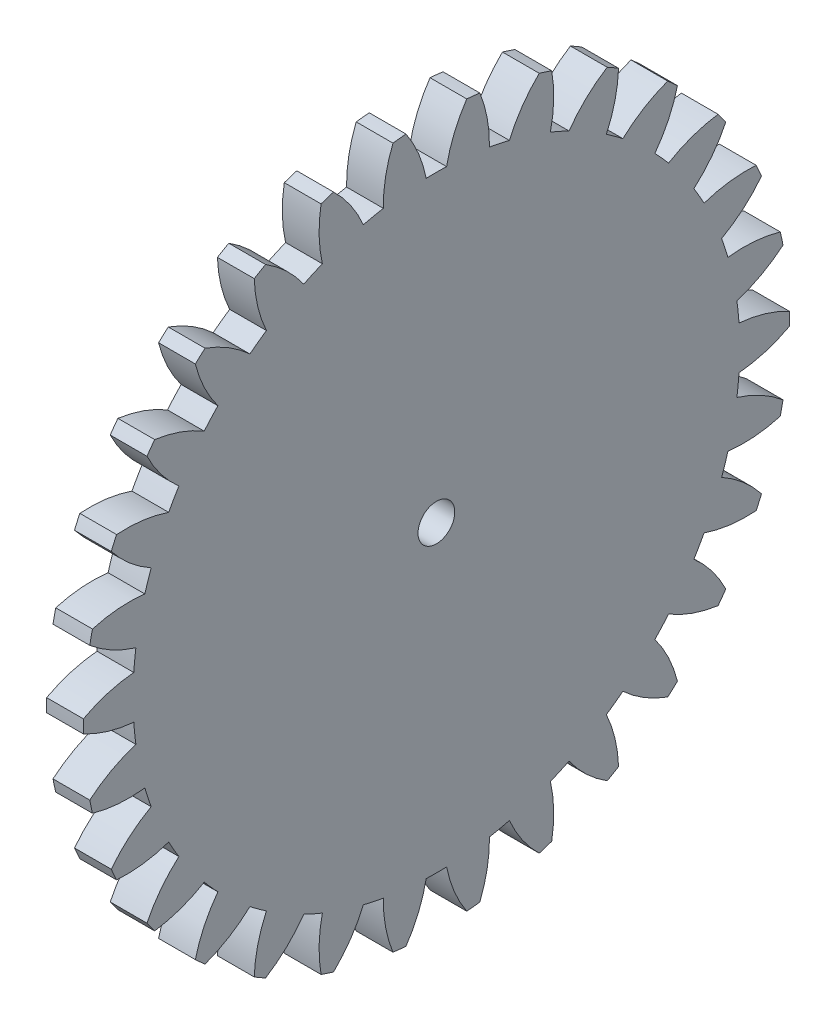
ISO-10303-21;
HEADER;
FILE_DESCRIPTION(('STEP AP214'),'2;1');
FILE_NAME('part.step','',(''),(''),'','','');
FILE_SCHEMA(('AUTOMOTIVE_DESIGN { 1 0 10303 214 1 1 1 1 }'));
ENDSEC;
DATA;
#1=APPLICATION_CONTEXT('core data for automotive mechanical design processes');
#2=APPLICATION_PROTOCOL_DEFINITION('international standard','automotive_design',2000,#1);
#3=PRODUCT_CONTEXT('',#1,'mechanical');
#4=PRODUCT('Part','Part','',(#3));
#5=PRODUCT_RELATED_PRODUCT_CATEGORY('part','',(#4));
#6=PRODUCT_DEFINITION_FORMATION('','',#4);
#7=PRODUCT_DEFINITION_CONTEXT('part definition',#1,'design');
#8=PRODUCT_DEFINITION('design','',#6,#7);
#9=PRODUCT_DEFINITION_SHAPE('','',#8);
#10=(LENGTH_UNIT() NAMED_UNIT(*) SI_UNIT(.MILLI.,.METRE.));
#11=(NAMED_UNIT(*) PLANE_ANGLE_UNIT() SI_UNIT($,.RADIAN.));
#12=(NAMED_UNIT(*) SI_UNIT($,.STERADIAN.) SOLID_ANGLE_UNIT());
#13=UNCERTAINTY_MEASURE_WITH_UNIT(LENGTH_MEASURE(1.E-05),#10,'distance_accuracy_value','');
#14=(GEOMETRIC_REPRESENTATION_CONTEXT(3) GLOBAL_UNCERTAINTY_ASSIGNED_CONTEXT((#13)) GLOBAL_UNIT_ASSIGNED_CONTEXT((#10,
#11,#12)) REPRESENTATION_CONTEXT('',''));
#15=CARTESIAN_POINT('',(0.,0.,0.));
#16=DIRECTION('',(0.,0.,1.));
#17=DIRECTION('',(1.,0.,0.));
#18=AXIS2_PLACEMENT_3D('',#15,#16,#17);
#19=CARTESIAN_POINT('',(5.,0.,0.));
#20=DIRECTION('',(-1.,0.,0.));
#21=DIRECTION('',(0.,0.,1.));
#22=AXIS2_PLACEMENT_3D('',#19,#20,#21);
#23=PLANE('',#22);
#24=CARTESIAN_POINT('',(5.,32.9663500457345,-26.4828201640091));
#25=DIRECTION('',(-1.,0.,0.));
#26=DIRECTION('',(0.,-0.207911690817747,-0.978147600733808));
#27=AXIS2_PLACEMENT_3D('',#24,#25,#26);
#28=CIRCLE('',#27,18.);
#29=CARTESIAN_POINT('',(5.,40.0360939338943,-9.92930931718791));
#30=VERTEX_POINT('',#29);
#31=CARTESIAN_POINT('',(5.,45.9181932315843,-13.9828298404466));
#32=VERTEX_POINT('',#31);
#33=EDGE_CURVE('E783',#30,#32,#28,.T.);
#34=ORIENTED_EDGE('',*,*,#33,.F.);
#35=CARTESIAN_POINT('',(5.,0.,0.));
#36=DIRECTION('',(-1.,0.,0.));
#37=DIRECTION('',(0.,-0.207911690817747,-0.978147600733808));
#38=AXIS2_PLACEMENT_3D('',#35,#36,#37);
#39=CIRCLE('',#38,41.249);
#40=CARTESIAN_POINT('',(5.,40.6134056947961,-7.21327102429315));
#41=VERTEX_POINT('',#40);
#42=EDGE_CURVE('E1446',#41,#30,#39,.T.);
#43=ORIENTED_EDGE('',*,*,#42,.F.);
#44=CARTESIAN_POINT('',(5.,40.8877927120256,10.7846375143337));
#45=DIRECTION('',(-1.,0.,0.));
#46=DIRECTION('',(0.,-0.207911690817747,-0.978147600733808));
#47=AXIS2_PLACEMENT_3D('',#44,#45,#46);
#48=CIRCLE('',#47,18.);
#49=CARTESIAN_POINT('',(5.,47.6356861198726,-5.90266108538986));
#50=VERTEX_POINT('',#49);
#51=EDGE_CURVE('E773',#50,#41,#48,.T.);
#52=ORIENTED_EDGE('',*,*,#51,.F.);
#53=CARTESIAN_POINT('',(5.,0.,0.));
#54=DIRECTION('',(-1.,0.,0.));
#55=DIRECTION('',(0.,0.,1.));
#56=AXIS2_PLACEMENT_3D('',#53,#54,#55);
#57=CIRCLE('',#56,48.);
#58=CARTESIAN_POINT('',(5.,47.8219643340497,-4.13034226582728));
#59=VERTEX_POINT('',#58);
#60=EDGE_CURVE('E801',#59,#50,#57,.T.);
#61=ORIENTED_EDGE('',*,*,#60,.F.);
#62=CARTESIAN_POINT('',(5.,37.7520441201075,-19.0500174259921));
#63=DIRECTION('',(-1.,0.,0.));
#64=DIRECTION('',(0.,0.,-1.));
#65=AXIS2_PLACEMENT_3D('',#62,#63,#64);
#66=CIRCLE('',#65,18.);
#67=CARTESIAN_POINT('',(5.,41.225628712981,-1.38835810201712));
#68=VERTEX_POINT('',#67);
#69=EDGE_CURVE('E825',#68,#59,#66,.T.);
#70=ORIENTED_EDGE('',*,*,#69,.F.);
#71=CARTESIAN_POINT('',(5.,0.,0.));
#72=DIRECTION('',(-1.,0.,0.));
#73=DIRECTION('',(0.,0.,-1.));
#74=AXIS2_PLACEMENT_3D('',#71,#72,#73);
#75=CIRCLE('',#74,41.249);
#76=CARTESIAN_POINT('',(5.,41.225628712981,1.38835810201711));
#77=VERTEX_POINT('',#76);
#78=EDGE_CURVE('E821',#77,#68,#75,.T.);
#79=ORIENTED_EDGE('',*,*,#78,.F.);
#80=CARTESIAN_POINT('',(5.,37.7520441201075,19.0500174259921));
#81=DIRECTION('',(-1.,0.,0.));
#82=DIRECTION('',(0.,0.,-1.));
#83=AXIS2_PLACEMENT_3D('',#80,#81,#82);
#84=CIRCLE('',#83,18.);
#85=CARTESIAN_POINT('',(5.,47.8219643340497,4.13034226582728));
#86=VERTEX_POINT('',#85);
#87=EDGE_CURVE('E823',#86,#77,#84,.T.);
#88=ORIENTED_EDGE('',*,*,#87,.F.);
#89=CARTESIAN_POINT('',(5.,47.6356861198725,5.90266108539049));
#90=VERTEX_POINT('',#89);
#91=EDGE_CURVE('E795',#90,#86,#57,.T.);
#92=ORIENTED_EDGE('',*,*,#91,.F.);
#93=CARTESIAN_POINT('',(5.,40.8877927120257,-10.7846375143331));
#94=DIRECTION('',(-1.,0.,0.));
#95=DIRECTION('',(0.,0.20791169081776,-0.978147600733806));
#96=AXIS2_PLACEMENT_3D('',#93,#94,#95);
#97=CIRCLE('',#96,18.);
#98=CARTESIAN_POINT('',(5.,40.613405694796,7.21327102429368));
#99=VERTEX_POINT('',#98);
#100=EDGE_CURVE('E844',#99,#90,#97,.T.);
#101=ORIENTED_EDGE('',*,*,#100,.F.);
#102=CARTESIAN_POINT('',(5.,0.,0.));
#103=DIRECTION('',(-1.,0.,0.));
#104=DIRECTION('',(0.,0.20791169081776,-0.978147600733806));
#105=AXIS2_PLACEMENT_3D('',#102,#103,#104);
#106=CIRCLE('',#105,41.249);
#107=CARTESIAN_POINT('',(5.,40.0360939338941,9.92930931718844));
#108=VERTEX_POINT('',#107);
#109=EDGE_CURVE('E840',#108,#99,#106,.T.);
#110=ORIENTED_EDGE('',*,*,#109,.F.);
#111=CARTESIAN_POINT('',(5.,32.9663500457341,26.4828201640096));
#112=DIRECTION('',(-1.,0.,0.));
#113=DIRECTION('',(0.,0.20791169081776,-0.978147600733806));
#114=AXIS2_PLACEMENT_3D('',#111,#112,#113);
#115=CIRCLE('',#114,18.);
#116=CARTESIAN_POINT('',(5.,45.9181932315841,13.9828298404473));
#117=VERTEX_POINT('',#116);
#118=EDGE_CURVE('E842',#117,#108,#115,.T.);
#119=ORIENTED_EDGE('',*,*,#118,.F.);
#120=CARTESIAN_POINT('',(5.,45.3674998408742,15.6776898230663));
#121=VERTEX_POINT('',#120);
#122=EDGE_CURVE('E799',#121,#117,#57,.T.);
#123=ORIENTED_EDGE('',*,*,#122,.F.);
#124=CARTESIAN_POINT('',(5.,42.2365485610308,-2.04791719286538));
#125=DIRECTION('',(-1.,0.,0.));
#126=DIRECTION('',(0.,0.406736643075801,-0.913545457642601));
#127=AXIS2_PLACEMENT_3D('',#124,#125,#126);
#128=CIRCLE('',#127,18.);
#129=CARTESIAN_POINT('',(5.,38.2261819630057,15.4996455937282));
#130=VERTEX_POINT('',#129);
#131=EDGE_CURVE('E865',#130,#121,#128,.T.);
#132=ORIENTED_EDGE('',*,*,#131,.F.);
#133=CARTESIAN_POINT('',(5.,0.,0.));
#134=DIRECTION('',(-1.,0.,0.));
#135=DIRECTION('',(0.,0.406736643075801,-0.913545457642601));
#136=AXIS2_PLACEMENT_3D('',#133,#134,#135);
#137=CIRCLE('',#136,41.249);
#138=CARTESIAN_POINT('',(5.,37.0967897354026,18.0363020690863));
#139=VERTEX_POINT('',#138);
#140=EDGE_CURVE('E861',#139,#130,#137,.T.);
#141=ORIENTED_EDGE('',*,*,#140,.F.);
#142=CARTESIAN_POINT('',(5.,26.7398682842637,32.7581965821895));
#143=DIRECTION('',(-1.,0.,0.));
#144=DIRECTION('',(0.,0.406736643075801,-0.913545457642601));
#145=AXIS2_PLACEMENT_3D('',#142,#143,#144);
#146=CIRCLE('',#145,18.);
#147=CARTESIAN_POINT('',(5.,42.0075767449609,23.2242006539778));
#148=VERTEX_POINT('',#147);
#149=EDGE_CURVE('E863',#148,#139,#146,.T.);
#150=ORIENTED_EDGE('',*,*,#149,.F.);
#151=CARTESIAN_POINT('',(5.,41.1165361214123,24.7675282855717));
#152=VERTEX_POINT('',#151);
#153=EDGE_CURVE('E1720',#152,#148,#57,.T.);
#154=ORIENTED_EDGE('',*,*,#153,.F.);
#155=CARTESIAN_POINT('',(5.,41.7393645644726,6.77830693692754));
#156=DIRECTION('',(-1.,0.,0.));
#157=DIRECTION('',(0.,0.587785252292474,-0.809016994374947));
#158=AXIS2_PLACEMENT_3D('',#155,#156,#157);
#159=CIRCLE('',#158,18.);
#160=CARTESIAN_POINT('',(5.,34.1682906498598,23.1086112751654));
#161=VERTEX_POINT('',#160);
#162=EDGE_CURVE('E887',#161,#152,#159,.T.);
#163=ORIENTED_EDGE('',*,*,#162,.F.);
#164=CARTESIAN_POINT('',(5.,0.,0.));
#165=DIRECTION('',(-1.,0.,0.));
#166=DIRECTION('',(0.,0.587785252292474,-0.809016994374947));
#167=AXIS2_PLACEMENT_3D('',#164,#165,#166);
#168=CIRCLE('',#167,41.249);
#169=CARTESIAN_POINT('',(5.,32.536177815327,25.3550218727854));
#170=VERTEX_POINT('',#169);
#171=EDGE_CURVE('E883',#170,#161,#168,.T.);
#172=ORIENTED_EDGE('',*,*,#171,.F.);
#173=CARTESIAN_POINT('',(5.,19.344725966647,37.6018826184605));
#174=DIRECTION('',(-1.,0.,0.));
#175=DIRECTION('',(0.,0.587785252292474,-0.809016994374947));
#176=AXIS2_PLACEMENT_3D('',#173,#174,#175);
#177=CIRCLE('',#176,18.);
#178=CARTESIAN_POINT('',(5.,36.2610275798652,31.4505624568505));
#179=VERTEX_POINT('',#178);
#180=EDGE_CURVE('E885',#179,#170,#177,.T.);
#181=ORIENTED_EDGE('',*,*,#180,.F.);
#182=CARTESIAN_POINT('',(5.,35.0685824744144,32.774906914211));
#183=VERTEX_POINT('',#182);
#184=EDGE_CURVE('E1715',#183,#179,#57,.T.);
#185=ORIENTED_EDGE('',*,*,#184,.F.);
#186=CARTESIAN_POINT('',(5.,39.4179700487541,15.3082865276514));
#187=DIRECTION('',(-1.,0.,0.));
#188=DIRECTION('',(0.,0.743144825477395,-0.669130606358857));
#189=AXIS2_PLACEMENT_3D('',#186,#187,#188);
#190=CIRCLE('',#189,18.);
#191=CARTESIAN_POINT('',(5.,28.6170810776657,29.7076197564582));
#192=VERTEX_POINT('',#191);
#193=EDGE_CURVE('E909',#192,#183,#190,.T.);
#194=ORIENTED_EDGE('',*,*,#193,.F.);
#195=CARTESIAN_POINT('',(5.,0.,0.));
#196=DIRECTION('',(-1.,0.,0.));
#197=DIRECTION('',(0.,0.743144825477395,-0.669130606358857));
#198=AXIS2_PLACEMENT_3D('',#195,#196,#197);
#199=CIRCLE('',#198,41.249);
#200=CARTESIAN_POINT('',(5.,26.5535787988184,31.5656055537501));
#201=VERTEX_POINT('',#200);
#202=EDGE_CURVE('E905',#201,#192,#199,.T.);
#203=ORIENTED_EDGE('',*,*,#202,.F.);
#204=CARTESIAN_POINT('',(5.,11.1041262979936,40.8021859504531));
#205=DIRECTION('',(-1.,0.,0.));
#206=DIRECTION('',(0.,0.743144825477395,-0.669130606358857));
#207=AXIS2_PLACEMENT_3D('',#204,#205,#206);
#208=CIRCLE('',#207,18.);
#209=CARTESIAN_POINT('',(5.,28.9296975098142,38.3023837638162));
#210=VERTEX_POINT('',#209);
#211=EDGE_CURVE('E907',#210,#201,#208,.T.);
#212=ORIENTED_EDGE('',*,*,#211,.F.);
#213=CARTESIAN_POINT('',(5.,27.4879634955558,39.3498648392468));
#214=VERTEX_POINT('',#213);
#215=EDGE_CURVE('E1710',#214,#210,#57,.T.);
#216=ORIENTED_EDGE('',*,*,#215,.F.);
#217=CARTESIAN_POINT('',(5.,35.3738210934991,23.1692205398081));
#218=DIRECTION('',(-1.,0.,0.));
#219=DIRECTION('',(0.,0.86602540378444,-0.499999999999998));
#220=AXIS2_PLACEMENT_3D('',#217,#218,#219);
#221=CIRCLE('',#220,18.);
#222=CARTESIAN_POINT('',(5.,21.8151677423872,35.0082627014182));
#223=VERTEX_POINT('',#222);
#224=EDGE_CURVE('E931',#223,#214,#221,.T.);
#225=ORIENTED_EDGE('',*,*,#224,.F.);
#226=CARTESIAN_POINT('',(5.,0.,0.));
#227=DIRECTION('',(-1.,0.,0.));
#228=DIRECTION('',(0.,0.86602540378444,-0.499999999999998));
#229=AXIS2_PLACEMENT_3D('',#226,#227,#228);
#230=CIRCLE('',#229,41.249);
#231=CARTESIAN_POINT('',(5.,19.4104609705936,36.3966208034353));
#232=VERTEX_POINT('',#231);
#233=EDGE_CURVE('E927',#232,#223,#230,.T.);
#234=ORIENTED_EDGE('',*,*,#233,.F.);
#235=CARTESIAN_POINT('',(5.,2.37822302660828,42.2192379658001));
#236=DIRECTION('',(-1.,0.,0.));
#237=DIRECTION('',(0.,0.86602540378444,-0.499999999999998));
#238=AXIS2_PLACEMENT_3D('',#235,#236,#237);
#239=CIRCLE('',#238,18.);
#240=CARTESIAN_POINT('',(5.,20.3340008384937,43.4802071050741));
#241=VERTEX_POINT('',#240);
#242=EDGE_CURVE('E929',#241,#232,#239,.T.);
#243=ORIENTED_EDGE('',*,*,#242,.F.);
#244=CARTESIAN_POINT('',(5.,18.7059886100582,44.2050448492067));
#245=VERTEX_POINT('',#244);
#246=EDGE_CURVE('E1705',#245,#241,#57,.T.);
#247=ORIENTED_EDGE('',*,*,#246,.F.);
#248=CARTESIAN_POINT('',(5.,29.783666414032,30.01754843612));
#249=DIRECTION('',(-1.,0.,0.));
#250=DIRECTION('',(0.,0.951056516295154,-0.309016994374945));
#251=AXIS2_PLACEMENT_3D('',#248,#249,#250);
#252=CIRCLE('',#251,18.);
#253=CARTESIAN_POINT('',(5.,14.0598268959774,38.7788765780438));
#254=VERTEX_POINT('',#253);
#255=EDGE_CURVE('E953',#254,#245,#252,.T.);
#256=ORIENTED_EDGE('',*,*,#255,.F.);
#257=CARTESIAN_POINT('',(5.,0.,0.));
#258=DIRECTION('',(-1.,0.,0.));
#259=DIRECTION('',(0.,0.951056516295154,-0.309016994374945));
#260=AXIS2_PLACEMENT_3D('',#257,#258,#259);
#261=CIRCLE('',#260,41.249);
#262=CARTESIAN_POINT('',(5.,11.4190128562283,39.6369290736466));
#263=VERTEX_POINT('',#262);
#264=EDGE_CURVE('E949',#263,#254,#261,.T.);
#265=ORIENTED_EDGE('',*,*,#264,.F.);
#266=CARTESIAN_POINT('',(5.,-6.45162000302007,41.7911066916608));
#267=DIRECTION('',(-1.,0.,0.));
#268=DIRECTION('',(0.,0.951056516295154,-0.309016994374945));
#269=AXIS2_PLACEMENT_3D('',#266,#267,#268);
#270=CIRCLE('',#269,18.);
#271=CARTESIAN_POINT('',(5.,10.8496107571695,46.7577367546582));
#272=VERTEX_POINT('',#271);
#273=EDGE_CURVE('E951',#272,#263,#270,.T.);
#274=ORIENTED_EDGE('',*,*,#273,.F.);
#275=CARTESIAN_POINT('',(5.,9.10647226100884,47.1282522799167));
#276=VERTEX_POINT('',#275);
#277=EDGE_CURVE('E1700',#276,#272,#57,.T.);
#278=ORIENTED_EDGE('',*,*,#277,.F.);
#279=CARTESIAN_POINT('',(5.,22.8918225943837,35.5539654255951));
#280=DIRECTION('',(-1.,0.,0.));
#281=DIRECTION('',(0.,0.994521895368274,-0.10452846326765));
#282=AXIS2_PLACEMENT_3D('',#279,#280,#281);
#283=CIRCLE('',#282,18.);
#284=CARTESIAN_POINT('',(5.,5.69000414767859,40.8546674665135));
#285=VERTEX_POINT('',#284);
#286=EDGE_CURVE('E975',#285,#276,#283,.T.);
#287=ORIENTED_EDGE('',*,*,#286,.F.);
#288=CARTESIAN_POINT('',(5.,0.,0.));
#289=DIRECTION('',(-1.,0.,0.));
#290=DIRECTION('',(0.,0.994521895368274,-0.10452846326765));
#291=AXIS2_PLACEMENT_3D('',#288,#289,#290);
#292=CIRCLE('',#291,41.249);
#293=CARTESIAN_POINT('',(5.,2.92849908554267,41.1449133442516));
#294=VERTEX_POINT('',#293);
#295=EDGE_CURVE('E971',#294,#285,#292,.T.);
#296=ORIENTED_EDGE('',*,*,#295,.F.);
#297=CARTESIAN_POINT('',(5.,-14.9994962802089,39.5365035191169));
#298=DIRECTION('',(-1.,0.,0.));
#299=DIRECTION('',(0.,0.994521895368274,-0.10452846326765));
#300=AXIS2_PLACEMENT_3D('',#297,#298,#299);
#301=CIRCLE('',#300,18.);
#302=CARTESIAN_POINT('',(5.,0.891040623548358,47.9917289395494));
#303=VERTEX_POINT('',#302);
#304=EDGE_CURVE('E973',#303,#294,#301,.T.);
#305=ORIENTED_EDGE('',*,*,#304,.F.);
#306=CARTESIAN_POINT('',(5.,-0.891040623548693,47.9917289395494));
#307=VERTEX_POINT('',#306);
#308=EDGE_CURVE('E1695',#307,#303,#57,.T.);
#309=ORIENTED_EDGE('',*,*,#308,.F.);
#310=CARTESIAN_POINT('',(5.,14.9994962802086,39.536503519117));
#311=DIRECTION('',(-1.,0.,0.));
#312=DIRECTION('',(0.,0.994521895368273,0.104528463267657));
#313=AXIS2_PLACEMENT_3D('',#310,#311,#312);
#314=CIRCLE('',#313,18.);
#315=CARTESIAN_POINT('',(5.,-2.92849908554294,41.1449133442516));
#316=VERTEX_POINT('',#315);
#317=EDGE_CURVE('E997',#316,#307,#314,.T.);
#318=ORIENTED_EDGE('',*,*,#317,.F.);
#319=CARTESIAN_POINT('',(5.,0.,0.));
#320=DIRECTION('',(-1.,0.,0.));
#321=DIRECTION('',(0.,0.994521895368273,0.104528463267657));
#322=AXIS2_PLACEMENT_3D('',#319,#320,#321);
#323=CIRCLE('',#322,41.249);
#324=CARTESIAN_POINT('',(5.,-5.69000414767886,40.8546674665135));
#325=VERTEX_POINT('',#324);
#326=EDGE_CURVE('E993',#325,#316,#323,.T.);
#327=ORIENTED_EDGE('',*,*,#326,.F.);
#328=CARTESIAN_POINT('',(5.,-22.8918225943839,35.553965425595));
#329=DIRECTION('',(-1.,0.,0.));
#330=DIRECTION('',(0.,0.994521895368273,0.104528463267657));
#331=AXIS2_PLACEMENT_3D('',#328,#329,#330);
#332=CIRCLE('',#331,18.);
#333=CARTESIAN_POINT('',(5.,-9.10647226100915,47.1282522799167));
#334=VERTEX_POINT('',#333);
#335=EDGE_CURVE('E995',#334,#325,#332,.T.);
#336=ORIENTED_EDGE('',*,*,#335,.F.);
#337=CARTESIAN_POINT('',(5.,-10.8496107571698,46.7577367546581));
#338=VERTEX_POINT('',#337);
#339=EDGE_CURVE('E1690',#338,#334,#57,.T.);
#340=ORIENTED_EDGE('',*,*,#339,.F.);
#341=CARTESIAN_POINT('',(5.,6.45162000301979,41.7911066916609));
#342=DIRECTION('',(-1.,0.,0.));
#343=DIRECTION('',(0.,0.951056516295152,0.309016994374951));
#344=AXIS2_PLACEMENT_3D('',#341,#342,#343);
#345=CIRCLE('',#344,18.);
#346=CARTESIAN_POINT('',(5.,-11.4190128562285,39.6369290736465));
#347=VERTEX_POINT('',#346);
#348=EDGE_CURVE('E1019',#347,#338,#345,.T.);
#349=ORIENTED_EDGE('',*,*,#348,.F.);
#350=CARTESIAN_POINT('',(5.,0.,0.));
#351=DIRECTION('',(-1.,0.,0.));
#352=DIRECTION('',(0.,0.951056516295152,0.309016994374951));
#353=AXIS2_PLACEMENT_3D('',#350,#351,#352);
#354=CIRCLE('',#353,41.249);
#355=CARTESIAN_POINT('',(5.,-14.0598268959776,38.7788765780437));
#356=VERTEX_POINT('',#355);
#357=EDGE_CURVE('E1015',#356,#347,#354,.T.);
#358=ORIENTED_EDGE('',*,*,#357,.F.);
#359=CARTESIAN_POINT('',(5.,-29.7836664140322,30.0175484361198));
#360=DIRECTION('',(-1.,0.,0.));
#361=DIRECTION('',(0.,0.951056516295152,0.309016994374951));
#362=AXIS2_PLACEMENT_3D('',#359,#360,#361);
#363=CIRCLE('',#362,18.);
#364=CARTESIAN_POINT('',(5.,-18.7059886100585,44.2050448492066));
#365=VERTEX_POINT('',#364);
#366=EDGE_CURVE('E1017',#365,#356,#363,.T.);
#367=ORIENTED_EDGE('',*,*,#366,.F.);
#368=CARTESIAN_POINT('',(5.,-20.334000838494,43.480207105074));
#369=VERTEX_POINT('',#368);
#370=EDGE_CURVE('E1685',#369,#365,#57,.T.);
#371=ORIENTED_EDGE('',*,*,#370,.F.);
#372=CARTESIAN_POINT('',(5.,-2.37822302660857,42.2192379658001));
#373=DIRECTION('',(-1.,0.,0.));
#374=DIRECTION('',(0.,0.866025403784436,0.500000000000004));
#375=AXIS2_PLACEMENT_3D('',#372,#373,#374);
#376=CIRCLE('',#375,18.);
#377=CARTESIAN_POINT('',(5.,-19.4104609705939,36.3966208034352));
#378=VERTEX_POINT('',#377);
#379=EDGE_CURVE('E1041',#378,#369,#376,.T.);
#380=ORIENTED_EDGE('',*,*,#379,.F.);
#381=CARTESIAN_POINT('',(5.,0.,0.));
#382=DIRECTION('',(-1.,0.,0.));
#383=DIRECTION('',(0.,0.866025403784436,0.500000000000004));
#384=AXIS2_PLACEMENT_3D('',#381,#382,#383);
#385=CIRCLE('',#384,41.249);
#386=CARTESIAN_POINT('',(5.,-21.8151677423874,35.0082627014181));
#387=VERTEX_POINT('',#386);
#388=EDGE_CURVE('E1037',#387,#378,#385,.T.);
#389=ORIENTED_EDGE('',*,*,#388,.F.);
#390=CARTESIAN_POINT('',(5.,-35.3738210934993,23.1692205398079));
#391=DIRECTION('',(-1.,0.,0.));
#392=DIRECTION('',(0.,0.866025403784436,0.500000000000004));
#393=AXIS2_PLACEMENT_3D('',#390,#391,#392);
#394=CIRCLE('',#393,18.);
#395=CARTESIAN_POINT('',(5.,-27.487963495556,39.3498648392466));
#396=VERTEX_POINT('',#395);
#397=EDGE_CURVE('E1039',#396,#387,#394,.T.);
#398=ORIENTED_EDGE('',*,*,#397,.F.);
#399=CARTESIAN_POINT('',(5.,-28.9296975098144,38.302383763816));
#400=VERTEX_POINT('',#399);
#401=EDGE_CURVE('E1680',#400,#396,#57,.T.);
#402=ORIENTED_EDGE('',*,*,#401,.F.);
#403=CARTESIAN_POINT('',(5.,-11.1041262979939,40.802185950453));
#404=DIRECTION('',(-1.,0.,0.));
#405=DIRECTION('',(0.,0.743144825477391,0.669130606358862));
#406=AXIS2_PLACEMENT_3D('',#403,#404,#405);
#407=CIRCLE('',#406,18.);
#408=CARTESIAN_POINT('',(5.,-26.5535787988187,31.5656055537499));
#409=VERTEX_POINT('',#408);
#410=EDGE_CURVE('E1063',#409,#400,#407,.T.);
#411=ORIENTED_EDGE('',*,*,#410,.F.);
#412=CARTESIAN_POINT('',(5.,0.,0.));
#413=DIRECTION('',(-1.,0.,0.));
#414=DIRECTION('',(0.,0.743144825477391,0.669130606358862));
#415=AXIS2_PLACEMENT_3D('',#412,#413,#414);
#416=CIRCLE('',#415,41.249);
#417=CARTESIAN_POINT('',(5.,-28.6170810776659,29.707619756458));
#418=VERTEX_POINT('',#417);
#419=EDGE_CURVE('E1059',#418,#409,#416,.T.);
#420=ORIENTED_EDGE('',*,*,#419,.F.);
#421=CARTESIAN_POINT('',(5.,-39.4179700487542,15.3082865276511));
#422=DIRECTION('',(-1.,0.,0.));
#423=DIRECTION('',(0.,0.743144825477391,0.669130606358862));
#424=AXIS2_PLACEMENT_3D('',#421,#422,#423);
#425=CIRCLE('',#424,18.);
#426=CARTESIAN_POINT('',(5.,-35.0685824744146,32.7749069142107));
#427=VERTEX_POINT('',#426);
#428=EDGE_CURVE('E1061',#427,#418,#425,.T.);
#429=ORIENTED_EDGE('',*,*,#428,.F.);
#430=CARTESIAN_POINT('',(5.,-36.2610275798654,31.4505624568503));
#431=VERTEX_POINT('',#430);
#432=EDGE_CURVE('E1675',#431,#427,#57,.T.);
#433=ORIENTED_EDGE('',*,*,#432,.F.);
#434=CARTESIAN_POINT('',(5.,-19.3447259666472,37.6018826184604));
#435=DIRECTION('',(-1.,0.,0.));
#436=DIRECTION('',(0.,0.587785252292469,0.80901699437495));
#437=AXIS2_PLACEMENT_3D('',#434,#435,#436);
#438=CIRCLE('',#437,18.);
#439=CARTESIAN_POINT('',(5.,-32.5361778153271,25.3550218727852));
#440=VERTEX_POINT('',#439);
#441=EDGE_CURVE('E1085',#440,#431,#438,.T.);
#442=ORIENTED_EDGE('',*,*,#441,.F.);
#443=CARTESIAN_POINT('',(5.,0.,0.));
#444=DIRECTION('',(-1.,0.,0.));
#445=DIRECTION('',(0.,0.587785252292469,0.80901699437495));
#446=AXIS2_PLACEMENT_3D('',#443,#444,#445);
#447=CIRCLE('',#446,41.249);
#448=CARTESIAN_POINT('',(5.,-34.16829064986,23.1086112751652));
#449=VERTEX_POINT('',#448);
#450=EDGE_CURVE('E1081',#449,#440,#447,.T.);
#451=ORIENTED_EDGE('',*,*,#450,.F.);
#452=CARTESIAN_POINT('',(5.,-41.7393645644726,6.77830693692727));
#453=DIRECTION('',(-1.,0.,0.));
#454=DIRECTION('',(0.,0.587785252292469,0.80901699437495));
#455=AXIS2_PLACEMENT_3D('',#452,#453,#454);
#456=CIRCLE('',#455,18.);
#457=CARTESIAN_POINT('',(5.,-41.1165361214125,24.7675282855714));
#458=VERTEX_POINT('',#457);
#459=EDGE_CURVE('E1083',#458,#449,#456,.T.);
#460=ORIENTED_EDGE('',*,*,#459,.F.);
#461=CARTESIAN_POINT('',(5.,-42.007576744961,23.2242006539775));
#462=VERTEX_POINT('',#461);
#463=EDGE_CURVE('E1670',#462,#458,#57,.T.);
#464=ORIENTED_EDGE('',*,*,#463,.F.);
#465=CARTESIAN_POINT('',(5.,-26.739868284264,32.7581965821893));
#466=DIRECTION('',(-1.,0.,0.));
#467=DIRECTION('',(0.,0.406736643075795,0.913545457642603));
#468=AXIS2_PLACEMENT_3D('',#465,#466,#467);
#469=CIRCLE('',#468,18.);
#470=CARTESIAN_POINT('',(5.,-37.0967897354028,18.036302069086));
#471=VERTEX_POINT('',#470);
#472=EDGE_CURVE('E1107',#471,#462,#469,.T.);
#473=ORIENTED_EDGE('',*,*,#472,.F.);
#474=CARTESIAN_POINT('',(5.,0.,0.));
#475=DIRECTION('',(-1.,0.,0.));
#476=DIRECTION('',(0.,0.406736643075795,0.913545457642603));
#477=AXIS2_PLACEMENT_3D('',#474,#475,#476);
#478=CIRCLE('',#477,41.249);
#479=CARTESIAN_POINT('',(5.,-38.2261819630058,15.4996455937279));
#480=VERTEX_POINT('',#479);
#481=EDGE_CURVE('E1103',#480,#471,#478,.T.);
#482=ORIENTED_EDGE('',*,*,#481,.F.);
#483=CARTESIAN_POINT('',(5.,-42.2365485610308,-2.04791719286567));
#484=DIRECTION('',(-1.,0.,0.));
#485=DIRECTION('',(0.,0.406736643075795,0.913545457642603));
#486=AXIS2_PLACEMENT_3D('',#483,#484,#485);
#487=CIRCLE('',#486,18.);
#488=CARTESIAN_POINT('',(5.,-45.3674998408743,15.677689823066));
#489=VERTEX_POINT('',#488);
#490=EDGE_CURVE('E1105',#489,#480,#487,.T.);
#491=ORIENTED_EDGE('',*,*,#490,.F.);
#492=CARTESIAN_POINT('',(5.,-45.9181932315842,13.9828298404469));
#493=VERTEX_POINT('',#492);
#494=EDGE_CURVE('E1665',#493,#489,#57,.T.);
#495=ORIENTED_EDGE('',*,*,#494,.F.);
#496=CARTESIAN_POINT('',(5.,-32.9663500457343,26.4828201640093));
#497=DIRECTION('',(-1.,0.,0.));
#498=DIRECTION('',(0.,0.207911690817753,0.978147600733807));
#499=AXIS2_PLACEMENT_3D('',#496,#497,#498);
#500=CIRCLE('',#499,18.);
#501=CARTESIAN_POINT('',(5.,-40.0360939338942,9.92930931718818));
#502=VERTEX_POINT('',#501);
#503=EDGE_CURVE('E1129',#502,#493,#500,.T.);
#504=ORIENTED_EDGE('',*,*,#503,.F.);
#505=CARTESIAN_POINT('',(5.,0.,0.));
#506=DIRECTION('',(-1.,0.,0.));
#507=DIRECTION('',(0.,0.207911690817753,0.978147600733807));
#508=AXIS2_PLACEMENT_3D('',#505,#506,#507);
#509=CIRCLE('',#508,41.249);
#510=CARTESIAN_POINT('',(5.,-40.613405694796,7.21327102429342));
#511=VERTEX_POINT('',#510);
#512=EDGE_CURVE('E1125',#511,#502,#509,.T.);
#513=ORIENTED_EDGE('',*,*,#512,.F.);
#514=CARTESIAN_POINT('',(5.,-40.8877927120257,-10.7846375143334));
#515=DIRECTION('',(-1.,0.,0.));
#516=DIRECTION('',(0.,0.207911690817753,0.978147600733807));
#517=AXIS2_PLACEMENT_3D('',#514,#515,#516);
#518=CIRCLE('',#517,18.);
#519=CARTESIAN_POINT('',(5.,-47.6356861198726,5.90266108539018));
#520=VERTEX_POINT('',#519);
#521=EDGE_CURVE('E1127',#520,#511,#518,.T.);
#522=ORIENTED_EDGE('',*,*,#521,.F.);
#523=CARTESIAN_POINT('',(5.,-47.8219643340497,4.13034226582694));
#524=VERTEX_POINT('',#523);
#525=EDGE_CURVE('E1660',#524,#520,#57,.T.);
#526=ORIENTED_EDGE('',*,*,#525,.F.);
#527=CARTESIAN_POINT('',(5.,-37.7520441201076,19.0500174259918));
#528=DIRECTION('',(-1.,0.,0.));
#529=DIRECTION('',(0.,0.,1.));
#530=AXIS2_PLACEMENT_3D('',#527,#528,#529);
#531=CIRCLE('',#530,18.);
#532=CARTESIAN_POINT('',(5.,-41.225628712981,1.38835810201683));
#533=VERTEX_POINT('',#532);
#534=EDGE_CURVE('E1151',#533,#524,#531,.T.);
#535=ORIENTED_EDGE('',*,*,#534,.F.);
#536=CARTESIAN_POINT('',(5.,0.,0.));
#537=DIRECTION('',(-1.,0.,0.));
#538=DIRECTION('',(0.,0.,1.));
#539=AXIS2_PLACEMENT_3D('',#536,#537,#538);
#540=CIRCLE('',#539,41.249);
#541=CARTESIAN_POINT('',(5.,-41.225628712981,-1.3883581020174));
#542=VERTEX_POINT('',#541);
#543=EDGE_CURVE('E1147',#542,#533,#540,.T.);
#544=ORIENTED_EDGE('',*,*,#543,.F.);
#545=CARTESIAN_POINT('',(5.,-37.7520441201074,-19.0500174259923));
#546=DIRECTION('',(-1.,0.,0.));
#547=DIRECTION('',(0.,0.,1.));
#548=AXIS2_PLACEMENT_3D('',#545,#546,#547);
#549=CIRCLE('',#548,18.);
#550=CARTESIAN_POINT('',(5.,-47.8219643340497,-4.13034226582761));
#551=VERTEX_POINT('',#550);
#552=EDGE_CURVE('E1149',#551,#542,#549,.T.);
#553=ORIENTED_EDGE('',*,*,#552,.F.);
#554=CARTESIAN_POINT('',(5.,-47.6356861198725,-5.90266108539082));
#555=VERTEX_POINT('',#554);
#556=EDGE_CURVE('E1655',#555,#551,#57,.T.);
#557=ORIENTED_EDGE('',*,*,#556,.F.);
#558=CARTESIAN_POINT('',(5.,-40.8877927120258,10.7846375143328));
#559=DIRECTION('',(-1.,0.,0.));
#560=DIRECTION('',(0.,-0.207911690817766,0.978147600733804));
#561=AXIS2_PLACEMENT_3D('',#558,#559,#560);
#562=CIRCLE('',#561,18.);
#563=CARTESIAN_POINT('',(5.,-40.6134056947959,-7.21327102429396));
#564=VERTEX_POINT('',#563);
#565=EDGE_CURVE('E1173',#564,#555,#562,.T.);
#566=ORIENTED_EDGE('',*,*,#565,.F.);
#567=CARTESIAN_POINT('',(5.,0.,0.));
#568=DIRECTION('',(-1.,0.,0.));
#569=DIRECTION('',(0.,-0.207911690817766,0.978147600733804));
#570=AXIS2_PLACEMENT_3D('',#567,#568,#569);
#571=CIRCLE('',#570,41.249);
#572=CARTESIAN_POINT('',(5.,-40.0360939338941,-9.92930931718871));
#573=VERTEX_POINT('',#572);
#574=EDGE_CURVE('E1169',#573,#564,#571,.T.);
#575=ORIENTED_EDGE('',*,*,#574,.F.);
#576=CARTESIAN_POINT('',(5.,-32.966350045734,-26.4828201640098));
#577=DIRECTION('',(-1.,0.,0.));
#578=DIRECTION('',(0.,-0.207911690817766,0.978147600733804));
#579=AXIS2_PLACEMENT_3D('',#576,#577,#578);
#580=CIRCLE('',#579,18.);
#581=CARTESIAN_POINT('',(5.,-45.918193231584,-13.9828298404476));
#582=VERTEX_POINT('',#581);
#583=EDGE_CURVE('E1171',#582,#573,#580,.T.);
#584=ORIENTED_EDGE('',*,*,#583,.F.);
#585=CARTESIAN_POINT('',(5.,-45.3674998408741,-15.6776898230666));
#586=VERTEX_POINT('',#585);
#587=EDGE_CURVE('E1650',#586,#582,#57,.T.);
#588=ORIENTED_EDGE('',*,*,#587,.F.);
#589=CARTESIAN_POINT('',(5.,-42.2365485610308,2.04791719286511));
#590=DIRECTION('',(-1.,0.,0.));
#591=DIRECTION('',(0.,-0.406736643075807,0.913545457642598));
#592=AXIS2_PLACEMENT_3D('',#589,#590,#591);
#593=CIRCLE('',#592,18.);
#594=CARTESIAN_POINT('',(5.,-38.2261819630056,-15.4996455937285));
#595=VERTEX_POINT('',#594);
#596=EDGE_CURVE('E1195',#595,#586,#593,.T.);
#597=ORIENTED_EDGE('',*,*,#596,.F.);
#598=CARTESIAN_POINT('',(5.,0.,0.));
#599=DIRECTION('',(-1.,0.,0.));
#600=DIRECTION('',(0.,-0.406736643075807,0.913545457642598));
#601=AXIS2_PLACEMENT_3D('',#598,#599,#600);
#602=CIRCLE('',#601,41.249);
#603=CARTESIAN_POINT('',(5.,-37.0967897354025,-18.0363020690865));
#604=VERTEX_POINT('',#603);
#605=EDGE_CURVE('E1191',#604,#595,#602,.T.);
#606=ORIENTED_EDGE('',*,*,#605,.F.);
#607=CARTESIAN_POINT('',(5.,-26.7398682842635,-32.7581965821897));
#608=DIRECTION('',(-1.,0.,0.));
#609=DIRECTION('',(0.,-0.406736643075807,0.913545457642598));
#610=AXIS2_PLACEMENT_3D('',#607,#608,#609);
#611=CIRCLE('',#610,18.);
#612=CARTESIAN_POINT('',(5.,-42.0075767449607,-23.2242006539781));
#613=VERTEX_POINT('',#612);
#614=EDGE_CURVE('E1193',#613,#604,#611,.T.);
#615=ORIENTED_EDGE('',*,*,#614,.F.);
#616=CARTESIAN_POINT('',(5.,-41.1165361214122,-24.767528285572));
#617=VERTEX_POINT('',#616);
#618=EDGE_CURVE('E1645',#617,#613,#57,.T.);
#619=ORIENTED_EDGE('',*,*,#618,.F.);
#620=CARTESIAN_POINT('',(5.,-41.7393645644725,-6.77830693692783));
#621=DIRECTION('',(-1.,0.,0.));
#622=DIRECTION('',(0.,-0.58778525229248,0.809016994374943));
#623=AXIS2_PLACEMENT_3D('',#620,#621,#622);
#624=CIRCLE('',#623,18.);
#625=CARTESIAN_POINT('',(5.,-34.1682906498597,-23.1086112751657));
#626=VERTEX_POINT('',#625);
#627=EDGE_CURVE('E1217',#626,#617,#624,.T.);
#628=ORIENTED_EDGE('',*,*,#627,.F.);
#629=CARTESIAN_POINT('',(5.,0.,0.));
#630=DIRECTION('',(-1.,0.,0.));
#631=DIRECTION('',(0.,-0.58778525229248,0.809016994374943));
#632=AXIS2_PLACEMENT_3D('',#629,#630,#631);
#633=CIRCLE('',#632,41.249);
#634=CARTESIAN_POINT('',(5.,-32.5361778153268,-25.3550218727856));
#635=VERTEX_POINT('',#634);
#636=EDGE_CURVE('E1213',#635,#626,#633,.T.);
#637=ORIENTED_EDGE('',*,*,#636,.F.);
#638=CARTESIAN_POINT('',(5.,-19.3447259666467,-37.6018826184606));
#639=DIRECTION('',(-1.,0.,0.));
#640=DIRECTION('',(0.,-0.58778525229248,0.809016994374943));
#641=AXIS2_PLACEMENT_3D('',#638,#639,#640);
#642=CIRCLE('',#641,18.);
#643=CARTESIAN_POINT('',(5.,-36.261027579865,-31.4505624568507));
#644=VERTEX_POINT('',#643);
#645=EDGE_CURVE('E1215',#644,#635,#642,.T.);
#646=ORIENTED_EDGE('',*,*,#645,.F.);
#647=CARTESIAN_POINT('',(5.,-35.0685824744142,-32.7749069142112));
#648=VERTEX_POINT('',#647);
#649=EDGE_CURVE('E1640',#648,#644,#57,.T.);
#650=ORIENTED_EDGE('',*,*,#649,.F.);
#651=CARTESIAN_POINT('',(5.,-39.417970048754,-15.3082865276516));
#652=DIRECTION('',(-1.,0.,0.));
#653=DIRECTION('',(0.,-0.7431448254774,0.669130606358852));
#654=AXIS2_PLACEMENT_3D('',#651,#652,#653);
#655=CIRCLE('',#654,18.);
#656=CARTESIAN_POINT('',(5.,-28.6170810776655,-29.7076197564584));
#657=VERTEX_POINT('',#656);
#658=EDGE_CURVE('E1239',#657,#648,#655,.T.);
#659=ORIENTED_EDGE('',*,*,#658,.F.);
#660=CARTESIAN_POINT('',(5.,0.,0.));
#661=DIRECTION('',(-1.,0.,0.));
#662=DIRECTION('',(0.,-0.7431448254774,0.669130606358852));
#663=AXIS2_PLACEMENT_3D('',#660,#661,#662);
#664=CIRCLE('',#663,41.249);
#665=CARTESIAN_POINT('',(5.,-26.5535787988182,-31.5656055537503));
#666=VERTEX_POINT('',#665);
#667=EDGE_CURVE('E1235',#666,#657,#664,.T.);
#668=ORIENTED_EDGE('',*,*,#667,.F.);
#669=CARTESIAN_POINT('',(5.,-11.1041262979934,-40.8021859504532));
#670=DIRECTION('',(-1.,0.,0.));
#671=DIRECTION('',(0.,-0.7431448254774,0.669130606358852));
#672=AXIS2_PLACEMENT_3D('',#669,#670,#671);
#673=CIRCLE('',#672,18.);
#674=CARTESIAN_POINT('',(5.,-28.9296975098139,-38.3023837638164));
#675=VERTEX_POINT('',#674);
#676=EDGE_CURVE('E1237',#675,#666,#673,.T.);
#677=ORIENTED_EDGE('',*,*,#676,.F.);
#678=CARTESIAN_POINT('',(5.,-27.4879634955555,-39.349864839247));
#679=VERTEX_POINT('',#678);
#680=EDGE_CURVE('E1635',#679,#675,#57,.T.);
#681=ORIENTED_EDGE('',*,*,#680,.F.);
#682=CARTESIAN_POINT('',(5.,-35.3738210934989,-23.1692205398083));
#683=DIRECTION('',(-1.,0.,0.));
#684=DIRECTION('',(0.,-0.866025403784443,0.499999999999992));
#685=AXIS2_PLACEMENT_3D('',#682,#683,#684);
#686=CIRCLE('',#685,18.);
#687=CARTESIAN_POINT('',(5.,-21.8151677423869,-35.0082627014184));
#688=VERTEX_POINT('',#687);
#689=EDGE_CURVE('E1261',#688,#679,#686,.T.);
#690=ORIENTED_EDGE('',*,*,#689,.F.);
#691=CARTESIAN_POINT('',(5.,0.,0.));
#692=DIRECTION('',(-1.,0.,0.));
#693=DIRECTION('',(0.,-0.866025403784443,0.499999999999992));
#694=AXIS2_PLACEMENT_3D('',#691,#692,#693);
#695=CIRCLE('',#694,41.249);
#696=CARTESIAN_POINT('',(5.,-19.4104609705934,-36.3966208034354));
#697=VERTEX_POINT('',#696);
#698=EDGE_CURVE('E1257',#697,#688,#695,.T.);
#699=ORIENTED_EDGE('',*,*,#698,.F.);
#700=CARTESIAN_POINT('',(5.,-2.37822302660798,-42.2192379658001));
#701=DIRECTION('',(-1.,0.,0.));
#702=DIRECTION('',(0.,-0.866025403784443,0.499999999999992));
#703=AXIS2_PLACEMENT_3D('',#700,#701,#702);
#704=CIRCLE('',#703,18.);
#705=CARTESIAN_POINT('',(5.,-20.3340008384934,-43.4802071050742));
#706=VERTEX_POINT('',#705);
#707=EDGE_CURVE('E1259',#706,#697,#704,.T.);
#708=ORIENTED_EDGE('',*,*,#707,.F.);
#709=CARTESIAN_POINT('',(5.,-18.7059886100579,-44.2050448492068));
#710=VERTEX_POINT('',#709);
#711=EDGE_CURVE('E1630',#710,#706,#57,.T.);
#712=ORIENTED_EDGE('',*,*,#711,.F.);
#713=CARTESIAN_POINT('',(5.,-29.7836664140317,-30.0175484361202));
#714=DIRECTION('',(-1.,0.,0.));
#715=DIRECTION('',(0.,-0.951056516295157,0.309016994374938));
#716=AXIS2_PLACEMENT_3D('',#713,#714,#715);
#717=CIRCLE('',#716,18.);
#718=CARTESIAN_POINT('',(5.,-14.0598268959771,-38.7788765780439));
#719=VERTEX_POINT('',#718);
#720=EDGE_CURVE('E1283',#719,#710,#717,.T.);
#721=ORIENTED_EDGE('',*,*,#720,.F.);
#722=CARTESIAN_POINT('',(5.,0.,0.));
#723=DIRECTION('',(-1.,0.,0.));
#724=DIRECTION('',(0.,-0.951056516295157,0.309016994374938));
#725=AXIS2_PLACEMENT_3D('',#722,#723,#724);
#726=CIRCLE('',#725,41.249);
#727=CARTESIAN_POINT('',(5.,-11.419012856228,-39.6369290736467));
#728=VERTEX_POINT('',#727);
#729=EDGE_CURVE('E1279',#728,#719,#726,.T.);
#730=ORIENTED_EDGE('',*,*,#729,.F.);
#731=CARTESIAN_POINT('',(5.,6.45162000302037,-41.7911066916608));
#732=DIRECTION('',(-1.,0.,0.));
#733=DIRECTION('',(0.,-0.951056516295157,0.309016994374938));
#734=AXIS2_PLACEMENT_3D('',#731,#732,#733);
#735=CIRCLE('',#734,18.);
#736=CARTESIAN_POINT('',(5.,-10.8496107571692,-46.7577367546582));
#737=VERTEX_POINT('',#736);
#738=EDGE_CURVE('E1281',#737,#728,#735,.T.);
#739=ORIENTED_EDGE('',*,*,#738,.F.);
#740=CARTESIAN_POINT('',(5.,-9.10647226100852,-47.1282522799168));
#741=VERTEX_POINT('',#740);
#742=EDGE_CURVE('E1625',#741,#737,#57,.T.);
#743=ORIENTED_EDGE('',*,*,#742,.F.);
#744=CARTESIAN_POINT('',(5.,-22.8918225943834,-35.5539654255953));
#745=DIRECTION('',(-1.,0.,0.));
#746=DIRECTION('',(0.,-0.994521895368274,0.104528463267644));
#747=AXIS2_PLACEMENT_3D('',#744,#745,#746);
#748=CIRCLE('',#747,18.);
#749=CARTESIAN_POINT('',(5.,-5.69000414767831,-40.8546674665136));
#750=VERTEX_POINT('',#749);
#751=EDGE_CURVE('E1305',#750,#741,#748,.T.);
#752=ORIENTED_EDGE('',*,*,#751,.F.);
#753=CARTESIAN_POINT('',(5.,0.,0.));
#754=DIRECTION('',(-1.,0.,0.));
#755=DIRECTION('',(0.,-0.994521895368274,0.104528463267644));
#756=AXIS2_PLACEMENT_3D('',#753,#754,#755);
#757=CIRCLE('',#756,41.249);
#758=CARTESIAN_POINT('',(5.,-2.92849908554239,-41.1449133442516));
#759=VERTEX_POINT('',#758);
#760=EDGE_CURVE('E1301',#759,#750,#757,.T.);
#761=ORIENTED_EDGE('',*,*,#760,.F.);
#762=CARTESIAN_POINT('',(5.,14.9994962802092,-39.5365035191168));
#763=DIRECTION('',(-1.,0.,0.));
#764=DIRECTION('',(0.,-0.994521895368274,0.104528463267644));
#765=AXIS2_PLACEMENT_3D('',#762,#763,#764);
#766=CIRCLE('',#765,18.);
#767=CARTESIAN_POINT('',(5.,-0.891040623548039,-47.9917289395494));
#768=VERTEX_POINT('',#767);
#769=EDGE_CURVE('E1303',#768,#759,#766,.T.);
#770=ORIENTED_EDGE('',*,*,#769,.F.);
#771=CARTESIAN_POINT('',(5.,0.891040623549,-47.9917289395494));
#772=VERTEX_POINT('',#771);
#773=EDGE_CURVE('E1620',#772,#768,#57,.T.);
#774=ORIENTED_EDGE('',*,*,#773,.F.);
#775=CARTESIAN_POINT('',(5.,-14.9994962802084,-39.5365035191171));
#776=DIRECTION('',(-1.,0.,0.));
#777=DIRECTION('',(0.,-0.994521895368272,-0.104528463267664));
#778=AXIS2_PLACEMENT_3D('',#775,#776,#777);
#779=CIRCLE('',#778,18.);
#780=CARTESIAN_POINT('',(5.,2.92849908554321,-41.1449133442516));
#781=VERTEX_POINT('',#780);
#782=EDGE_CURVE('E1327',#781,#772,#779,.T.);
#783=ORIENTED_EDGE('',*,*,#782,.F.);
#784=CARTESIAN_POINT('',(5.,0.,0.));
#785=DIRECTION('',(-1.,0.,0.));
#786=DIRECTION('',(0.,-0.994521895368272,-0.104528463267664));
#787=AXIS2_PLACEMENT_3D('',#784,#785,#786);
#788=CIRCLE('',#787,41.249);
#789=CARTESIAN_POINT('',(5.,5.69000414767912,-40.8546674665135));
#790=VERTEX_POINT('',#789);
#791=EDGE_CURVE('E1323',#790,#781,#788,.T.);
#792=ORIENTED_EDGE('',*,*,#791,.F.);
#793=CARTESIAN_POINT('',(5.,22.8918225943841,-35.5539654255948));
#794=DIRECTION('',(-1.,0.,0.));
#795=DIRECTION('',(0.,-0.994521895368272,-0.104528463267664));
#796=AXIS2_PLACEMENT_3D('',#793,#794,#795);
#797=CIRCLE('',#796,18.);
#798=CARTESIAN_POINT('',(5.,9.10647226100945,-47.1282522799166));
#799=VERTEX_POINT('',#798);
#800=EDGE_CURVE('E1325',#799,#790,#797,.T.);
#801=ORIENTED_EDGE('',*,*,#800,.F.);
#802=CARTESIAN_POINT('',(5.,10.8496107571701,-46.757736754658));
#803=VERTEX_POINT('',#802);
#804=EDGE_CURVE('E1615',#803,#799,#57,.T.);
#805=ORIENTED_EDGE('',*,*,#804,.F.);
#806=CARTESIAN_POINT('',(5.,-6.45162000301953,-41.7911066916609));
#807=DIRECTION('',(-1.,0.,0.));
#808=DIRECTION('',(0.,-0.95105651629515,-0.309016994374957));
#809=AXIS2_PLACEMENT_3D('',#806,#807,#808);
#810=CIRCLE('',#809,18.);
#811=CARTESIAN_POINT('',(5.,11.4190128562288,-39.6369290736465));
#812=VERTEX_POINT('',#811);
#813=EDGE_CURVE('E1349',#812,#803,#810,.T.);
#814=ORIENTED_EDGE('',*,*,#813,.F.);
#815=CARTESIAN_POINT('',(5.,0.,0.));
#816=DIRECTION('',(-1.,0.,0.));
#817=DIRECTION('',(0.,-0.95105651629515,-0.309016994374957));
#818=AXIS2_PLACEMENT_3D('',#815,#816,#817);
#819=CIRCLE('',#818,41.249);
#820=CARTESIAN_POINT('',(5.,14.0598268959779,-38.7788765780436));
#821=VERTEX_POINT('',#820);
#822=EDGE_CURVE('E1345',#821,#812,#819,.T.);
#823=ORIENTED_EDGE('',*,*,#822,.F.);
#824=CARTESIAN_POINT('',(5.,29.7836664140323,-30.0175484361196));
#825=DIRECTION('',(-1.,0.,0.));
#826=DIRECTION('',(0.,-0.95105651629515,-0.309016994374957));
#827=AXIS2_PLACEMENT_3D('',#824,#825,#826);
#828=CIRCLE('',#827,18.);
#829=CARTESIAN_POINT('',(5.,18.7059886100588,-44.2050448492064));
#830=VERTEX_POINT('',#829);
#831=EDGE_CURVE('E1347',#830,#821,#828,.T.);
#832=ORIENTED_EDGE('',*,*,#831,.F.);
#833=CARTESIAN_POINT('',(5.,20.3340008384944,-43.4802071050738));
#834=VERTEX_POINT('',#833);
#835=EDGE_CURVE('E1610',#834,#830,#57,.T.);
#836=ORIENTED_EDGE('',*,*,#835,.F.);
#837=CARTESIAN_POINT('',(5.,2.37822302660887,-42.2192379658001));
#838=DIRECTION('',(-1.,0.,0.));
#839=DIRECTION('',(0.,-0.866025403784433,-0.50000000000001));
#840=AXIS2_PLACEMENT_3D('',#837,#838,#839);
#841=CIRCLE('',#840,18.);
#842=CARTESIAN_POINT('',(5.,19.4104609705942,-36.396620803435));
#843=VERTEX_POINT('',#842);
#844=EDGE_CURVE('E1371',#843,#834,#841,.T.);
#845=ORIENTED_EDGE('',*,*,#844,.F.);
#846=CARTESIAN_POINT('',(5.,0.,0.));
#847=DIRECTION('',(-1.,0.,0.));
#848=DIRECTION('',(0.,-0.866025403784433,-0.50000000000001));
#849=AXIS2_PLACEMENT_3D('',#846,#847,#848);
#850=CIRCLE('',#849,41.249);
#851=CARTESIAN_POINT('',(5.,21.8151677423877,-35.0082627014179));
#852=VERTEX_POINT('',#851);
#853=EDGE_CURVE('E1367',#852,#843,#850,.T.);
#854=ORIENTED_EDGE('',*,*,#853,.F.);
#855=CARTESIAN_POINT('',(5.,35.3738210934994,-23.1692205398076));
#856=DIRECTION('',(-1.,0.,0.));
#857=DIRECTION('',(0.,-0.866025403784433,-0.50000000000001));
#858=AXIS2_PLACEMENT_3D('',#855,#856,#857);
#859=CIRCLE('',#858,18.);
#860=CARTESIAN_POINT('',(5.,27.4879634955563,-39.3498648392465));
#861=VERTEX_POINT('',#860);
#862=EDGE_CURVE('E1369',#861,#852,#859,.T.);
#863=ORIENTED_EDGE('',*,*,#862,.F.);
#864=CARTESIAN_POINT('',(5.,28.9296975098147,-38.3023837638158));
#865=VERTEX_POINT('',#864);
#866=EDGE_CURVE('E1605',#865,#861,#57,.T.);
#867=ORIENTED_EDGE('',*,*,#866,.F.);
#868=CARTESIAN_POINT('',(5.,11.1041262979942,-40.802185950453));
#869=DIRECTION('',(-1.,0.,0.));
#870=DIRECTION('',(0.,-0.743144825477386,-0.669130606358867));
#871=AXIS2_PLACEMENT_3D('',#868,#869,#870);
#872=CIRCLE('',#871,18.);
#873=CARTESIAN_POINT('',(5.,26.5535787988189,-31.5656055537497));
#874=VERTEX_POINT('',#873);
#875=EDGE_CURVE('E1393',#874,#865,#872,.T.);
#876=ORIENTED_EDGE('',*,*,#875,.F.);
#877=CARTESIAN_POINT('',(5.,0.,0.));
#878=DIRECTION('',(-1.,0.,0.));
#879=DIRECTION('',(0.,-0.743144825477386,-0.669130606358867));
#880=AXIS2_PLACEMENT_3D('',#877,#878,#879);
#881=CIRCLE('',#880,41.249);
#882=CARTESIAN_POINT('',(5.,28.6170810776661,-29.7076197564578));
#883=VERTEX_POINT('',#882);
#884=EDGE_CURVE('E1389',#883,#874,#881,.T.);
#885=ORIENTED_EDGE('',*,*,#884,.F.);
#886=CARTESIAN_POINT('',(5.,39.4179700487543,-15.3082865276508));
#887=DIRECTION('',(-1.,0.,0.));
#888=DIRECTION('',(0.,-0.743144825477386,-0.669130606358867));
#889=AXIS2_PLACEMENT_3D('',#886,#887,#888);
#890=CIRCLE('',#889,18.);
#891=CARTESIAN_POINT('',(5.,35.0685824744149,-32.7749069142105));
#892=VERTEX_POINT('',#891);
#893=EDGE_CURVE('E1391',#892,#883,#890,.T.);
#894=ORIENTED_EDGE('',*,*,#893,.F.);
#895=CARTESIAN_POINT('',(5.,36.2610275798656,-31.45056245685));
#896=VERTEX_POINT('',#895);
#897=EDGE_CURVE('E1600',#896,#892,#57,.T.);
#898=ORIENTED_EDGE('',*,*,#897,.F.);
#899=CARTESIAN_POINT('',(5.,19.3447259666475,-37.6018826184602));
#900=DIRECTION('',(-1.,0.,0.));
#901=DIRECTION('',(0.,-0.587785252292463,-0.809016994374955));
#902=AXIS2_PLACEMENT_3D('',#899,#900,#901);
#903=CIRCLE('',#902,18.);
#904=CARTESIAN_POINT('',(5.,32.5361778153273,-25.355021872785));
#905=VERTEX_POINT('',#904);
#906=EDGE_CURVE('E1415',#905,#896,#903,.T.);
#907=ORIENTED_EDGE('',*,*,#906,.F.);
#908=CARTESIAN_POINT('',(5.,0.,0.));
#909=DIRECTION('',(-1.,0.,0.));
#910=DIRECTION('',(0.,-0.587785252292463,-0.809016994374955));
#911=AXIS2_PLACEMENT_3D('',#908,#909,#910);
#912=CIRCLE('',#911,41.249);
#913=CARTESIAN_POINT('',(5.,34.1682906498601,-23.108611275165));
#914=VERTEX_POINT('',#913);
#915=EDGE_CURVE('E1411',#914,#905,#912,.T.);
#916=ORIENTED_EDGE('',*,*,#915,.F.);
#917=CARTESIAN_POINT('',(5.,41.7393645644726,-6.77830693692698));
#918=DIRECTION('',(-1.,0.,0.));
#919=DIRECTION('',(0.,-0.587785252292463,-0.809016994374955));
#920=AXIS2_PLACEMENT_3D('',#917,#918,#919);
#921=CIRCLE('',#920,18.);
#922=CARTESIAN_POINT('',(5.,41.1165361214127,-24.7675282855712));
#923=VERTEX_POINT('',#922);
#924=EDGE_CURVE('E1413',#923,#914,#921,.T.);
#925=ORIENTED_EDGE('',*,*,#924,.F.);
#926=CARTESIAN_POINT('',(5.,42.0075767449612,-23.2242006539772));
#927=VERTEX_POINT('',#926);
#928=EDGE_CURVE('E1599',#927,#923,#57,.T.);
#929=ORIENTED_EDGE('',*,*,#928,.F.);
#930=CARTESIAN_POINT('',(5.,26.7398682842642,-32.7581965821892));
#931=DIRECTION('',(-1.,0.,0.));
#932=DIRECTION('',(0.,-0.406736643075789,-0.913545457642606));
#933=AXIS2_PLACEMENT_3D('',#930,#931,#932);
#934=CIRCLE('',#933,18.);
#935=CARTESIAN_POINT('',(5.,37.0967897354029,-18.0363020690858));
#936=VERTEX_POINT('',#935);
#937=EDGE_CURVE('E1436',#936,#927,#934,.T.);
#938=ORIENTED_EDGE('',*,*,#937,.F.);
#939=CARTESIAN_POINT('',(5.,0.,0.));
#940=DIRECTION('',(-1.,0.,0.));
#941=DIRECTION('',(0.,-0.406736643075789,-0.913545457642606));
#942=AXIS2_PLACEMENT_3D('',#939,#940,#941);
#943=CIRCLE('',#942,41.249);
#944=CARTESIAN_POINT('',(5.,38.2261819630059,-15.4996455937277));
#945=VERTEX_POINT('',#944);
#946=EDGE_CURVE('E1432',#945,#936,#943,.T.);
#947=ORIENTED_EDGE('',*,*,#946,.F.);
#948=CARTESIAN_POINT('',(5.,42.2365485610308,2.04791719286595));
#949=DIRECTION('',(-1.,0.,0.));
#950=DIRECTION('',(0.,-0.406736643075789,-0.913545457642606));
#951=AXIS2_PLACEMENT_3D('',#948,#949,#950);
#952=CIRCLE('',#951,18.);
#953=CARTESIAN_POINT('',(5.,45.3674998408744,-15.6776898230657));
#954=VERTEX_POINT('',#953);
#955=EDGE_CURVE('E1434',#954,#945,#952,.T.);
#956=ORIENTED_EDGE('',*,*,#955,.F.);
#957=EDGE_CURVE('E1509',#32,#954,#57,.T.);
#958=ORIENTED_EDGE('',*,*,#957,.F.);
#959=EDGE_LOOP('',(#34,#43,#52,#61,#70,#79,#88,#92,#101,#110,#119,#123,#132,#141,#150,#154,#163,
#172,#181,#185,#194,#203,#212,#216,#225,#234,#243,#247,#256,#265,#274,#278,#287,#296,#305,#309,
#318,#327,#336,#340,#349,#358,#367,#371,#380,#389,#398,#402,#411,#420,#429,#433,#442,#451,#460,
#464,#473,#482,#491,#495,#504,#513,#522,#526,#535,#544,#553,#557,#566,#575,#584,#588,#597,#606,
#615,#619,#628,#637,#646,#650,#659,#668,#677,#681,#690,#699,#708,#712,#721,#730,#739,#743,#752,
#761,#770,#774,#783,#792,#801,#805,#814,#823,#832,#836,#845,#854,#863,#867,#876,#885,#894,#898,
#907,#916,#925,#929,#938,#947,#956,#958));
#960=FACE_BOUND('',#959,.T.);
#961=CARTESIAN_POINT('',(5.,0.,0.));
#962=DIRECTION('',(-1.,0.,0.));
#963=DIRECTION('',(0.,0.,1.));
#964=AXIS2_PLACEMENT_3D('',#961,#962,#963);
#965=CIRCLE('',#964,2.5);
#966=CARTESIAN_POINT('',(5.,0.,2.5));
#967=VERTEX_POINT('',#966);
#968=EDGE_CURVE('E1451',#967,#967,#965,.F.);
#969=ORIENTED_EDGE('',*,*,#968,.F.);
#970=EDGE_LOOP('',(#969));
#971=FACE_BOUND('',#970,.T.);
#972=ADVANCED_FACE('F30',(#960,#971),#23,.F.);
#973=CARTESIAN_POINT('',(0.,0.,0.));
#974=DIRECTION('',(1.,0.,0.));
#975=DIRECTION('',(0.,0.,-1.));
#976=AXIS2_PLACEMENT_3D('',#973,#974,#975);
#977=PLANE('',#976);
#978=CARTESIAN_POINT('',(0.,32.9663500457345,-26.4828201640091));
#979=DIRECTION('',(-1.,0.,0.));
#980=DIRECTION('',(0.,-0.207911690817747,-0.978147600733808));
#981=AXIS2_PLACEMENT_3D('',#978,#979,#980);
#982=CIRCLE('',#981,18.);
#983=CARTESIAN_POINT('',(0.,40.0360939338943,-9.92930931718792));
#984=VERTEX_POINT('',#983);
#985=CARTESIAN_POINT('',(0.,45.9181932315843,-13.9828298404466));
#986=VERTEX_POINT('',#985);
#987=EDGE_CURVE('E45',#984,#986,#982,.T.);
#988=ORIENTED_EDGE('',*,*,#987,.T.);
#989=CARTESIAN_POINT('',(0.,0.,0.));
#990=DIRECTION('',(-1.,0.,0.));
#991=DIRECTION('',(0.,0.,1.));
#992=AXIS2_PLACEMENT_3D('',#989,#990,#991);
#993=CIRCLE('',#992,48.);
#994=CARTESIAN_POINT('',(0.,45.3674998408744,-15.6776898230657));
#995=VERTEX_POINT('',#994);
#996=EDGE_CURVE('E796',#986,#995,#993,.T.);
#997=ORIENTED_EDGE('',*,*,#996,.T.);
#998=CARTESIAN_POINT('',(0.,42.2365485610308,2.04791719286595));
#999=DIRECTION('',(1.,0.,0.));
#1000=DIRECTION('',(0.,0.,-1.));
#1001=AXIS2_PLACEMENT_3D('',#998,#999,#1000);
#1002=CIRCLE('',#1001,18.);
#1003=CARTESIAN_POINT('',(0.,38.2261819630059,-15.4996455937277));
#1004=VERTEX_POINT('',#1003);
#1005=EDGE_CURVE('E38',#1004,#995,#1002,.T.);
#1006=ORIENTED_EDGE('',*,*,#1005,.F.);
#1007=CARTESIAN_POINT('',(0.,0.,0.));
#1008=DIRECTION('',(-1.,0.,0.));
#1009=DIRECTION('',(0.,-0.406736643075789,-0.913545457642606));
#1010=AXIS2_PLACEMENT_3D('',#1007,#1008,#1009);
#1011=CIRCLE('',#1010,41.249);
#1012=CARTESIAN_POINT('',(0.,37.0967897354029,-18.0363020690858));
#1013=VERTEX_POINT('',#1012);
#1014=EDGE_CURVE('E1438',#1004,#1013,#1011,.T.);
#1015=ORIENTED_EDGE('',*,*,#1014,.T.);
#1016=CARTESIAN_POINT('',(0.,26.7398682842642,-32.7581965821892));
#1017=DIRECTION('',(-1.,0.,0.));
#1018=DIRECTION('',(0.,-0.406736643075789,-0.913545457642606));
#1019=AXIS2_PLACEMENT_3D('',#1016,#1017,#1018);
#1020=CIRCLE('',#1019,18.);
#1021=CARTESIAN_POINT('',(0.,42.0075767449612,-23.2242006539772));
#1022=VERTEX_POINT('',#1021);
#1023=EDGE_CURVE('E53',#1013,#1022,#1020,.T.);
#1024=ORIENTED_EDGE('',*,*,#1023,.T.);
#1025=CARTESIAN_POINT('',(0.,41.1165361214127,-24.7675282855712));
#1026=VERTEX_POINT('',#1025);
#1027=EDGE_CURVE('E802',#1022,#1026,#993,.T.);
#1028=ORIENTED_EDGE('',*,*,#1027,.T.);
#1029=CARTESIAN_POINT('',(0.,41.7393645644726,-6.77830693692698));
#1030=DIRECTION('',(1.,0.,0.));
#1031=DIRECTION('',(0.,0.,-1.));
#1032=AXIS2_PLACEMENT_3D('',#1029,#1030,#1031);
#1033=CIRCLE('',#1032,18.);
#1034=CARTESIAN_POINT('',(0.,34.1682906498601,-23.108611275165));
#1035=VERTEX_POINT('',#1034);
#1036=EDGE_CURVE('E1585',#1035,#1026,#1033,.T.);
#1037=ORIENTED_EDGE('',*,*,#1036,.F.);
#1038=CARTESIAN_POINT('',(0.,0.,0.));
#1039=DIRECTION('',(-1.,0.,0.));
#1040=DIRECTION('',(0.,-0.587785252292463,-0.809016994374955));
#1041=AXIS2_PLACEMENT_3D('',#1038,#1039,#1040);
#1042=CIRCLE('',#1041,41.249);
#1043=CARTESIAN_POINT('',(0.,32.5361778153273,-25.355021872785));
#1044=VERTEX_POINT('',#1043);
#1045=EDGE_CURVE('E1417',#1035,#1044,#1042,.T.);
#1046=ORIENTED_EDGE('',*,*,#1045,.T.);
#1047=CARTESIAN_POINT('',(0.,19.3447259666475,-37.6018826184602));
#1048=DIRECTION('',(-1.,0.,0.));
#1049=DIRECTION('',(0.,-0.587785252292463,-0.809016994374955));
#1050=AXIS2_PLACEMENT_3D('',#1047,#1048,#1049);
#1051=CIRCLE('',#1050,18.);
#1052=CARTESIAN_POINT('',(0.,36.2610275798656,-31.45056245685));
#1053=VERTEX_POINT('',#1052);
#1054=EDGE_CURVE('E1420',#1044,#1053,#1051,.T.);
#1055=ORIENTED_EDGE('',*,*,#1054,.T.);
#1056=CARTESIAN_POINT('',(0.,35.0685824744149,-32.7749069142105));
#1057=VERTEX_POINT('',#1056);
#1058=EDGE_CURVE('E1825',#1053,#1057,#993,.T.);
#1059=ORIENTED_EDGE('',*,*,#1058,.T.);
#1060=CARTESIAN_POINT('',(0.,39.4179700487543,-15.3082865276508));
#1061=DIRECTION('',(1.,0.,0.));
#1062=DIRECTION('',(0.,0.,-1.));
#1063=AXIS2_PLACEMENT_3D('',#1060,#1061,#1062);
#1064=CIRCLE('',#1063,18.);
#1065=CARTESIAN_POINT('',(0.,28.6170810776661,-29.7076197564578));
#1066=VERTEX_POINT('',#1065);
#1067=EDGE_CURVE('E1582',#1066,#1057,#1064,.T.);
#1068=ORIENTED_EDGE('',*,*,#1067,.F.);
#1069=CARTESIAN_POINT('',(0.,0.,0.));
#1070=DIRECTION('',(-1.,0.,0.));
#1071=DIRECTION('',(0.,-0.743144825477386,-0.669130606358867));
#1072=AXIS2_PLACEMENT_3D('',#1069,#1070,#1071);
#1073=CIRCLE('',#1072,41.249);
#1074=CARTESIAN_POINT('',(0.,26.5535787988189,-31.5656055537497));
#1075=VERTEX_POINT('',#1074);
#1076=EDGE_CURVE('E1395',#1066,#1075,#1073,.T.);
#1077=ORIENTED_EDGE('',*,*,#1076,.T.);
#1078=CARTESIAN_POINT('',(0.,11.1041262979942,-40.802185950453));
#1079=DIRECTION('',(-1.,0.,0.));
#1080=DIRECTION('',(0.,-0.743144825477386,-0.669130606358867));
#1081=AXIS2_PLACEMENT_3D('',#1078,#1079,#1080);
#1082=CIRCLE('',#1081,18.);
#1083=CARTESIAN_POINT('',(0.,28.9296975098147,-38.3023837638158));
#1084=VERTEX_POINT('',#1083);
#1085=EDGE_CURVE('E1398',#1075,#1084,#1082,.T.);
#1086=ORIENTED_EDGE('',*,*,#1085,.T.);
#1087=CARTESIAN_POINT('',(0.,27.4879634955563,-39.3498648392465));
#1088=VERTEX_POINT('',#1087);
#1089=EDGE_CURVE('E1822',#1084,#1088,#993,.T.);
#1090=ORIENTED_EDGE('',*,*,#1089,.T.);
#1091=CARTESIAN_POINT('',(0.,35.3738210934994,-23.1692205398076));
#1092=DIRECTION('',(1.,0.,0.));
#1093=DIRECTION('',(0.,0.,-1.));
#1094=AXIS2_PLACEMENT_3D('',#1091,#1092,#1093);
#1095=CIRCLE('',#1094,18.);
#1096=CARTESIAN_POINT('',(0.,21.8151677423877,-35.0082627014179));
#1097=VERTEX_POINT('',#1096);
#1098=EDGE_CURVE('E1579',#1097,#1088,#1095,.T.);
#1099=ORIENTED_EDGE('',*,*,#1098,.F.);
#1100=CARTESIAN_POINT('',(0.,0.,0.));
#1101=DIRECTION('',(-1.,0.,0.));
#1102=DIRECTION('',(0.,-0.866025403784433,-0.50000000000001));
#1103=AXIS2_PLACEMENT_3D('',#1100,#1101,#1102);
#1104=CIRCLE('',#1103,41.249);
#1105=CARTESIAN_POINT('',(0.,19.4104609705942,-36.396620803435));
#1106=VERTEX_POINT('',#1105);
#1107=EDGE_CURVE('E1373',#1097,#1106,#1104,.T.);
#1108=ORIENTED_EDGE('',*,*,#1107,.T.);
#1109=CARTESIAN_POINT('',(0.,2.37822302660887,-42.2192379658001));
#1110=DIRECTION('',(-1.,0.,0.));
#1111=DIRECTION('',(0.,-0.866025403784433,-0.50000000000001));
#1112=AXIS2_PLACEMENT_3D('',#1109,#1110,#1111);
#1113=CIRCLE('',#1112,18.);
#1114=CARTESIAN_POINT('',(0.,20.3340008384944,-43.4802071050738));
#1115=VERTEX_POINT('',#1114);
#1116=EDGE_CURVE('E1376',#1106,#1115,#1113,.T.);
#1117=ORIENTED_EDGE('',*,*,#1116,.T.);
#1118=CARTESIAN_POINT('',(0.,18.7059886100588,-44.2050448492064));
#1119=VERTEX_POINT('',#1118);
#1120=EDGE_CURVE('E1819',#1115,#1119,#993,.T.);
#1121=ORIENTED_EDGE('',*,*,#1120,.T.);
#1122=CARTESIAN_POINT('',(0.,29.7836664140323,-30.0175484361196));
#1123=DIRECTION('',(1.,0.,0.));
#1124=DIRECTION('',(0.,0.,-1.));
#1125=AXIS2_PLACEMENT_3D('',#1122,#1123,#1124);
#1126=CIRCLE('',#1125,18.);
#1127=CARTESIAN_POINT('',(0.,14.0598268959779,-38.7788765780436));
#1128=VERTEX_POINT('',#1127);
#1129=EDGE_CURVE('E1576',#1128,#1119,#1126,.T.);
#1130=ORIENTED_EDGE('',*,*,#1129,.F.);
#1131=CARTESIAN_POINT('',(0.,0.,0.));
#1132=DIRECTION('',(-1.,0.,0.));
#1133=DIRECTION('',(0.,-0.95105651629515,-0.309016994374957));
#1134=AXIS2_PLACEMENT_3D('',#1131,#1132,#1133);
#1135=CIRCLE('',#1134,41.249);
#1136=CARTESIAN_POINT('',(0.,11.4190128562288,-39.6369290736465));
#1137=VERTEX_POINT('',#1136);
#1138=EDGE_CURVE('E1351',#1128,#1137,#1135,.T.);
#1139=ORIENTED_EDGE('',*,*,#1138,.T.);
#1140=CARTESIAN_POINT('',(0.,-6.45162000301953,-41.7911066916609));
#1141=DIRECTION('',(-1.,0.,0.));
#1142=DIRECTION('',(0.,-0.95105651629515,-0.309016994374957));
#1143=AXIS2_PLACEMENT_3D('',#1140,#1141,#1142);
#1144=CIRCLE('',#1143,18.);
#1145=CARTESIAN_POINT('',(0.,10.8496107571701,-46.757736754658));
#1146=VERTEX_POINT('',#1145);
#1147=EDGE_CURVE('E1354',#1137,#1146,#1144,.T.);
#1148=ORIENTED_EDGE('',*,*,#1147,.T.);
#1149=CARTESIAN_POINT('',(0.,9.10647226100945,-47.1282522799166));
#1150=VERTEX_POINT('',#1149);
#1151=EDGE_CURVE('E1816',#1146,#1150,#993,.T.);
#1152=ORIENTED_EDGE('',*,*,#1151,.T.);
#1153=CARTESIAN_POINT('',(0.,22.8918225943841,-35.5539654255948));
#1154=DIRECTION('',(1.,0.,0.));
#1155=DIRECTION('',(0.,0.,-1.));
#1156=AXIS2_PLACEMENT_3D('',#1153,#1154,#1155);
#1157=CIRCLE('',#1156,18.);
#1158=CARTESIAN_POINT('',(0.,5.69000414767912,-40.8546674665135));
#1159=VERTEX_POINT('',#1158);
#1160=EDGE_CURVE('E1573',#1159,#1150,#1157,.T.);
#1161=ORIENTED_EDGE('',*,*,#1160,.F.);
#1162=CARTESIAN_POINT('',(0.,0.,0.));
#1163=DIRECTION('',(-1.,0.,0.));
#1164=DIRECTION('',(0.,-0.994521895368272,-0.104528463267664));
#1165=AXIS2_PLACEMENT_3D('',#1162,#1163,#1164);
#1166=CIRCLE('',#1165,41.249);
#1167=CARTESIAN_POINT('',(0.,2.92849908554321,-41.1449133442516));
#1168=VERTEX_POINT('',#1167);
#1169=EDGE_CURVE('E1329',#1159,#1168,#1166,.T.);
#1170=ORIENTED_EDGE('',*,*,#1169,.T.);
#1171=CARTESIAN_POINT('',(0.,-14.9994962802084,-39.5365035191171));
#1172=DIRECTION('',(-1.,0.,0.));
#1173=DIRECTION('',(0.,-0.994521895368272,-0.104528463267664));
#1174=AXIS2_PLACEMENT_3D('',#1171,#1172,#1173);
#1175=CIRCLE('',#1174,18.);
#1176=CARTESIAN_POINT('',(0.,0.891040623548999,-47.9917289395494));
#1177=VERTEX_POINT('',#1176);
#1178=EDGE_CURVE('E1332',#1168,#1177,#1175,.T.);
#1179=ORIENTED_EDGE('',*,*,#1178,.T.);
#1180=CARTESIAN_POINT('',(0.,-0.891040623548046,-47.9917289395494));
#1181=VERTEX_POINT('',#1180);
#1182=EDGE_CURVE('E1813',#1177,#1181,#993,.T.);
#1183=ORIENTED_EDGE('',*,*,#1182,.T.);
#1184=CARTESIAN_POINT('',(0.,14.9994962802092,-39.5365035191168));
#1185=DIRECTION('',(1.,0.,0.));
#1186=DIRECTION('',(0.,0.,-1.));
#1187=AXIS2_PLACEMENT_3D('',#1184,#1185,#1186);
#1188=CIRCLE('',#1187,18.);
#1189=CARTESIAN_POINT('',(0.,-2.92849908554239,-41.1449133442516));
#1190=VERTEX_POINT('',#1189);
#1191=EDGE_CURVE('E1570',#1190,#1181,#1188,.T.);
#1192=ORIENTED_EDGE('',*,*,#1191,.F.);
#1193=CARTESIAN_POINT('',(0.,0.,0.));
#1194=DIRECTION('',(-1.,0.,0.));
#1195=DIRECTION('',(0.,-0.994521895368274,0.104528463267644));
#1196=AXIS2_PLACEMENT_3D('',#1193,#1194,#1195);
#1197=CIRCLE('',#1196,41.249);
#1198=CARTESIAN_POINT('',(0.,-5.69000414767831,-40.8546674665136));
#1199=VERTEX_POINT('',#1198);
#1200=EDGE_CURVE('E1307',#1190,#1199,#1197,.T.);
#1201=ORIENTED_EDGE('',*,*,#1200,.T.);
#1202=CARTESIAN_POINT('',(0.,-22.8918225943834,-35.5539654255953));
#1203=DIRECTION('',(-1.,0.,0.));
#1204=DIRECTION('',(0.,-0.994521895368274,0.104528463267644));
#1205=AXIS2_PLACEMENT_3D('',#1202,#1203,#1204);
#1206=CIRCLE('',#1205,18.);
#1207=CARTESIAN_POINT('',(0.,-9.10647226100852,-47.1282522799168));
#1208=VERTEX_POINT('',#1207);
#1209=EDGE_CURVE('E1310',#1199,#1208,#1206,.T.);
#1210=ORIENTED_EDGE('',*,*,#1209,.T.);
#1211=CARTESIAN_POINT('',(0.,-10.8496107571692,-46.7577367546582));
#1212=VERTEX_POINT('',#1211);
#1213=EDGE_CURVE('E1810',#1208,#1212,#993,.T.);
#1214=ORIENTED_EDGE('',*,*,#1213,.T.);
#1215=CARTESIAN_POINT('',(0.,6.45162000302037,-41.7911066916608));
#1216=DIRECTION('',(1.,0.,0.));
#1217=DIRECTION('',(0.,0.,-1.));
#1218=AXIS2_PLACEMENT_3D('',#1215,#1216,#1217);
#1219=CIRCLE('',#1218,18.);
#1220=CARTESIAN_POINT('',(0.,-11.419012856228,-39.6369290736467));
#1221=VERTEX_POINT('',#1220);
#1222=EDGE_CURVE('E1567',#1221,#1212,#1219,.T.);
#1223=ORIENTED_EDGE('',*,*,#1222,.F.);
#1224=CARTESIAN_POINT('',(0.,0.,0.));
#1225=DIRECTION('',(-1.,0.,0.));
#1226=DIRECTION('',(0.,-0.951056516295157,0.309016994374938));
#1227=AXIS2_PLACEMENT_3D('',#1224,#1225,#1226);
#1228=CIRCLE('',#1227,41.249);
#1229=CARTESIAN_POINT('',(0.,-14.0598268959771,-38.7788765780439));
#1230=VERTEX_POINT('',#1229);
#1231=EDGE_CURVE('E1285',#1221,#1230,#1228,.T.);
#1232=ORIENTED_EDGE('',*,*,#1231,.T.);
#1233=CARTESIAN_POINT('',(0.,-29.7836664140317,-30.0175484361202));
#1234=DIRECTION('',(-1.,0.,0.));
#1235=DIRECTION('',(0.,-0.951056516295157,0.309016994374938));
#1236=AXIS2_PLACEMENT_3D('',#1233,#1234,#1235);
#1237=CIRCLE('',#1236,18.);
#1238=CARTESIAN_POINT('',(0.,-18.7059886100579,-44.2050448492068));
#1239=VERTEX_POINT('',#1238);
#1240=EDGE_CURVE('E1288',#1230,#1239,#1237,.T.);
#1241=ORIENTED_EDGE('',*,*,#1240,.T.);
#1242=CARTESIAN_POINT('',(0.,-20.3340008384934,-43.4802071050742));
#1243=VERTEX_POINT('',#1242);
#1244=EDGE_CURVE('E1807',#1239,#1243,#993,.T.);
#1245=ORIENTED_EDGE('',*,*,#1244,.T.);
#1246=CARTESIAN_POINT('',(0.,-2.37822302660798,-42.2192379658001));
#1247=DIRECTION('',(1.,0.,0.));
#1248=DIRECTION('',(0.,0.,-1.));
#1249=AXIS2_PLACEMENT_3D('',#1246,#1247,#1248);
#1250=CIRCLE('',#1249,18.);
#1251=CARTESIAN_POINT('',(0.,-19.4104609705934,-36.3966208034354));
#1252=VERTEX_POINT('',#1251);
#1253=EDGE_CURVE('E1564',#1252,#1243,#1250,.T.);
#1254=ORIENTED_EDGE('',*,*,#1253,.F.);
#1255=CARTESIAN_POINT('',(0.,0.,0.));
#1256=DIRECTION('',(-1.,0.,0.));
#1257=DIRECTION('',(0.,-0.866025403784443,0.499999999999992));
#1258=AXIS2_PLACEMENT_3D('',#1255,#1256,#1257);
#1259=CIRCLE('',#1258,41.249);
#1260=CARTESIAN_POINT('',(0.,-21.8151677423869,-35.0082627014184));
#1261=VERTEX_POINT('',#1260);
#1262=EDGE_CURVE('E1263',#1252,#1261,#1259,.T.);
#1263=ORIENTED_EDGE('',*,*,#1262,.T.);
#1264=CARTESIAN_POINT('',(0.,-35.3738210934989,-23.1692205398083));
#1265=DIRECTION('',(-1.,0.,0.));
#1266=DIRECTION('',(0.,-0.866025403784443,0.499999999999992));
#1267=AXIS2_PLACEMENT_3D('',#1264,#1265,#1266);
#1268=CIRCLE('',#1267,18.);
#1269=CARTESIAN_POINT('',(0.,-27.4879634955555,-39.349864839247));
#1270=VERTEX_POINT('',#1269);
#1271=EDGE_CURVE('E1266',#1261,#1270,#1268,.T.);
#1272=ORIENTED_EDGE('',*,*,#1271,.T.);
#1273=CARTESIAN_POINT('',(0.,-28.9296975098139,-38.3023837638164));
#1274=VERTEX_POINT('',#1273);
#1275=EDGE_CURVE('E1804',#1270,#1274,#993,.T.);
#1276=ORIENTED_EDGE('',*,*,#1275,.T.);
#1277=CARTESIAN_POINT('',(0.,-11.1041262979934,-40.8021859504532));
#1278=DIRECTION('',(1.,0.,0.));
#1279=DIRECTION('',(0.,0.,-1.));
#1280=AXIS2_PLACEMENT_3D('',#1277,#1278,#1279);
#1281=CIRCLE('',#1280,18.);
#1282=CARTESIAN_POINT('',(0.,-26.5535787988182,-31.5656055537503));
#1283=VERTEX_POINT('',#1282);
#1284=EDGE_CURVE('E1561',#1283,#1274,#1281,.T.);
#1285=ORIENTED_EDGE('',*,*,#1284,.F.);
#1286=CARTESIAN_POINT('',(0.,0.,0.));
#1287=DIRECTION('',(-1.,0.,0.));
#1288=DIRECTION('',(0.,-0.7431448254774,0.669130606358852));
#1289=AXIS2_PLACEMENT_3D('',#1286,#1287,#1288);
#1290=CIRCLE('',#1289,41.249);
#1291=CARTESIAN_POINT('',(0.,-28.6170810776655,-29.7076197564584));
#1292=VERTEX_POINT('',#1291);
#1293=EDGE_CURVE('E1241',#1283,#1292,#1290,.T.);
#1294=ORIENTED_EDGE('',*,*,#1293,.T.);
#1295=CARTESIAN_POINT('',(0.,-39.417970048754,-15.3082865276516));
#1296=DIRECTION('',(-1.,0.,0.));
#1297=DIRECTION('',(0.,-0.7431448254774,0.669130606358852));
#1298=AXIS2_PLACEMENT_3D('',#1295,#1296,#1297);
#1299=CIRCLE('',#1298,18.);
#1300=CARTESIAN_POINT('',(0.,-35.0685824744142,-32.7749069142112));
#1301=VERTEX_POINT('',#1300);
#1302=EDGE_CURVE('E1244',#1292,#1301,#1299,.T.);
#1303=ORIENTED_EDGE('',*,*,#1302,.T.);
#1304=CARTESIAN_POINT('',(0.,-36.261027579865,-31.4505624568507));
#1305=VERTEX_POINT('',#1304);
#1306=EDGE_CURVE('E1801',#1301,#1305,#993,.T.);
#1307=ORIENTED_EDGE('',*,*,#1306,.T.);
#1308=CARTESIAN_POINT('',(0.,-19.3447259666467,-37.6018826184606));
#1309=DIRECTION('',(1.,0.,0.));
#1310=DIRECTION('',(0.,0.,-1.));
#1311=AXIS2_PLACEMENT_3D('',#1308,#1309,#1310);
#1312=CIRCLE('',#1311,18.);
#1313=CARTESIAN_POINT('',(0.,-32.5361778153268,-25.3550218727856));
#1314=VERTEX_POINT('',#1313);
#1315=EDGE_CURVE('E1558',#1314,#1305,#1312,.T.);
#1316=ORIENTED_EDGE('',*,*,#1315,.F.);
#1317=CARTESIAN_POINT('',(0.,0.,0.));
#1318=DIRECTION('',(-1.,0.,0.));
#1319=DIRECTION('',(0.,-0.58778525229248,0.809016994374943));
#1320=AXIS2_PLACEMENT_3D('',#1317,#1318,#1319);
#1321=CIRCLE('',#1320,41.249);
#1322=CARTESIAN_POINT('',(0.,-34.1682906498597,-23.1086112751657));
#1323=VERTEX_POINT('',#1322);
#1324=EDGE_CURVE('E1219',#1314,#1323,#1321,.T.);
#1325=ORIENTED_EDGE('',*,*,#1324,.T.);
#1326=CARTESIAN_POINT('',(0.,-41.7393645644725,-6.77830693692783));
#1327=DIRECTION('',(-1.,0.,0.));
#1328=DIRECTION('',(0.,-0.58778525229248,0.809016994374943));
#1329=AXIS2_PLACEMENT_3D('',#1326,#1327,#1328);
#1330=CIRCLE('',#1329,18.);
#1331=CARTESIAN_POINT('',(0.,-41.1165361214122,-24.767528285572));
#1332=VERTEX_POINT('',#1331);
#1333=EDGE_CURVE('E1222',#1323,#1332,#1330,.T.);
#1334=ORIENTED_EDGE('',*,*,#1333,.T.);
#1335=CARTESIAN_POINT('',(0.,-42.0075767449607,-23.2242006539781));
#1336=VERTEX_POINT('',#1335);
#1337=EDGE_CURVE('E1798',#1332,#1336,#993,.T.);
#1338=ORIENTED_EDGE('',*,*,#1337,.T.);
#1339=CARTESIAN_POINT('',(0.,-26.7398682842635,-32.7581965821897));
#1340=DIRECTION('',(1.,0.,0.));
#1341=DIRECTION('',(0.,0.,-1.));
#1342=AXIS2_PLACEMENT_3D('',#1339,#1340,#1341);
#1343=CIRCLE('',#1342,18.);
#1344=CARTESIAN_POINT('',(0.,-37.0967897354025,-18.0363020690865));
#1345=VERTEX_POINT('',#1344);
#1346=EDGE_CURVE('E1555',#1345,#1336,#1343,.T.);
#1347=ORIENTED_EDGE('',*,*,#1346,.F.);
#1348=CARTESIAN_POINT('',(0.,0.,0.));
#1349=DIRECTION('',(-1.,0.,0.));
#1350=DIRECTION('',(0.,-0.406736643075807,0.913545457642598));
#1351=AXIS2_PLACEMENT_3D('',#1348,#1349,#1350);
#1352=CIRCLE('',#1351,41.249);
#1353=CARTESIAN_POINT('',(0.,-38.2261819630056,-15.4996455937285));
#1354=VERTEX_POINT('',#1353);
#1355=EDGE_CURVE('E1197',#1345,#1354,#1352,.T.);
#1356=ORIENTED_EDGE('',*,*,#1355,.T.);
#1357=CARTESIAN_POINT('',(0.,-42.2365485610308,2.04791719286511));
#1358=DIRECTION('',(-1.,0.,0.));
#1359=DIRECTION('',(0.,-0.406736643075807,0.913545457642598));
#1360=AXIS2_PLACEMENT_3D('',#1357,#1358,#1359);
#1361=CIRCLE('',#1360,18.);
#1362=CARTESIAN_POINT('',(0.,-45.3674998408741,-15.6776898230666));
#1363=VERTEX_POINT('',#1362);
#1364=EDGE_CURVE('E1200',#1354,#1363,#1361,.T.);
#1365=ORIENTED_EDGE('',*,*,#1364,.T.);
#1366=CARTESIAN_POINT('',(0.,-45.918193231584,-13.9828298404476));
#1367=VERTEX_POINT('',#1366);
#1368=EDGE_CURVE('E1795',#1363,#1367,#993,.T.);
#1369=ORIENTED_EDGE('',*,*,#1368,.T.);
#1370=CARTESIAN_POINT('',(0.,-32.966350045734,-26.4828201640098));
#1371=DIRECTION('',(1.,0.,0.));
#1372=DIRECTION('',(0.,0.,-1.));
#1373=AXIS2_PLACEMENT_3D('',#1370,#1371,#1372);
#1374=CIRCLE('',#1373,18.);
#1375=CARTESIAN_POINT('',(0.,-40.0360939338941,-9.92930931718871));
#1376=VERTEX_POINT('',#1375);
#1377=EDGE_CURVE('E1552',#1376,#1367,#1374,.T.);
#1378=ORIENTED_EDGE('',*,*,#1377,.F.);
#1379=CARTESIAN_POINT('',(0.,0.,0.));
#1380=DIRECTION('',(-1.,0.,0.));
#1381=DIRECTION('',(0.,-0.207911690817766,0.978147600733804));
#1382=AXIS2_PLACEMENT_3D('',#1379,#1380,#1381);
#1383=CIRCLE('',#1382,41.249);
#1384=CARTESIAN_POINT('',(0.,-40.6134056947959,-7.21327102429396));
#1385=VERTEX_POINT('',#1384);
#1386=EDGE_CURVE('E1175',#1376,#1385,#1383,.T.);
#1387=ORIENTED_EDGE('',*,*,#1386,.T.);
#1388=CARTESIAN_POINT('',(0.,-40.8877927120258,10.7846375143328));
#1389=DIRECTION('',(-1.,0.,0.));
#1390=DIRECTION('',(0.,-0.207911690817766,0.978147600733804));
#1391=AXIS2_PLACEMENT_3D('',#1388,#1389,#1390);
#1392=CIRCLE('',#1391,18.);
#1393=CARTESIAN_POINT('',(0.,-47.6356861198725,-5.90266108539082));
#1394=VERTEX_POINT('',#1393);
#1395=EDGE_CURVE('E1178',#1385,#1394,#1392,.T.);
#1396=ORIENTED_EDGE('',*,*,#1395,.T.);
#1397=CARTESIAN_POINT('',(0.,-47.8219643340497,-4.13034226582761));
#1398=VERTEX_POINT('',#1397);
#1399=EDGE_CURVE('E1792',#1394,#1398,#993,.T.);
#1400=ORIENTED_EDGE('',*,*,#1399,.T.);
#1401=CARTESIAN_POINT('',(0.,-37.7520441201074,-19.0500174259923));
#1402=DIRECTION('',(1.,0.,0.));
#1403=DIRECTION('',(0.,0.,-1.));
#1404=AXIS2_PLACEMENT_3D('',#1401,#1402,#1403);
#1405=CIRCLE('',#1404,18.);
#1406=CARTESIAN_POINT('',(0.,-41.225628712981,-1.3883581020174));
#1407=VERTEX_POINT('',#1406);
#1408=EDGE_CURVE('E1549',#1407,#1398,#1405,.T.);
#1409=ORIENTED_EDGE('',*,*,#1408,.F.);
#1410=CARTESIAN_POINT('',(0.,0.,0.));
#1411=DIRECTION('',(-1.,0.,0.));
#1412=DIRECTION('',(0.,0.,1.));
#1413=AXIS2_PLACEMENT_3D('',#1410,#1411,#1412);
#1414=CIRCLE('',#1413,41.249);
#1415=CARTESIAN_POINT('',(0.,-41.225628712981,1.38835810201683));
#1416=VERTEX_POINT('',#1415);
#1417=EDGE_CURVE('E1153',#1407,#1416,#1414,.T.);
#1418=ORIENTED_EDGE('',*,*,#1417,.T.);
#1419=CARTESIAN_POINT('',(0.,-37.7520441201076,19.0500174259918));
#1420=DIRECTION('',(-1.,0.,0.));
#1421=DIRECTION('',(0.,0.,1.));
#1422=AXIS2_PLACEMENT_3D('',#1419,#1420,#1421);
#1423=CIRCLE('',#1422,18.);
#1424=CARTESIAN_POINT('',(0.,-47.8219643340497,4.13034226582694));
#1425=VERTEX_POINT('',#1424);
#1426=EDGE_CURVE('E1156',#1416,#1425,#1423,.T.);
#1427=ORIENTED_EDGE('',*,*,#1426,.T.);
#1428=CARTESIAN_POINT('',(0.,-47.6356861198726,5.90266108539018));
#1429=VERTEX_POINT('',#1428);
#1430=EDGE_CURVE('E1789',#1425,#1429,#993,.T.);
#1431=ORIENTED_EDGE('',*,*,#1430,.T.);
#1432=CARTESIAN_POINT('',(0.,-40.8877927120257,-10.7846375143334));
#1433=DIRECTION('',(1.,0.,0.));
#1434=DIRECTION('',(0.,0.,-1.));
#1435=AXIS2_PLACEMENT_3D('',#1432,#1433,#1434);
#1436=CIRCLE('',#1435,18.);
#1437=CARTESIAN_POINT('',(0.,-40.613405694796,7.21327102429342));
#1438=VERTEX_POINT('',#1437);
#1439=EDGE_CURVE('E1546',#1438,#1429,#1436,.T.);
#1440=ORIENTED_EDGE('',*,*,#1439,.F.);
#1441=CARTESIAN_POINT('',(0.,0.,0.));
#1442=DIRECTION('',(-1.,0.,0.));
#1443=DIRECTION('',(0.,0.207911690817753,0.978147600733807));
#1444=AXIS2_PLACEMENT_3D('',#1441,#1442,#1443);
#1445=CIRCLE('',#1444,41.249);
#1446=CARTESIAN_POINT('',(0.,-40.0360939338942,9.92930931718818));
#1447=VERTEX_POINT('',#1446);
#1448=EDGE_CURVE('E1131',#1438,#1447,#1445,.T.);
#1449=ORIENTED_EDGE('',*,*,#1448,.T.);
#1450=CARTESIAN_POINT('',(0.,-32.9663500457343,26.4828201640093));
#1451=DIRECTION('',(-1.,0.,0.));
#1452=DIRECTION('',(0.,0.207911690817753,0.978147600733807));
#1453=AXIS2_PLACEMENT_3D('',#1450,#1451,#1452);
#1454=CIRCLE('',#1453,18.);
#1455=CARTESIAN_POINT('',(0.,-45.9181932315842,13.9828298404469));
#1456=VERTEX_POINT('',#1455);
#1457=EDGE_CURVE('E1134',#1447,#1456,#1454,.T.);
#1458=ORIENTED_EDGE('',*,*,#1457,.T.);
#1459=CARTESIAN_POINT('',(0.,-45.3674998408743,15.677689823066));
#1460=VERTEX_POINT('',#1459);
#1461=EDGE_CURVE('E1786',#1456,#1460,#993,.T.);
#1462=ORIENTED_EDGE('',*,*,#1461,.T.);
#1463=CARTESIAN_POINT('',(0.,-42.2365485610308,-2.04791719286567));
#1464=DIRECTION('',(1.,0.,0.));
#1465=DIRECTION('',(0.,0.,-1.));
#1466=AXIS2_PLACEMENT_3D('',#1463,#1464,#1465);
#1467=CIRCLE('',#1466,18.);
#1468=CARTESIAN_POINT('',(0.,-38.2261819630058,15.4996455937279));
#1469=VERTEX_POINT('',#1468);
#1470=EDGE_CURVE('E1543',#1469,#1460,#1467,.T.);
#1471=ORIENTED_EDGE('',*,*,#1470,.F.);
#1472=CARTESIAN_POINT('',(0.,0.,0.));
#1473=DIRECTION('',(-1.,0.,0.));
#1474=DIRECTION('',(0.,0.406736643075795,0.913545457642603));
#1475=AXIS2_PLACEMENT_3D('',#1472,#1473,#1474);
#1476=CIRCLE('',#1475,41.249);
#1477=CARTESIAN_POINT('',(0.,-37.0967897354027,18.036302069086));
#1478=VERTEX_POINT('',#1477);
#1479=EDGE_CURVE('E1109',#1469,#1478,#1476,.T.);
#1480=ORIENTED_EDGE('',*,*,#1479,.T.);
#1481=CARTESIAN_POINT('',(0.,-26.739868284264,32.7581965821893));
#1482=DIRECTION('',(-1.,0.,0.));
#1483=DIRECTION('',(0.,0.406736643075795,0.913545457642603));
#1484=AXIS2_PLACEMENT_3D('',#1481,#1482,#1483);
#1485=CIRCLE('',#1484,18.);
#1486=CARTESIAN_POINT('',(0.,-42.007576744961,23.2242006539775));
#1487=VERTEX_POINT('',#1486);
#1488=EDGE_CURVE('E1112',#1478,#1487,#1485,.T.);
#1489=ORIENTED_EDGE('',*,*,#1488,.T.);
#1490=CARTESIAN_POINT('',(0.,-41.1165361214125,24.7675282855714));
#1491=VERTEX_POINT('',#1490);
#1492=EDGE_CURVE('E1783',#1487,#1491,#993,.T.);
#1493=ORIENTED_EDGE('',*,*,#1492,.T.);
#1494=CARTESIAN_POINT('',(0.,-41.7393645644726,6.77830693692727));
#1495=DIRECTION('',(1.,0.,0.));
#1496=DIRECTION('',(0.,0.,-1.));
#1497=AXIS2_PLACEMENT_3D('',#1494,#1495,#1496);
#1498=CIRCLE('',#1497,18.);
#1499=CARTESIAN_POINT('',(0.,-34.16829064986,23.1086112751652));
#1500=VERTEX_POINT('',#1499);
#1501=EDGE_CURVE('E1540',#1500,#1491,#1498,.T.);
#1502=ORIENTED_EDGE('',*,*,#1501,.F.);
#1503=CARTESIAN_POINT('',(0.,0.,0.));
#1504=DIRECTION('',(-1.,0.,0.));
#1505=DIRECTION('',(0.,0.587785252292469,0.80901699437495));
#1506=AXIS2_PLACEMENT_3D('',#1503,#1504,#1505);
#1507=CIRCLE('',#1506,41.249);
#1508=CARTESIAN_POINT('',(0.,-32.5361778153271,25.3550218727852));
#1509=VERTEX_POINT('',#1508);
#1510=EDGE_CURVE('E1087',#1500,#1509,#1507,.T.);
#1511=ORIENTED_EDGE('',*,*,#1510,.T.);
#1512=CARTESIAN_POINT('',(0.,-19.3447259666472,37.6018826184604));
#1513=DIRECTION('',(-1.,0.,0.));
#1514=DIRECTION('',(0.,0.587785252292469,0.80901699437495));
#1515=AXIS2_PLACEMENT_3D('',#1512,#1513,#1514);
#1516=CIRCLE('',#1515,18.);
#1517=CARTESIAN_POINT('',(0.,-36.2610275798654,31.4505624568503));
#1518=VERTEX_POINT('',#1517);
#1519=EDGE_CURVE('E1090',#1509,#1518,#1516,.T.);
#1520=ORIENTED_EDGE('',*,*,#1519,.T.);
#1521=CARTESIAN_POINT('',(0.,-35.0685824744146,32.7749069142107));
#1522=VERTEX_POINT('',#1521);
#1523=EDGE_CURVE('E1780',#1518,#1522,#993,.T.);
#1524=ORIENTED_EDGE('',*,*,#1523,.T.);
#1525=CARTESIAN_POINT('',(0.,-39.4179700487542,15.3082865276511));
#1526=DIRECTION('',(1.,0.,0.));
#1527=DIRECTION('',(0.,0.,-1.));
#1528=AXIS2_PLACEMENT_3D('',#1525,#1526,#1527);
#1529=CIRCLE('',#1528,18.);
#1530=CARTESIAN_POINT('',(0.,-28.6170810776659,29.707619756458));
#1531=VERTEX_POINT('',#1530);
#1532=EDGE_CURVE('E1537',#1531,#1522,#1529,.T.);
#1533=ORIENTED_EDGE('',*,*,#1532,.F.);
#1534=CARTESIAN_POINT('',(0.,0.,0.));
#1535=DIRECTION('',(-1.,0.,0.));
#1536=DIRECTION('',(0.,0.743144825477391,0.669130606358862));
#1537=AXIS2_PLACEMENT_3D('',#1534,#1535,#1536);
#1538=CIRCLE('',#1537,41.249);
#1539=CARTESIAN_POINT('',(0.,-26.5535787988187,31.5656055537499));
#1540=VERTEX_POINT('',#1539);
#1541=EDGE_CURVE('E1065',#1531,#1540,#1538,.T.);
#1542=ORIENTED_EDGE('',*,*,#1541,.T.);
#1543=CARTESIAN_POINT('',(0.,-11.1041262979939,40.802185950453));
#1544=DIRECTION('',(-1.,0.,0.));
#1545=DIRECTION('',(0.,0.743144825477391,0.669130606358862));
#1546=AXIS2_PLACEMENT_3D('',#1543,#1544,#1545);
#1547=CIRCLE('',#1546,18.);
#1548=CARTESIAN_POINT('',(0.,-28.9296975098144,38.302383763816));
#1549=VERTEX_POINT('',#1548);
#1550=EDGE_CURVE('E1068',#1540,#1549,#1547,.T.);
#1551=ORIENTED_EDGE('',*,*,#1550,.T.);
#1552=CARTESIAN_POINT('',(0.,-27.487963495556,39.3498648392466));
#1553=VERTEX_POINT('',#1552);
#1554=EDGE_CURVE('E1777',#1549,#1553,#993,.T.);
#1555=ORIENTED_EDGE('',*,*,#1554,.T.);
#1556=CARTESIAN_POINT('',(0.,-35.3738210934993,23.1692205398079));
#1557=DIRECTION('',(1.,0.,0.));
#1558=DIRECTION('',(0.,0.,-1.));
#1559=AXIS2_PLACEMENT_3D('',#1556,#1557,#1558);
#1560=CIRCLE('',#1559,18.);
#1561=CARTESIAN_POINT('',(0.,-21.8151677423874,35.0082627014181));
#1562=VERTEX_POINT('',#1561);
#1563=EDGE_CURVE('E1534',#1562,#1553,#1560,.T.);
#1564=ORIENTED_EDGE('',*,*,#1563,.F.);
#1565=CARTESIAN_POINT('',(0.,0.,0.));
#1566=DIRECTION('',(-1.,0.,0.));
#1567=DIRECTION('',(0.,0.866025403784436,0.500000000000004));
#1568=AXIS2_PLACEMENT_3D('',#1565,#1566,#1567);
#1569=CIRCLE('',#1568,41.249);
#1570=CARTESIAN_POINT('',(0.,-19.4104609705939,36.3966208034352));
#1571=VERTEX_POINT('',#1570);
#1572=EDGE_CURVE('E1043',#1562,#1571,#1569,.T.);
#1573=ORIENTED_EDGE('',*,*,#1572,.T.);
#1574=CARTESIAN_POINT('',(0.,-2.37822302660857,42.2192379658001));
#1575=DIRECTION('',(-1.,0.,0.));
#1576=DIRECTION('',(0.,0.866025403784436,0.500000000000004));
#1577=AXIS2_PLACEMENT_3D('',#1574,#1575,#1576);
#1578=CIRCLE('',#1577,18.);
#1579=CARTESIAN_POINT('',(0.,-20.334000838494,43.480207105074));
#1580=VERTEX_POINT('',#1579);
#1581=EDGE_CURVE('E1046',#1571,#1580,#1578,.T.);
#1582=ORIENTED_EDGE('',*,*,#1581,.T.);
#1583=CARTESIAN_POINT('',(0.,-18.7059886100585,44.2050448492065));
#1584=VERTEX_POINT('',#1583);
#1585=EDGE_CURVE('E1774',#1580,#1584,#993,.T.);
#1586=ORIENTED_EDGE('',*,*,#1585,.T.);
#1587=CARTESIAN_POINT('',(0.,-29.7836664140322,30.0175484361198));
#1588=DIRECTION('',(1.,0.,0.));
#1589=DIRECTION('',(0.,0.,-1.));
#1590=AXIS2_PLACEMENT_3D('',#1587,#1588,#1589);
#1591=CIRCLE('',#1590,18.);
#1592=CARTESIAN_POINT('',(0.,-14.0598268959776,38.7788765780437));
#1593=VERTEX_POINT('',#1592);
#1594=EDGE_CURVE('E1531',#1593,#1584,#1591,.T.);
#1595=ORIENTED_EDGE('',*,*,#1594,.F.);
#1596=CARTESIAN_POINT('',(0.,0.,0.));
#1597=DIRECTION('',(-1.,0.,0.));
#1598=DIRECTION('',(0.,0.951056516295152,0.309016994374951));
#1599=AXIS2_PLACEMENT_3D('',#1596,#1597,#1598);
#1600=CIRCLE('',#1599,41.249);
#1601=CARTESIAN_POINT('',(0.,-11.4190128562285,39.6369290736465));
#1602=VERTEX_POINT('',#1601);
#1603=EDGE_CURVE('E1021',#1593,#1602,#1600,.T.);
#1604=ORIENTED_EDGE('',*,*,#1603,.T.);
#1605=CARTESIAN_POINT('',(0.,6.45162000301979,41.7911066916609));
#1606=DIRECTION('',(-1.,0.,0.));
#1607=DIRECTION('',(0.,0.951056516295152,0.309016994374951));
#1608=AXIS2_PLACEMENT_3D('',#1605,#1606,#1607);
#1609=CIRCLE('',#1608,18.);
#1610=CARTESIAN_POINT('',(0.,-10.8496107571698,46.7577367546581));
#1611=VERTEX_POINT('',#1610);
#1612=EDGE_CURVE('E1024',#1602,#1611,#1609,.T.);
#1613=ORIENTED_EDGE('',*,*,#1612,.T.);
#1614=CARTESIAN_POINT('',(0.,-9.10647226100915,47.1282522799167));
#1615=VERTEX_POINT('',#1614);
#1616=EDGE_CURVE('E1771',#1611,#1615,#993,.T.);
#1617=ORIENTED_EDGE('',*,*,#1616,.T.);
#1618=CARTESIAN_POINT('',(0.,-22.8918225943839,35.553965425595));
#1619=DIRECTION('',(1.,0.,0.));
#1620=DIRECTION('',(0.,0.,-1.));
#1621=AXIS2_PLACEMENT_3D('',#1618,#1619,#1620);
#1622=CIRCLE('',#1621,18.);
#1623=CARTESIAN_POINT('',(0.,-5.69000414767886,40.8546674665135));
#1624=VERTEX_POINT('',#1623);
#1625=EDGE_CURVE('E1528',#1624,#1615,#1622,.T.);
#1626=ORIENTED_EDGE('',*,*,#1625,.F.);
#1627=CARTESIAN_POINT('',(0.,0.,0.));
#1628=DIRECTION('',(-1.,0.,0.));
#1629=DIRECTION('',(0.,0.994521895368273,0.104528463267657));
#1630=AXIS2_PLACEMENT_3D('',#1627,#1628,#1629);
#1631=CIRCLE('',#1630,41.249);
#1632=CARTESIAN_POINT('',(0.,-2.92849908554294,41.1449133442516));
#1633=VERTEX_POINT('',#1632);
#1634=EDGE_CURVE('E999',#1624,#1633,#1631,.T.);
#1635=ORIENTED_EDGE('',*,*,#1634,.T.);
#1636=CARTESIAN_POINT('',(0.,14.9994962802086,39.536503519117));
#1637=DIRECTION('',(-1.,0.,0.));
#1638=DIRECTION('',(0.,0.994521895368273,0.104528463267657));
#1639=AXIS2_PLACEMENT_3D('',#1636,#1637,#1638);
#1640=CIRCLE('',#1639,18.);
#1641=CARTESIAN_POINT('',(0.,-0.891040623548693,47.9917289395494));
#1642=VERTEX_POINT('',#1641);
#1643=EDGE_CURVE('E1002',#1633,#1642,#1640,.T.);
#1644=ORIENTED_EDGE('',*,*,#1643,.T.);
#1645=CARTESIAN_POINT('',(0.,0.891040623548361,47.9917289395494));
#1646=VERTEX_POINT('',#1645);
#1647=EDGE_CURVE('E1768',#1642,#1646,#993,.T.);
#1648=ORIENTED_EDGE('',*,*,#1647,.T.);
#1649=CARTESIAN_POINT('',(0.,-14.9994962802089,39.5365035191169));
#1650=DIRECTION('',(1.,0.,0.));
#1651=DIRECTION('',(0.,0.,-1.));
#1652=AXIS2_PLACEMENT_3D('',#1649,#1650,#1651);
#1653=CIRCLE('',#1652,18.);
#1654=CARTESIAN_POINT('',(0.,2.92849908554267,41.1449133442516));
#1655=VERTEX_POINT('',#1654);
#1656=EDGE_CURVE('E1525',#1655,#1646,#1653,.T.);
#1657=ORIENTED_EDGE('',*,*,#1656,.F.);
#1658=CARTESIAN_POINT('',(0.,0.,0.));
#1659=DIRECTION('',(-1.,0.,0.));
#1660=DIRECTION('',(0.,0.994521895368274,-0.10452846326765));
#1661=AXIS2_PLACEMENT_3D('',#1658,#1659,#1660);
#1662=CIRCLE('',#1661,41.249);
#1663=CARTESIAN_POINT('',(0.,5.69000414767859,40.8546674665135));
#1664=VERTEX_POINT('',#1663);
#1665=EDGE_CURVE('E977',#1655,#1664,#1662,.T.);
#1666=ORIENTED_EDGE('',*,*,#1665,.T.);
#1667=CARTESIAN_POINT('',(0.,22.8918225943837,35.5539654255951));
#1668=DIRECTION('',(-1.,0.,0.));
#1669=DIRECTION('',(0.,0.994521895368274,-0.10452846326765));
#1670=AXIS2_PLACEMENT_3D('',#1667,#1668,#1669);
#1671=CIRCLE('',#1670,18.);
#1672=CARTESIAN_POINT('',(0.,9.10647226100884,47.1282522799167));
#1673=VERTEX_POINT('',#1672);
#1674=EDGE_CURVE('E980',#1664,#1673,#1671,.T.);
#1675=ORIENTED_EDGE('',*,*,#1674,.T.);
#1676=CARTESIAN_POINT('',(0.,10.8496107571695,46.7577367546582));
#1677=VERTEX_POINT('',#1676);
#1678=EDGE_CURVE('E1765',#1673,#1677,#993,.T.);
#1679=ORIENTED_EDGE('',*,*,#1678,.T.);
#1680=CARTESIAN_POINT('',(0.,-6.45162000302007,41.7911066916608));
#1681=DIRECTION('',(1.,0.,0.));
#1682=DIRECTION('',(0.,0.,-1.));
#1683=AXIS2_PLACEMENT_3D('',#1680,#1681,#1682);
#1684=CIRCLE('',#1683,18.);
#1685=CARTESIAN_POINT('',(0.,11.4190128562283,39.6369290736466));
#1686=VERTEX_POINT('',#1685);
#1687=EDGE_CURVE('E1522',#1686,#1677,#1684,.T.);
#1688=ORIENTED_EDGE('',*,*,#1687,.F.);
#1689=CARTESIAN_POINT('',(0.,0.,0.));
#1690=DIRECTION('',(-1.,0.,0.));
#1691=DIRECTION('',(0.,0.951056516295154,-0.309016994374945));
#1692=AXIS2_PLACEMENT_3D('',#1689,#1690,#1691);
#1693=CIRCLE('',#1692,41.249);
#1694=CARTESIAN_POINT('',(0.,14.0598268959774,38.7788765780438));
#1695=VERTEX_POINT('',#1694);
#1696=EDGE_CURVE('E955',#1686,#1695,#1693,.T.);
#1697=ORIENTED_EDGE('',*,*,#1696,.T.);
#1698=CARTESIAN_POINT('',(0.,29.783666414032,30.01754843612));
#1699=DIRECTION('',(-1.,0.,0.));
#1700=DIRECTION('',(0.,0.951056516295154,-0.309016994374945));
#1701=AXIS2_PLACEMENT_3D('',#1698,#1699,#1700);
#1702=CIRCLE('',#1701,18.);
#1703=CARTESIAN_POINT('',(0.,18.7059886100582,44.2050448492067));
#1704=VERTEX_POINT('',#1703);
#1705=EDGE_CURVE('E958',#1695,#1704,#1702,.T.);
#1706=ORIENTED_EDGE('',*,*,#1705,.T.);
#1707=CARTESIAN_POINT('',(0.,20.3340008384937,43.4802071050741));
#1708=VERTEX_POINT('',#1707);
#1709=EDGE_CURVE('E1762',#1704,#1708,#993,.T.);
#1710=ORIENTED_EDGE('',*,*,#1709,.T.);
#1711=CARTESIAN_POINT('',(0.,2.37822302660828,42.2192379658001));
#1712=DIRECTION('',(1.,0.,0.));
#1713=DIRECTION('',(0.,0.,-1.));
#1714=AXIS2_PLACEMENT_3D('',#1711,#1712,#1713);
#1715=CIRCLE('',#1714,18.);
#1716=CARTESIAN_POINT('',(0.,19.4104609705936,36.3966208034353));
#1717=VERTEX_POINT('',#1716);
#1718=EDGE_CURVE('E1519',#1717,#1708,#1715,.T.);
#1719=ORIENTED_EDGE('',*,*,#1718,.F.);
#1720=CARTESIAN_POINT('',(0.,0.,0.));
#1721=DIRECTION('',(-1.,0.,0.));
#1722=DIRECTION('',(0.,0.86602540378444,-0.499999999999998));
#1723=AXIS2_PLACEMENT_3D('',#1720,#1721,#1722);
#1724=CIRCLE('',#1723,41.249);
#1725=CARTESIAN_POINT('',(0.,21.8151677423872,35.0082627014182));
#1726=VERTEX_POINT('',#1725);
#1727=EDGE_CURVE('E933',#1717,#1726,#1724,.T.);
#1728=ORIENTED_EDGE('',*,*,#1727,.T.);
#1729=CARTESIAN_POINT('',(0.,35.3738210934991,23.1692205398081));
#1730=DIRECTION('',(-1.,0.,0.));
#1731=DIRECTION('',(0.,0.86602540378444,-0.499999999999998));
#1732=AXIS2_PLACEMENT_3D('',#1729,#1730,#1731);
#1733=CIRCLE('',#1732,18.);
#1734=CARTESIAN_POINT('',(0.,27.4879634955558,39.3498648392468));
#1735=VERTEX_POINT('',#1734);
#1736=EDGE_CURVE('E936',#1726,#1735,#1733,.T.);
#1737=ORIENTED_EDGE('',*,*,#1736,.T.);
#1738=CARTESIAN_POINT('',(0.,28.9296975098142,38.3023837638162));
#1739=VERTEX_POINT('',#1738);
#1740=EDGE_CURVE('E1759',#1735,#1739,#993,.T.);
#1741=ORIENTED_EDGE('',*,*,#1740,.T.);
#1742=CARTESIAN_POINT('',(0.,11.1041262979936,40.8021859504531));
#1743=DIRECTION('',(1.,0.,0.));
#1744=DIRECTION('',(0.,0.,-1.));
#1745=AXIS2_PLACEMENT_3D('',#1742,#1743,#1744);
#1746=CIRCLE('',#1745,18.);
#1747=CARTESIAN_POINT('',(0.,26.5535787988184,31.5656055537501));
#1748=VERTEX_POINT('',#1747);
#1749=EDGE_CURVE('E1516',#1748,#1739,#1746,.T.);
#1750=ORIENTED_EDGE('',*,*,#1749,.F.);
#1751=CARTESIAN_POINT('',(0.,0.,0.));
#1752=DIRECTION('',(-1.,0.,0.));
#1753=DIRECTION('',(0.,0.743144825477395,-0.669130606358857));
#1754=AXIS2_PLACEMENT_3D('',#1751,#1752,#1753);
#1755=CIRCLE('',#1754,41.249);
#1756=CARTESIAN_POINT('',(0.,28.6170810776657,29.7076197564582));
#1757=VERTEX_POINT('',#1756);
#1758=EDGE_CURVE('E911',#1748,#1757,#1755,.T.);
#1759=ORIENTED_EDGE('',*,*,#1758,.T.);
#1760=CARTESIAN_POINT('',(0.,39.4179700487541,15.3082865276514));
#1761=DIRECTION('',(-1.,0.,0.));
#1762=DIRECTION('',(0.,0.743144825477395,-0.669130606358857));
#1763=AXIS2_PLACEMENT_3D('',#1760,#1761,#1762);
#1764=CIRCLE('',#1763,18.);
#1765=CARTESIAN_POINT('',(0.,35.0685824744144,32.774906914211));
#1766=VERTEX_POINT('',#1765);
#1767=EDGE_CURVE('E914',#1757,#1766,#1764,.T.);
#1768=ORIENTED_EDGE('',*,*,#1767,.T.);
#1769=CARTESIAN_POINT('',(0.,36.2610275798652,31.4505624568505));
#1770=VERTEX_POINT('',#1769);
#1771=EDGE_CURVE('E1758',#1766,#1770,#993,.T.);
#1772=ORIENTED_EDGE('',*,*,#1771,.T.);
#1773=CARTESIAN_POINT('',(0.,19.344725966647,37.6018826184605));
#1774=DIRECTION('',(1.,0.,0.));
#1775=DIRECTION('',(0.,0.,-1.));
#1776=AXIS2_PLACEMENT_3D('',#1773,#1774,#1775);
#1777=CIRCLE('',#1776,18.);
#1778=CARTESIAN_POINT('',(0.,32.536177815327,25.3550218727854));
#1779=VERTEX_POINT('',#1778);
#1780=EDGE_CURVE('E1513',#1779,#1770,#1777,.T.);
#1781=ORIENTED_EDGE('',*,*,#1780,.F.);
#1782=CARTESIAN_POINT('',(0.,0.,0.));
#1783=DIRECTION('',(-1.,0.,0.));
#1784=DIRECTION('',(0.,0.587785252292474,-0.809016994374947));
#1785=AXIS2_PLACEMENT_3D('',#1782,#1783,#1784);
#1786=CIRCLE('',#1785,41.249);
#1787=CARTESIAN_POINT('',(0.,34.1682906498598,23.1086112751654));
#1788=VERTEX_POINT('',#1787);
#1789=EDGE_CURVE('E889',#1779,#1788,#1786,.T.);
#1790=ORIENTED_EDGE('',*,*,#1789,.T.);
#1791=CARTESIAN_POINT('',(0.,41.7393645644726,6.77830693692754));
#1792=DIRECTION('',(-1.,0.,0.));
#1793=DIRECTION('',(0.,0.587785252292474,-0.809016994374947));
#1794=AXIS2_PLACEMENT_3D('',#1791,#1792,#1793);
#1795=CIRCLE('',#1794,18.);
#1796=CARTESIAN_POINT('',(0.,41.1165361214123,24.7675282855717));
#1797=VERTEX_POINT('',#1796);
#1798=EDGE_CURVE('E892',#1788,#1797,#1795,.T.);
#1799=ORIENTED_EDGE('',*,*,#1798,.T.);
#1800=CARTESIAN_POINT('',(0.,42.0075767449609,23.2242006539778));
#1801=VERTEX_POINT('',#1800);
#1802=EDGE_CURVE('E810',#1797,#1801,#993,.T.);
#1803=ORIENTED_EDGE('',*,*,#1802,.T.);
#1804=CARTESIAN_POINT('',(0.,26.7398682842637,32.7581965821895));
#1805=DIRECTION('',(1.,0.,0.));
#1806=DIRECTION('',(0.,0.,-1.));
#1807=AXIS2_PLACEMENT_3D('',#1804,#1805,#1806);
#1808=CIRCLE('',#1807,18.);
#1809=CARTESIAN_POINT('',(0.,37.0967897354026,18.0363020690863));
#1810=VERTEX_POINT('',#1809);
#1811=EDGE_CURVE('E1506',#1810,#1801,#1808,.T.);
#1812=ORIENTED_EDGE('',*,*,#1811,.F.);
#1813=CARTESIAN_POINT('',(0.,0.,0.));
#1814=DIRECTION('',(-1.,0.,0.));
#1815=DIRECTION('',(0.,0.406736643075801,-0.913545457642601));
#1816=AXIS2_PLACEMENT_3D('',#1813,#1814,#1815);
#1817=CIRCLE('',#1816,41.249);
#1818=CARTESIAN_POINT('',(0.,38.2261819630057,15.4996455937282));
#1819=VERTEX_POINT('',#1818);
#1820=EDGE_CURVE('E867',#1810,#1819,#1817,.T.);
#1821=ORIENTED_EDGE('',*,*,#1820,.T.);
#1822=CARTESIAN_POINT('',(0.,42.2365485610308,-2.04791719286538));
#1823=DIRECTION('',(-1.,0.,0.));
#1824=DIRECTION('',(0.,0.406736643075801,-0.913545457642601));
#1825=AXIS2_PLACEMENT_3D('',#1822,#1823,#1824);
#1826=CIRCLE('',#1825,18.);
#1827=CARTESIAN_POINT('',(0.,45.3674998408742,15.6776898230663));
#1828=VERTEX_POINT('',#1827);
#1829=EDGE_CURVE('E870',#1819,#1828,#1826,.T.);
#1830=ORIENTED_EDGE('',*,*,#1829,.T.);
#1831=CARTESIAN_POINT('',(0.,45.9181932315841,13.9828298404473));
#1832=VERTEX_POINT('',#1831);
#1833=EDGE_CURVE('E804',#1828,#1832,#993,.T.);
#1834=ORIENTED_EDGE('',*,*,#1833,.T.);
#1835=CARTESIAN_POINT('',(0.,32.9663500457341,26.4828201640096));
#1836=DIRECTION('',(1.,0.,0.));
#1837=DIRECTION('',(0.,0.,-1.));
#1838=AXIS2_PLACEMENT_3D('',#1835,#1836,#1837);
#1839=CIRCLE('',#1838,18.);
#1840=CARTESIAN_POINT('',(0.,40.0360939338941,9.92930931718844));
#1841=VERTEX_POINT('',#1840);
#1842=EDGE_CURVE('E1503',#1841,#1832,#1839,.T.);
#1843=ORIENTED_EDGE('',*,*,#1842,.F.);
#1844=CARTESIAN_POINT('',(0.,0.,0.));
#1845=DIRECTION('',(-1.,0.,0.));
#1846=DIRECTION('',(0.,0.20791169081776,-0.978147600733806));
#1847=AXIS2_PLACEMENT_3D('',#1844,#1845,#1846);
#1848=CIRCLE('',#1847,41.249);
#1849=CARTESIAN_POINT('',(0.,40.613405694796,7.21327102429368));
#1850=VERTEX_POINT('',#1849);
#1851=EDGE_CURVE('E846',#1841,#1850,#1848,.T.);
#1852=ORIENTED_EDGE('',*,*,#1851,.T.);
#1853=CARTESIAN_POINT('',(0.,40.8877927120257,-10.7846375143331));
#1854=DIRECTION('',(-1.,0.,0.));
#1855=DIRECTION('',(0.,0.20791169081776,-0.978147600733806));
#1856=AXIS2_PLACEMENT_3D('',#1853,#1854,#1855);
#1857=CIRCLE('',#1856,18.);
#1858=CARTESIAN_POINT('',(0.,47.6356861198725,5.90266108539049));
#1859=VERTEX_POINT('',#1858);
#1860=EDGE_CURVE('E849',#1850,#1859,#1857,.T.);
#1861=ORIENTED_EDGE('',*,*,#1860,.T.);
#1862=CARTESIAN_POINT('',(0.,47.8219643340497,4.13034226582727));
#1863=VERTEX_POINT('',#1862);
#1864=EDGE_CURVE('E798',#1859,#1863,#993,.T.);
#1865=ORIENTED_EDGE('',*,*,#1864,.T.);
#1866=CARTESIAN_POINT('',(0.,37.7520441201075,19.0500174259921));
#1867=DIRECTION('',(1.,0.,0.));
#1868=DIRECTION('',(0.,0.,-1.));
#1869=AXIS2_PLACEMENT_3D('',#1866,#1867,#1868);
#1870=CIRCLE('',#1869,18.);
#1871=CARTESIAN_POINT('',(0.,41.225628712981,1.38835810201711));
#1872=VERTEX_POINT('',#1871);
#1873=EDGE_CURVE('E1502',#1872,#1863,#1870,.T.);
#1874=ORIENTED_EDGE('',*,*,#1873,.F.);
#1875=CARTESIAN_POINT('',(0.,0.,0.));
#1876=DIRECTION('',(-1.,0.,0.));
#1877=DIRECTION('',(0.,0.,-1.));
#1878=AXIS2_PLACEMENT_3D('',#1875,#1876,#1877);
#1879=CIRCLE('',#1878,41.249);
#1880=CARTESIAN_POINT('',(0.,41.225628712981,-1.38835810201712));
#1881=VERTEX_POINT('',#1880);
#1882=EDGE_CURVE('E827',#1872,#1881,#1879,.T.);
#1883=ORIENTED_EDGE('',*,*,#1882,.T.);
#1884=CARTESIAN_POINT('',(0.,37.7520441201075,-19.0500174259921));
#1885=DIRECTION('',(-1.,0.,0.));
#1886=DIRECTION('',(0.,0.,-1.));
#1887=AXIS2_PLACEMENT_3D('',#1884,#1885,#1886);
#1888=CIRCLE('',#1887,18.);
#1889=CARTESIAN_POINT('',(0.,47.8219643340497,-4.13034226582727));
#1890=VERTEX_POINT('',#1889);
#1891=EDGE_CURVE('E792',#1881,#1890,#1888,.T.);
#1892=ORIENTED_EDGE('',*,*,#1891,.T.);
#1893=CARTESIAN_POINT('',(0.,47.6356861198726,-5.90266108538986));
#1894=VERTEX_POINT('',#1893);
#1895=EDGE_CURVE('E790',#1890,#1894,#993,.T.);
#1896=ORIENTED_EDGE('',*,*,#1895,.T.);
#1897=CARTESIAN_POINT('',(0.,40.8877927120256,10.7846375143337));
#1898=DIRECTION('',(1.,0.,0.));
#1899=DIRECTION('',(0.,0.,-1.));
#1900=AXIS2_PLACEMENT_3D('',#1897,#1898,#1899);
#1901=CIRCLE('',#1900,18.);
#1902=CARTESIAN_POINT('',(0.,40.6134056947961,-7.21327102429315));
#1903=VERTEX_POINT('',#1902);
#1904=EDGE_CURVE('E11',#1903,#1894,#1901,.T.);
#1905=ORIENTED_EDGE('',*,*,#1904,.F.);
#1906=CARTESIAN_POINT('',(0.,0.,0.));
#1907=DIRECTION('',(-1.,0.,0.));
#1908=DIRECTION('',(0.,-0.207911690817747,-0.978147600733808));
#1909=AXIS2_PLACEMENT_3D('',#1906,#1907,#1908);
#1910=CIRCLE('',#1909,41.249);
#1911=EDGE_CURVE('E780',#1903,#984,#1910,.T.);
#1912=ORIENTED_EDGE('',*,*,#1911,.T.);
#1913=EDGE_LOOP('',(#988,#997,#1006,#1015,#1024,#1028,#1037,#1046,#1055,#1059,#1068,#1077,#1086,
#1090,#1099,#1108,#1117,#1121,#1130,#1139,#1148,#1152,#1161,#1170,#1179,#1183,#1192,#1201,#1210,
#1214,#1223,#1232,#1241,#1245,#1254,#1263,#1272,#1276,#1285,#1294,#1303,#1307,#1316,#1325,#1334,
#1338,#1347,#1356,#1365,#1369,#1378,#1387,#1396,#1400,#1409,#1418,#1427,#1431,#1440,#1449,#1458,
#1462,#1471,#1480,#1489,#1493,#1502,#1511,#1520,#1524,#1533,#1542,#1551,#1555,#1564,#1573,#1582,
#1586,#1595,#1604,#1613,#1617,#1626,#1635,#1644,#1648,#1657,#1666,#1675,#1679,#1688,#1697,#1706,
#1710,#1719,#1728,#1737,#1741,#1750,#1759,#1768,#1772,#1781,#1790,#1799,#1803,#1812,#1821,#1830,
#1834,#1843,#1852,#1861,#1865,#1874,#1883,#1892,#1896,#1905,#1912));
#1914=FACE_BOUND('',#1913,.T.);
#1915=CARTESIAN_POINT('',(0.,0.,0.));
#1916=DIRECTION('',(1.,0.,0.));
#1917=DIRECTION('',(0.,0.,-1.));
#1918=AXIS2_PLACEMENT_3D('',#1915,#1916,#1917);
#1919=CIRCLE('',#1918,2.5);
#1920=CARTESIAN_POINT('',(0.,0.,-2.5));
#1921=VERTEX_POINT('',#1920);
#1922=EDGE_CURVE('E33',#1921,#1921,#1919,.F.);
#1923=ORIENTED_EDGE('',*,*,#1922,.F.);
#1924=EDGE_LOOP('',(#1923));
#1925=FACE_BOUND('',#1924,.T.);
#1926=ADVANCED_FACE('F786',(#1914,#1925),#977,.F.);
#1927=CARTESIAN_POINT('',(-10.,0.,0.));
#1928=DIRECTION('',(-1.,0.,0.));
#1929=DIRECTION('',(0.,0.,1.));
#1930=AXIS2_PLACEMENT_3D('',#1927,#1928,#1929);
#1931=CYLINDRICAL_SURFACE('',#1930,48.);
#1932=DIRECTION('',(-1.,0.,0.));
#1933=VECTOR('',#1932,1.);
#1934=CARTESIAN_POINT('',(2.5,45.9181932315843,-13.9828298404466));
#1935=LINE('',#1934,#1933);
#1936=EDGE_CURVE('E1442',#32,#986,#1935,.T.);
#1937=ORIENTED_EDGE('',*,*,#1936,.F.);
#1938=ORIENTED_EDGE('',*,*,#957,.T.);
#1939=DIRECTION('',(-1.,0.,0.));
#1940=VECTOR('',#1939,1.);
#1941=CARTESIAN_POINT('',(2.5,45.3674998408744,-15.6776898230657));
#1942=LINE('',#1941,#1940);
#1943=EDGE_CURVE('E1425',#995,#954,#1942,.F.);
#1944=ORIENTED_EDGE('',*,*,#1943,.F.);
#1945=ORIENTED_EDGE('',*,*,#996,.F.);
#1946=EDGE_LOOP('',(#1937,#1938,#1944,#1945));
#1947=FACE_BOUND('',#1946,.T.);
#1948=ADVANCED_FACE('F1460',(#1947),#1931,.T.);
#1949=DIRECTION('',(-1.,0.,0.));
#1950=VECTOR('',#1949,1.);
#1951=CARTESIAN_POINT('',(2.5,47.6356861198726,-5.90266108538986));
#1952=LINE('',#1951,#1950);
#1953=EDGE_CURVE('E776',#1894,#50,#1952,.F.);
#1954=ORIENTED_EDGE('',*,*,#1953,.F.);
#1955=ORIENTED_EDGE('',*,*,#1895,.F.);
#1956=DIRECTION('',(-1.,0.,0.));
#1957=VECTOR('',#1956,1.);
#1958=CARTESIAN_POINT('',(2.5,47.8219643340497,-4.13034226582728));
#1959=LINE('',#1958,#1957);
#1960=EDGE_CURVE('E805',#59,#1890,#1959,.T.);
#1961=ORIENTED_EDGE('',*,*,#1960,.F.);
#1962=ORIENTED_EDGE('',*,*,#60,.T.);
#1963=EDGE_LOOP('',(#1954,#1955,#1961,#1962));
#1964=FACE_BOUND('',#1963,.T.);
#1965=ADVANCED_FACE('F1467',(#1964),#1931,.T.);
#1966=DIRECTION('',(-1.,0.,0.));
#1967=VECTOR('',#1966,1.);
#1968=CARTESIAN_POINT('',(2.5,42.0075767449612,-23.2242006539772));
#1969=LINE('',#1968,#1967);
#1970=EDGE_CURVE('E1423',#927,#1022,#1969,.T.);
#1971=ORIENTED_EDGE('',*,*,#1970,.F.);
#1972=ORIENTED_EDGE('',*,*,#928,.T.);
#1973=DIRECTION('',(-1.,0.,0.));
#1974=VECTOR('',#1973,1.);
#1975=CARTESIAN_POINT('',(2.5,41.1165361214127,-24.7675282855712));
#1976=LINE('',#1975,#1974);
#1977=EDGE_CURVE('E1403',#1026,#923,#1976,.F.);
#1978=ORIENTED_EDGE('',*,*,#1977,.F.);
#1979=ORIENTED_EDGE('',*,*,#1027,.F.);
#1980=EDGE_LOOP('',(#1971,#1972,#1978,#1979));
#1981=FACE_BOUND('',#1980,.T.);
#1982=ADVANCED_FACE('F1837',(#1981),#1931,.T.);
#1983=DIRECTION('',(-1.,0.,0.));
#1984=VECTOR('',#1983,1.);
#1985=CARTESIAN_POINT('',(2.5,36.2610275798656,-31.45056245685));
#1986=LINE('',#1985,#1984);
#1987=EDGE_CURVE('E1401',#896,#1053,#1986,.T.);
#1988=ORIENTED_EDGE('',*,*,#1987,.F.);
#1989=ORIENTED_EDGE('',*,*,#897,.T.);
#1990=DIRECTION('',(-1.,0.,0.));
#1991=VECTOR('',#1990,1.);
#1992=CARTESIAN_POINT('',(2.5,35.0685824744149,-32.7749069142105));
#1993=LINE('',#1992,#1991);
#1994=EDGE_CURVE('E1381',#1057,#892,#1993,.F.);
#1995=ORIENTED_EDGE('',*,*,#1994,.F.);
#1996=ORIENTED_EDGE('',*,*,#1058,.F.);
#1997=EDGE_LOOP('',(#1988,#1989,#1995,#1996));
#1998=FACE_BOUND('',#1997,.T.);
#1999=ADVANCED_FACE('F1839',(#1998),#1931,.T.);
#2000=DIRECTION('',(-1.,0.,0.));
#2001=VECTOR('',#2000,1.);
#2002=CARTESIAN_POINT('',(2.5,28.9296975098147,-38.3023837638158));
#2003=LINE('',#2002,#2001);
#2004=EDGE_CURVE('E1379',#865,#1084,#2003,.T.);
#2005=ORIENTED_EDGE('',*,*,#2004,.F.);
#2006=ORIENTED_EDGE('',*,*,#866,.T.);
#2007=DIRECTION('',(-1.,0.,0.));
#2008=VECTOR('',#2007,1.);
#2009=CARTESIAN_POINT('',(2.5,27.4879634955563,-39.3498648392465));
#2010=LINE('',#2009,#2008);
#2011=EDGE_CURVE('E1359',#1088,#861,#2010,.F.);
#2012=ORIENTED_EDGE('',*,*,#2011,.F.);
#2013=ORIENTED_EDGE('',*,*,#1089,.F.);
#2014=EDGE_LOOP('',(#2005,#2006,#2012,#2013));
#2015=FACE_BOUND('',#2014,.T.);
#2016=ADVANCED_FACE('F1844',(#2015),#1931,.T.);
#2017=DIRECTION('',(-1.,0.,0.));
#2018=VECTOR('',#2017,1.);
#2019=CARTESIAN_POINT('',(2.5,20.3340008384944,-43.4802071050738));
#2020=LINE('',#2019,#2018);
#2021=EDGE_CURVE('E1357',#834,#1115,#2020,.T.);
#2022=ORIENTED_EDGE('',*,*,#2021,.F.);
#2023=ORIENTED_EDGE('',*,*,#835,.T.);
#2024=DIRECTION('',(-1.,0.,0.));
#2025=VECTOR('',#2024,1.);
#2026=CARTESIAN_POINT('',(2.5,18.7059886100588,-44.2050448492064));
#2027=LINE('',#2026,#2025);
#2028=EDGE_CURVE('E1337',#1119,#830,#2027,.F.);
#2029=ORIENTED_EDGE('',*,*,#2028,.F.);
#2030=ORIENTED_EDGE('',*,*,#1120,.F.);
#2031=EDGE_LOOP('',(#2022,#2023,#2029,#2030));
#2032=FACE_BOUND('',#2031,.T.);
#2033=ADVANCED_FACE('F2562',(#2032),#1931,.T.);
#2034=DIRECTION('',(-1.,0.,0.));
#2035=VECTOR('',#2034,1.);
#2036=CARTESIAN_POINT('',(2.5,10.8496107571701,-46.757736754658));
#2037=LINE('',#2036,#2035);
#2038=EDGE_CURVE('E1335',#803,#1146,#2037,.T.);
#2039=ORIENTED_EDGE('',*,*,#2038,.F.);
#2040=ORIENTED_EDGE('',*,*,#804,.T.);
#2041=DIRECTION('',(-1.,0.,0.));
#2042=VECTOR('',#2041,1.);
#2043=CARTESIAN_POINT('',(2.5,9.10647226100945,-47.1282522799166));
#2044=LINE('',#2043,#2042);
#2045=EDGE_CURVE('E1315',#1150,#799,#2044,.F.);
#2046=ORIENTED_EDGE('',*,*,#2045,.F.);
#2047=ORIENTED_EDGE('',*,*,#1151,.F.);
#2048=EDGE_LOOP('',(#2039,#2040,#2046,#2047));
#2049=FACE_BOUND('',#2048,.T.);
#2050=ADVANCED_FACE('F2568',(#2049),#1931,.T.);
#2051=DIRECTION('',(-1.,0.,0.));
#2052=VECTOR('',#2051,1.);
#2053=CARTESIAN_POINT('',(2.5,0.891040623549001,-47.9917289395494));
#2054=LINE('',#2053,#2052);
#2055=EDGE_CURVE('E1313',#772,#1177,#2054,.T.);
#2056=ORIENTED_EDGE('',*,*,#2055,.F.);
#2057=ORIENTED_EDGE('',*,*,#773,.T.);
#2058=DIRECTION('',(-1.,0.,0.));
#2059=VECTOR('',#2058,1.);
#2060=CARTESIAN_POINT('',(2.5,-0.891040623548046,-47.9917289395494));
#2061=LINE('',#2060,#2059);
#2062=EDGE_CURVE('E1293',#1181,#768,#2061,.F.);
#2063=ORIENTED_EDGE('',*,*,#2062,.F.);
#2064=ORIENTED_EDGE('',*,*,#1182,.F.);
#2065=EDGE_LOOP('',(#2056,#2057,#2063,#2064));
#2066=FACE_BOUND('',#2065,.T.);
#2067=ADVANCED_FACE('F2574',(#2066),#1931,.T.);
#2068=DIRECTION('',(-1.,0.,0.));
#2069=VECTOR('',#2068,1.);
#2070=CARTESIAN_POINT('',(2.5,-9.10647226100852,-47.1282522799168));
#2071=LINE('',#2070,#2069);
#2072=EDGE_CURVE('E1291',#741,#1208,#2071,.T.);
#2073=ORIENTED_EDGE('',*,*,#2072,.F.);
#2074=ORIENTED_EDGE('',*,*,#742,.T.);
#2075=DIRECTION('',(-1.,0.,0.));
#2076=VECTOR('',#2075,1.);
#2077=CARTESIAN_POINT('',(2.5,-10.8496107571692,-46.7577367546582));
#2078=LINE('',#2077,#2076);
#2079=EDGE_CURVE('E1271',#1212,#737,#2078,.F.);
#2080=ORIENTED_EDGE('',*,*,#2079,.F.);
#2081=ORIENTED_EDGE('',*,*,#1213,.F.);
#2082=EDGE_LOOP('',(#2073,#2074,#2080,#2081));
#2083=FACE_BOUND('',#2082,.T.);
#2084=ADVANCED_FACE('F2580',(#2083),#1931,.T.);
#2085=DIRECTION('',(-1.,0.,0.));
#2086=VECTOR('',#2085,1.);
#2087=CARTESIAN_POINT('',(2.5,-18.7059886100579,-44.2050448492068));
#2088=LINE('',#2087,#2086);
#2089=EDGE_CURVE('E1269',#710,#1239,#2088,.T.);
#2090=ORIENTED_EDGE('',*,*,#2089,.F.);
#2091=ORIENTED_EDGE('',*,*,#711,.T.);
#2092=DIRECTION('',(-1.,0.,0.));
#2093=VECTOR('',#2092,1.);
#2094=CARTESIAN_POINT('',(2.5,-20.3340008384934,-43.4802071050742));
#2095=LINE('',#2094,#2093);
#2096=EDGE_CURVE('E1249',#1243,#706,#2095,.F.);
#2097=ORIENTED_EDGE('',*,*,#2096,.F.);
#2098=ORIENTED_EDGE('',*,*,#1244,.F.);
#2099=EDGE_LOOP('',(#2090,#2091,#2097,#2098));
#2100=FACE_BOUND('',#2099,.T.);
#2101=ADVANCED_FACE('F2586',(#2100),#1931,.T.);
#2102=DIRECTION('',(-1.,0.,0.));
#2103=VECTOR('',#2102,1.);
#2104=CARTESIAN_POINT('',(2.5,-27.4879634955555,-39.349864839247));
#2105=LINE('',#2104,#2103);
#2106=EDGE_CURVE('E1247',#679,#1270,#2105,.T.);
#2107=ORIENTED_EDGE('',*,*,#2106,.F.);
#2108=ORIENTED_EDGE('',*,*,#680,.T.);
#2109=DIRECTION('',(-1.,0.,0.));
#2110=VECTOR('',#2109,1.);
#2111=CARTESIAN_POINT('',(2.5,-28.9296975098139,-38.3023837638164));
#2112=LINE('',#2111,#2110);
#2113=EDGE_CURVE('E1227',#1274,#675,#2112,.F.);
#2114=ORIENTED_EDGE('',*,*,#2113,.F.);
#2115=ORIENTED_EDGE('',*,*,#1275,.F.);
#2116=EDGE_LOOP('',(#2107,#2108,#2114,#2115));
#2117=FACE_BOUND('',#2116,.T.);
#2118=ADVANCED_FACE('F2592',(#2117),#1931,.T.);
#2119=DIRECTION('',(-1.,0.,0.));
#2120=VECTOR('',#2119,1.);
#2121=CARTESIAN_POINT('',(2.5,-35.0685824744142,-32.7749069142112));
#2122=LINE('',#2121,#2120);
#2123=EDGE_CURVE('E1225',#648,#1301,#2122,.T.);
#2124=ORIENTED_EDGE('',*,*,#2123,.F.);
#2125=ORIENTED_EDGE('',*,*,#649,.T.);
#2126=DIRECTION('',(-1.,0.,0.));
#2127=VECTOR('',#2126,1.);
#2128=CARTESIAN_POINT('',(2.5,-36.261027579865,-31.4505624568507));
#2129=LINE('',#2128,#2127);
#2130=EDGE_CURVE('E1205',#1305,#644,#2129,.F.);
#2131=ORIENTED_EDGE('',*,*,#2130,.F.);
#2132=ORIENTED_EDGE('',*,*,#1306,.F.);
#2133=EDGE_LOOP('',(#2124,#2125,#2131,#2132));
#2134=FACE_BOUND('',#2133,.T.);
#2135=ADVANCED_FACE('F2598',(#2134),#1931,.T.);
#2136=DIRECTION('',(-1.,0.,0.));
#2137=VECTOR('',#2136,1.);
#2138=CARTESIAN_POINT('',(2.5,-41.1165361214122,-24.767528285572));
#2139=LINE('',#2138,#2137);
#2140=EDGE_CURVE('E1203',#617,#1332,#2139,.T.);
#2141=ORIENTED_EDGE('',*,*,#2140,.F.);
#2142=ORIENTED_EDGE('',*,*,#618,.T.);
#2143=DIRECTION('',(-1.,0.,0.));
#2144=VECTOR('',#2143,1.);
#2145=CARTESIAN_POINT('',(2.5,-42.0075767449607,-23.2242006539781));
#2146=LINE('',#2145,#2144);
#2147=EDGE_CURVE('E1183',#1336,#613,#2146,.F.);
#2148=ORIENTED_EDGE('',*,*,#2147,.F.);
#2149=ORIENTED_EDGE('',*,*,#1337,.F.);
#2150=EDGE_LOOP('',(#2141,#2142,#2148,#2149));
#2151=FACE_BOUND('',#2150,.T.);
#2152=ADVANCED_FACE('F2604',(#2151),#1931,.T.);
#2153=DIRECTION('',(-1.,0.,0.));
#2154=VECTOR('',#2153,1.);
#2155=CARTESIAN_POINT('',(2.5,-45.3674998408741,-15.6776898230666));
#2156=LINE('',#2155,#2154);
#2157=EDGE_CURVE('E1181',#586,#1363,#2156,.T.);
#2158=ORIENTED_EDGE('',*,*,#2157,.F.);
#2159=ORIENTED_EDGE('',*,*,#587,.T.);
#2160=DIRECTION('',(-1.,0.,0.));
#2161=VECTOR('',#2160,1.);
#2162=CARTESIAN_POINT('',(2.5,-45.918193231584,-13.9828298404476));
#2163=LINE('',#2162,#2161);
#2164=EDGE_CURVE('E1161',#1367,#582,#2163,.F.);
#2165=ORIENTED_EDGE('',*,*,#2164,.F.);
#2166=ORIENTED_EDGE('',*,*,#1368,.F.);
#2167=EDGE_LOOP('',(#2158,#2159,#2165,#2166));
#2168=FACE_BOUND('',#2167,.T.);
#2169=ADVANCED_FACE('F2610',(#2168),#1931,.T.);
#2170=DIRECTION('',(-1.,0.,0.));
#2171=VECTOR('',#2170,1.);
#2172=CARTESIAN_POINT('',(2.5,-47.6356861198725,-5.90266108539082));
#2173=LINE('',#2172,#2171);
#2174=EDGE_CURVE('E1159',#555,#1394,#2173,.T.);
#2175=ORIENTED_EDGE('',*,*,#2174,.F.);
#2176=ORIENTED_EDGE('',*,*,#556,.T.);
#2177=DIRECTION('',(-1.,0.,0.));
#2178=VECTOR('',#2177,1.);
#2179=CARTESIAN_POINT('',(2.5,-47.8219643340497,-4.13034226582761));
#2180=LINE('',#2179,#2178);
#2181=EDGE_CURVE('E1139',#1398,#551,#2180,.F.);
#2182=ORIENTED_EDGE('',*,*,#2181,.F.);
#2183=ORIENTED_EDGE('',*,*,#1399,.F.);
#2184=EDGE_LOOP('',(#2175,#2176,#2182,#2183));
#2185=FACE_BOUND('',#2184,.T.);
#2186=ADVANCED_FACE('F2616',(#2185),#1931,.T.);
#2187=DIRECTION('',(-1.,0.,0.));
#2188=VECTOR('',#2187,1.);
#2189=CARTESIAN_POINT('',(2.5,-47.8219643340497,4.13034226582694));
#2190=LINE('',#2189,#2188);
#2191=EDGE_CURVE('E1137',#524,#1425,#2190,.T.);
#2192=ORIENTED_EDGE('',*,*,#2191,.F.);
#2193=ORIENTED_EDGE('',*,*,#525,.T.);
#2194=DIRECTION('',(-1.,0.,0.));
#2195=VECTOR('',#2194,1.);
#2196=CARTESIAN_POINT('',(2.5,-47.6356861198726,5.90266108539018));
#2197=LINE('',#2196,#2195);
#2198=EDGE_CURVE('E1117',#1429,#520,#2197,.F.);
#2199=ORIENTED_EDGE('',*,*,#2198,.F.);
#2200=ORIENTED_EDGE('',*,*,#1430,.F.);
#2201=EDGE_LOOP('',(#2192,#2193,#2199,#2200));
#2202=FACE_BOUND('',#2201,.T.);
#2203=ADVANCED_FACE('F2622',(#2202),#1931,.T.);
#2204=DIRECTION('',(-1.,0.,0.));
#2205=VECTOR('',#2204,1.);
#2206=CARTESIAN_POINT('',(2.5,-45.9181932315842,13.9828298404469));
#2207=LINE('',#2206,#2205);
#2208=EDGE_CURVE('E1115',#493,#1456,#2207,.T.);
#2209=ORIENTED_EDGE('',*,*,#2208,.F.);
#2210=ORIENTED_EDGE('',*,*,#494,.T.);
#2211=DIRECTION('',(-1.,0.,0.));
#2212=VECTOR('',#2211,1.);
#2213=CARTESIAN_POINT('',(2.5,-45.3674998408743,15.677689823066));
#2214=LINE('',#2213,#2212);
#2215=EDGE_CURVE('E1095',#1460,#489,#2214,.F.);
#2216=ORIENTED_EDGE('',*,*,#2215,.F.);
#2217=ORIENTED_EDGE('',*,*,#1461,.F.);
#2218=EDGE_LOOP('',(#2209,#2210,#2216,#2217));
#2219=FACE_BOUND('',#2218,.T.);
#2220=ADVANCED_FACE('F2628',(#2219),#1931,.T.);
#2221=DIRECTION('',(-1.,0.,0.));
#2222=VECTOR('',#2221,1.);
#2223=CARTESIAN_POINT('',(2.5,-42.007576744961,23.2242006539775));
#2224=LINE('',#2223,#2222);
#2225=EDGE_CURVE('E1093',#462,#1487,#2224,.T.);
#2226=ORIENTED_EDGE('',*,*,#2225,.F.);
#2227=ORIENTED_EDGE('',*,*,#463,.T.);
#2228=DIRECTION('',(-1.,0.,0.));
#2229=VECTOR('',#2228,1.);
#2230=CARTESIAN_POINT('',(2.5,-41.1165361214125,24.7675282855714));
#2231=LINE('',#2230,#2229);
#2232=EDGE_CURVE('E1073',#1491,#458,#2231,.F.);
#2233=ORIENTED_EDGE('',*,*,#2232,.F.);
#2234=ORIENTED_EDGE('',*,*,#1492,.F.);
#2235=EDGE_LOOP('',(#2226,#2227,#2233,#2234));
#2236=FACE_BOUND('',#2235,.T.);
#2237=ADVANCED_FACE('F2634',(#2236),#1931,.T.);
#2238=DIRECTION('',(-1.,0.,0.));
#2239=VECTOR('',#2238,1.);
#2240=CARTESIAN_POINT('',(2.5,-36.2610275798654,31.4505624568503));
#2241=LINE('',#2240,#2239);
#2242=EDGE_CURVE('E1071',#431,#1518,#2241,.T.);
#2243=ORIENTED_EDGE('',*,*,#2242,.F.);
#2244=ORIENTED_EDGE('',*,*,#432,.T.);
#2245=DIRECTION('',(-1.,0.,0.));
#2246=VECTOR('',#2245,1.);
#2247=CARTESIAN_POINT('',(2.5,-35.0685824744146,32.7749069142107));
#2248=LINE('',#2247,#2246);
#2249=EDGE_CURVE('E1051',#1522,#427,#2248,.F.);
#2250=ORIENTED_EDGE('',*,*,#2249,.F.);
#2251=ORIENTED_EDGE('',*,*,#1523,.F.);
#2252=EDGE_LOOP('',(#2243,#2244,#2250,#2251));
#2253=FACE_BOUND('',#2252,.T.);
#2254=ADVANCED_FACE('F2640',(#2253),#1931,.T.);
#2255=DIRECTION('',(-1.,0.,0.));
#2256=VECTOR('',#2255,1.);
#2257=CARTESIAN_POINT('',(2.5,-28.9296975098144,38.302383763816));
#2258=LINE('',#2257,#2256);
#2259=EDGE_CURVE('E1049',#400,#1549,#2258,.T.);
#2260=ORIENTED_EDGE('',*,*,#2259,.F.);
#2261=ORIENTED_EDGE('',*,*,#401,.T.);
#2262=DIRECTION('',(-1.,0.,0.));
#2263=VECTOR('',#2262,1.);
#2264=CARTESIAN_POINT('',(2.5,-27.487963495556,39.3498648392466));
#2265=LINE('',#2264,#2263);
#2266=EDGE_CURVE('E1029',#1553,#396,#2265,.F.);
#2267=ORIENTED_EDGE('',*,*,#2266,.F.);
#2268=ORIENTED_EDGE('',*,*,#1554,.F.);
#2269=EDGE_LOOP('',(#2260,#2261,#2267,#2268));
#2270=FACE_BOUND('',#2269,.T.);
#2271=ADVANCED_FACE('F2646',(#2270),#1931,.T.);
#2272=DIRECTION('',(-1.,0.,0.));
#2273=VECTOR('',#2272,1.);
#2274=CARTESIAN_POINT('',(2.5,-20.334000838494,43.480207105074));
#2275=LINE('',#2274,#2273);
#2276=EDGE_CURVE('E1027',#369,#1580,#2275,.T.);
#2277=ORIENTED_EDGE('',*,*,#2276,.F.);
#2278=ORIENTED_EDGE('',*,*,#370,.T.);
#2279=DIRECTION('',(-1.,0.,0.));
#2280=VECTOR('',#2279,1.);
#2281=CARTESIAN_POINT('',(2.5,-18.7059886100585,44.2050448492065));
#2282=LINE('',#2281,#2280);
#2283=EDGE_CURVE('E1007',#1584,#365,#2282,.F.);
#2284=ORIENTED_EDGE('',*,*,#2283,.F.);
#2285=ORIENTED_EDGE('',*,*,#1585,.F.);
#2286=EDGE_LOOP('',(#2277,#2278,#2284,#2285));
#2287=FACE_BOUND('',#2286,.T.);
#2288=ADVANCED_FACE('F2652',(#2287),#1931,.T.);
#2289=DIRECTION('',(-1.,0.,0.));
#2290=VECTOR('',#2289,1.);
#2291=CARTESIAN_POINT('',(2.5,-10.8496107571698,46.7577367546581));
#2292=LINE('',#2291,#2290);
#2293=EDGE_CURVE('E1005',#338,#1611,#2292,.T.);
#2294=ORIENTED_EDGE('',*,*,#2293,.F.);
#2295=ORIENTED_EDGE('',*,*,#339,.T.);
#2296=DIRECTION('',(-1.,0.,0.));
#2297=VECTOR('',#2296,1.);
#2298=CARTESIAN_POINT('',(2.5,-9.10647226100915,47.1282522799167));
#2299=LINE('',#2298,#2297);
#2300=EDGE_CURVE('E985',#1615,#334,#2299,.F.);
#2301=ORIENTED_EDGE('',*,*,#2300,.F.);
#2302=ORIENTED_EDGE('',*,*,#1616,.F.);
#2303=EDGE_LOOP('',(#2294,#2295,#2301,#2302));
#2304=FACE_BOUND('',#2303,.T.);
#2305=ADVANCED_FACE('F2658',(#2304),#1931,.T.);
#2306=DIRECTION('',(-1.,0.,0.));
#2307=VECTOR('',#2306,1.);
#2308=CARTESIAN_POINT('',(2.5,-0.891040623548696,47.9917289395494));
#2309=LINE('',#2308,#2307);
#2310=EDGE_CURVE('E983',#307,#1642,#2309,.T.);
#2311=ORIENTED_EDGE('',*,*,#2310,.F.);
#2312=ORIENTED_EDGE('',*,*,#308,.T.);
#2313=DIRECTION('',(-1.,0.,0.));
#2314=VECTOR('',#2313,1.);
#2315=CARTESIAN_POINT('',(2.5,0.891040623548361,47.9917289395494));
#2316=LINE('',#2315,#2314);
#2317=EDGE_CURVE('E963',#1646,#303,#2316,.F.);
#2318=ORIENTED_EDGE('',*,*,#2317,.F.);
#2319=ORIENTED_EDGE('',*,*,#1647,.F.);
#2320=EDGE_LOOP('',(#2311,#2312,#2318,#2319));
#2321=FACE_BOUND('',#2320,.T.);
#2322=ADVANCED_FACE('F2664',(#2321),#1931,.T.);
#2323=DIRECTION('',(-1.,0.,0.));
#2324=VECTOR('',#2323,1.);
#2325=CARTESIAN_POINT('',(2.5,9.10647226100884,47.1282522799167));
#2326=LINE('',#2325,#2324);
#2327=EDGE_CURVE('E961',#276,#1673,#2326,.T.);
#2328=ORIENTED_EDGE('',*,*,#2327,.F.);
#2329=ORIENTED_EDGE('',*,*,#277,.T.);
#2330=DIRECTION('',(-1.,0.,0.));
#2331=VECTOR('',#2330,1.);
#2332=CARTESIAN_POINT('',(2.5,10.8496107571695,46.7577367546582));
#2333=LINE('',#2332,#2331);
#2334=EDGE_CURVE('E941',#1677,#272,#2333,.F.);
#2335=ORIENTED_EDGE('',*,*,#2334,.F.);
#2336=ORIENTED_EDGE('',*,*,#1678,.F.);
#2337=EDGE_LOOP('',(#2328,#2329,#2335,#2336));
#2338=FACE_BOUND('',#2337,.T.);
#2339=ADVANCED_FACE('F2670',(#2338),#1931,.T.);
#2340=DIRECTION('',(-1.,0.,0.));
#2341=VECTOR('',#2340,1.);
#2342=CARTESIAN_POINT('',(2.5,18.7059886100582,44.2050448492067));
#2343=LINE('',#2342,#2341);
#2344=EDGE_CURVE('E939',#245,#1704,#2343,.T.);
#2345=ORIENTED_EDGE('',*,*,#2344,.F.);
#2346=ORIENTED_EDGE('',*,*,#246,.T.);
#2347=DIRECTION('',(-1.,0.,0.));
#2348=VECTOR('',#2347,1.);
#2349=CARTESIAN_POINT('',(2.5,20.3340008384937,43.4802071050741));
#2350=LINE('',#2349,#2348);
#2351=EDGE_CURVE('E919',#1708,#241,#2350,.F.);
#2352=ORIENTED_EDGE('',*,*,#2351,.F.);
#2353=ORIENTED_EDGE('',*,*,#1709,.F.);
#2354=EDGE_LOOP('',(#2345,#2346,#2352,#2353));
#2355=FACE_BOUND('',#2354,.T.);
#2356=ADVANCED_FACE('F2676',(#2355),#1931,.T.);
#2357=DIRECTION('',(-1.,0.,0.));
#2358=VECTOR('',#2357,1.);
#2359=CARTESIAN_POINT('',(2.5,27.4879634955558,39.3498648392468));
#2360=LINE('',#2359,#2358);
#2361=EDGE_CURVE('E917',#214,#1735,#2360,.T.);
#2362=ORIENTED_EDGE('',*,*,#2361,.F.);
#2363=ORIENTED_EDGE('',*,*,#215,.T.);
#2364=DIRECTION('',(-1.,0.,0.));
#2365=VECTOR('',#2364,1.);
#2366=CARTESIAN_POINT('',(2.5,28.9296975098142,38.3023837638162));
#2367=LINE('',#2366,#2365);
#2368=EDGE_CURVE('E897',#1739,#210,#2367,.F.);
#2369=ORIENTED_EDGE('',*,*,#2368,.F.);
#2370=ORIENTED_EDGE('',*,*,#1740,.F.);
#2371=EDGE_LOOP('',(#2362,#2363,#2369,#2370));
#2372=FACE_BOUND('',#2371,.T.);
#2373=ADVANCED_FACE('F2682',(#2372),#1931,.T.);
#2374=DIRECTION('',(-1.,0.,0.));
#2375=VECTOR('',#2374,1.);
#2376=CARTESIAN_POINT('',(2.5,35.0685824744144,32.774906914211));
#2377=LINE('',#2376,#2375);
#2378=EDGE_CURVE('E895',#183,#1766,#2377,.T.);
#2379=ORIENTED_EDGE('',*,*,#2378,.F.);
#2380=ORIENTED_EDGE('',*,*,#184,.T.);
#2381=DIRECTION('',(-1.,0.,0.));
#2382=VECTOR('',#2381,1.);
#2383=CARTESIAN_POINT('',(2.5,36.2610275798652,31.4505624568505));
#2384=LINE('',#2383,#2382);
#2385=EDGE_CURVE('E875',#1770,#179,#2384,.F.);
#2386=ORIENTED_EDGE('',*,*,#2385,.F.);
#2387=ORIENTED_EDGE('',*,*,#1771,.F.);
#2388=EDGE_LOOP('',(#2379,#2380,#2386,#2387));
#2389=FACE_BOUND('',#2388,.T.);
#2390=ADVANCED_FACE('F2688',(#2389),#1931,.T.);
#2391=DIRECTION('',(-1.,0.,0.));
#2392=VECTOR('',#2391,1.);
#2393=CARTESIAN_POINT('',(2.5,41.1165361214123,24.7675282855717));
#2394=LINE('',#2393,#2392);
#2395=EDGE_CURVE('E873',#152,#1797,#2394,.T.);
#2396=ORIENTED_EDGE('',*,*,#2395,.F.);
#2397=ORIENTED_EDGE('',*,*,#153,.T.);
#2398=DIRECTION('',(-1.,0.,0.));
#2399=VECTOR('',#2398,1.);
#2400=CARTESIAN_POINT('',(2.5,42.0075767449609,23.2242006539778));
#2401=LINE('',#2400,#2399);
#2402=EDGE_CURVE('E853',#1801,#148,#2401,.F.);
#2403=ORIENTED_EDGE('',*,*,#2402,.F.);
#2404=ORIENTED_EDGE('',*,*,#1802,.F.);
#2405=EDGE_LOOP('',(#2396,#2397,#2403,#2404));
#2406=FACE_BOUND('',#2405,.T.);
#2407=ADVANCED_FACE('F1483',(#2406),#1931,.T.);
#2408=DIRECTION('',(-1.,0.,0.));
#2409=VECTOR('',#2408,1.);
#2410=CARTESIAN_POINT('',(2.5,45.3674998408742,15.6776898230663));
#2411=LINE('',#2410,#2409);
#2412=EDGE_CURVE('E851',#121,#1828,#2411,.T.);
#2413=ORIENTED_EDGE('',*,*,#2412,.F.);
#2414=ORIENTED_EDGE('',*,*,#122,.T.);
#2415=DIRECTION('',(-1.,0.,0.));
#2416=VECTOR('',#2415,1.);
#2417=CARTESIAN_POINT('',(2.5,45.9181932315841,13.9828298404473));
#2418=LINE('',#2417,#2416);
#2419=EDGE_CURVE('E832',#1832,#117,#2418,.F.);
#2420=ORIENTED_EDGE('',*,*,#2419,.F.);
#2421=ORIENTED_EDGE('',*,*,#1833,.F.);
#2422=EDGE_LOOP('',(#2413,#2414,#2420,#2421));
#2423=FACE_BOUND('',#2422,.T.);
#2424=ADVANCED_FACE('F1475',(#2423),#1931,.T.);
#2425=DIRECTION('',(-1.,0.,0.));
#2426=VECTOR('',#2425,1.);
#2427=CARTESIAN_POINT('',(2.5,47.6356861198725,5.90266108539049));
#2428=LINE('',#2427,#2426);
#2429=EDGE_CURVE('E830',#90,#1859,#2428,.T.);
#2430=ORIENTED_EDGE('',*,*,#2429,.F.);
#2431=ORIENTED_EDGE('',*,*,#91,.T.);
#2432=DIRECTION('',(-1.,0.,0.));
#2433=VECTOR('',#2432,1.);
#2434=CARTESIAN_POINT('',(2.5,47.8219643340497,4.13034226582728));
#2435=LINE('',#2434,#2433);
#2436=EDGE_CURVE('E811',#1863,#86,#2435,.F.);
#2437=ORIENTED_EDGE('',*,*,#2436,.F.);
#2438=ORIENTED_EDGE('',*,*,#1864,.F.);
#2439=EDGE_LOOP('',(#2430,#2431,#2437,#2438));
#2440=FACE_BOUND('',#2439,.T.);
#2441=ADVANCED_FACE('F1469',(#2440),#1931,.T.);
#2442=CARTESIAN_POINT('',(5.,37.7520441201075,-19.0500174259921));
#2443=DIRECTION('',(-1.,0.,0.));
#2444=DIRECTION('',(0.,0.,1.));
#2445=AXIS2_PLACEMENT_3D('',#2442,#2443,#2444);
#2446=CYLINDRICAL_SURFACE('',#2445,18.);
#2447=ORIENTED_EDGE('',*,*,#1960,.T.);
#2448=ORIENTED_EDGE('',*,*,#1891,.F.);
#2449=DIRECTION('',(-1.,0.,0.));
#2450=VECTOR('',#2449,1.);
#2451=CARTESIAN_POINT('',(5.,41.225628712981,-1.38835810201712));
#2452=LINE('',#2451,#2450);
#2453=EDGE_CURVE('E818',#68,#1881,#2452,.T.);
#2454=ORIENTED_EDGE('',*,*,#2453,.F.);
#2455=ORIENTED_EDGE('',*,*,#69,.T.);
#2456=EDGE_LOOP('',(#2447,#2448,#2454,#2455));
#2457=FACE_BOUND('',#2456,.T.);
#2458=ADVANCED_FACE('F1472',(#2457),#2446,.T.);
#2459=CARTESIAN_POINT('',(5.,37.7520441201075,19.0500174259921));
#2460=DIRECTION('',(-1.,0.,0.));
#2461=DIRECTION('',(0.,0.,1.));
#2462=AXIS2_PLACEMENT_3D('',#2459,#2460,#2461);
#2463=CYLINDRICAL_SURFACE('',#2462,18.);
#2464=ORIENTED_EDGE('',*,*,#2436,.T.);
#2465=ORIENTED_EDGE('',*,*,#87,.T.);
#2466=DIRECTION('',(-1.,0.,0.));
#2467=VECTOR('',#2466,1.);
#2468=CARTESIAN_POINT('',(5.,41.225628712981,1.38835810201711));
#2469=LINE('',#2468,#2467);
#2470=EDGE_CURVE('E814',#77,#1872,#2469,.T.);
#2471=ORIENTED_EDGE('',*,*,#2470,.T.);
#2472=ORIENTED_EDGE('',*,*,#1873,.T.);
#2473=EDGE_LOOP('',(#2464,#2465,#2471,#2472));
#2474=FACE_BOUND('',#2473,.T.);
#2475=ADVANCED_FACE('F1482',(#2474),#2463,.T.);
#2476=CARTESIAN_POINT('',(5.,0.,0.));
#2477=DIRECTION('',(-1.,0.,0.));
#2478=DIRECTION('',(0.,0.,1.));
#2479=AXIS2_PLACEMENT_3D('',#2476,#2477,#2478);
#2480=CYLINDRICAL_SURFACE('',#2479,41.249);
#2481=ORIENTED_EDGE('',*,*,#1882,.F.);
#2482=ORIENTED_EDGE('',*,*,#2470,.F.);
#2483=ORIENTED_EDGE('',*,*,#78,.T.);
#2484=ORIENTED_EDGE('',*,*,#2453,.T.);
#2485=EDGE_LOOP('',(#2481,#2482,#2483,#2484));
#2486=FACE_BOUND('',#2485,.T.);
#2487=ADVANCED_FACE('F1500',(#2486),#2480,.T.);
#2488=CARTESIAN_POINT('',(5.,40.8877927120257,-10.7846375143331));
#2489=DIRECTION('',(-1.,0.,0.));
#2490=DIRECTION('',(0.,0.,1.));
#2491=AXIS2_PLACEMENT_3D('',#2488,#2489,#2490);
#2492=CYLINDRICAL_SURFACE('',#2491,18.);
#2493=ORIENTED_EDGE('',*,*,#2429,.T.);
#2494=ORIENTED_EDGE('',*,*,#1860,.F.);
#2495=DIRECTION('',(-1.,0.,0.));
#2496=VECTOR('',#2495,1.);
#2497=CARTESIAN_POINT('',(5.,40.613405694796,7.21327102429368));
#2498=LINE('',#2497,#2496);
#2499=EDGE_CURVE('E837',#99,#1850,#2498,.T.);
#2500=ORIENTED_EDGE('',*,*,#2499,.F.);
#2501=ORIENTED_EDGE('',*,*,#100,.T.);
#2502=EDGE_LOOP('',(#2493,#2494,#2500,#2501));
#2503=FACE_BOUND('',#2502,.T.);
#2504=ADVANCED_FACE('F1743',(#2503),#2492,.T.);
#2505=CARTESIAN_POINT('',(5.,32.9663500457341,26.4828201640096));
#2506=DIRECTION('',(-1.,0.,0.));
#2507=DIRECTION('',(0.,0.,1.));
#2508=AXIS2_PLACEMENT_3D('',#2505,#2506,#2507);
#2509=CYLINDRICAL_SURFACE('',#2508,18.);
#2510=ORIENTED_EDGE('',*,*,#2419,.T.);
#2511=ORIENTED_EDGE('',*,*,#118,.T.);
#2512=DIRECTION('',(-1.,0.,0.));
#2513=VECTOR('',#2512,1.);
#2514=CARTESIAN_POINT('',(5.,40.0360939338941,9.92930931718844));
#2515=LINE('',#2514,#2513);
#2516=EDGE_CURVE('E835',#108,#1841,#2515,.T.);
#2517=ORIENTED_EDGE('',*,*,#2516,.T.);
#2518=ORIENTED_EDGE('',*,*,#1842,.T.);
#2519=EDGE_LOOP('',(#2510,#2511,#2517,#2518));
#2520=FACE_BOUND('',#2519,.T.);
#2521=ADVANCED_FACE('F1736',(#2520),#2509,.T.);
#2522=CARTESIAN_POINT('',(5.,0.,0.));
#2523=DIRECTION('',(-1.,0.,0.));
#2524=DIRECTION('',(0.,0.,1.));
#2525=AXIS2_PLACEMENT_3D('',#2522,#2523,#2524);
#2526=CYLINDRICAL_SURFACE('',#2525,41.249);
#2527=ORIENTED_EDGE('',*,*,#1851,.F.);
#2528=ORIENTED_EDGE('',*,*,#2516,.F.);
#2529=ORIENTED_EDGE('',*,*,#109,.T.);
#2530=ORIENTED_EDGE('',*,*,#2499,.T.);
#2531=EDGE_LOOP('',(#2527,#2528,#2529,#2530));
#2532=FACE_BOUND('',#2531,.T.);
#2533=ADVANCED_FACE('F1742',(#2532),#2526,.T.);
#2534=CARTESIAN_POINT('',(5.,42.2365485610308,-2.04791719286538));
#2535=DIRECTION('',(-1.,0.,0.));
#2536=DIRECTION('',(0.,0.,1.));
#2537=AXIS2_PLACEMENT_3D('',#2534,#2535,#2536);
#2538=CYLINDRICAL_SURFACE('',#2537,18.);
#2539=ORIENTED_EDGE('',*,*,#2412,.T.);
#2540=ORIENTED_EDGE('',*,*,#1829,.F.);
#2541=DIRECTION('',(-1.,0.,0.));
#2542=VECTOR('',#2541,1.);
#2543=CARTESIAN_POINT('',(5.,38.2261819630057,15.4996455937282));
#2544=LINE('',#2543,#2542);
#2545=EDGE_CURVE('E858',#130,#1819,#2544,.T.);
#2546=ORIENTED_EDGE('',*,*,#2545,.F.);
#2547=ORIENTED_EDGE('',*,*,#131,.T.);
#2548=EDGE_LOOP('',(#2539,#2540,#2546,#2547));
#2549=FACE_BOUND('',#2548,.T.);
#2550=ADVANCED_FACE('F1748',(#2549),#2538,.T.);
#2551=CARTESIAN_POINT('',(5.,26.7398682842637,32.7581965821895));
#2552=DIRECTION('',(-1.,0.,0.));
#2553=DIRECTION('',(0.,0.,1.));
#2554=AXIS2_PLACEMENT_3D('',#2551,#2552,#2553);
#2555=CYLINDRICAL_SURFACE('',#2554,18.);
#2556=ORIENTED_EDGE('',*,*,#2402,.T.);
#2557=ORIENTED_EDGE('',*,*,#149,.T.);
#2558=DIRECTION('',(-1.,0.,0.));
#2559=VECTOR('',#2558,1.);
#2560=CARTESIAN_POINT('',(5.,37.0967897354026,18.0363020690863));
#2561=LINE('',#2560,#2559);
#2562=EDGE_CURVE('E856',#139,#1810,#2561,.T.);
#2563=ORIENTED_EDGE('',*,*,#2562,.T.);
#2564=ORIENTED_EDGE('',*,*,#1811,.T.);
#2565=EDGE_LOOP('',(#2556,#2557,#2563,#2564));
#2566=FACE_BOUND('',#2565,.T.);
#2567=ADVANCED_FACE('F1756',(#2566),#2555,.T.);
#2568=CARTESIAN_POINT('',(5.,0.,0.));
#2569=DIRECTION('',(-1.,0.,0.));
#2570=DIRECTION('',(0.,0.,1.));
#2571=AXIS2_PLACEMENT_3D('',#2568,#2569,#2570);
#2572=CYLINDRICAL_SURFACE('',#2571,41.249);
#2573=ORIENTED_EDGE('',*,*,#1820,.F.);
#2574=ORIENTED_EDGE('',*,*,#2562,.F.);
#2575=ORIENTED_EDGE('',*,*,#140,.T.);
#2576=ORIENTED_EDGE('',*,*,#2545,.T.);
#2577=EDGE_LOOP('',(#2573,#2574,#2575,#2576));
#2578=FACE_BOUND('',#2577,.T.);
#2579=ADVANCED_FACE('F1750',(#2578),#2572,.T.);
#2580=CARTESIAN_POINT('',(5.,41.7393645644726,6.77830693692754));
#2581=DIRECTION('',(-1.,0.,0.));
#2582=DIRECTION('',(0.,0.,1.));
#2583=AXIS2_PLACEMENT_3D('',#2580,#2581,#2582);
#2584=CYLINDRICAL_SURFACE('',#2583,18.);
#2585=ORIENTED_EDGE('',*,*,#2395,.T.);
#2586=ORIENTED_EDGE('',*,*,#1798,.F.);
#2587=DIRECTION('',(-1.,0.,0.));
#2588=VECTOR('',#2587,1.);
#2589=CARTESIAN_POINT('',(5.,34.1682906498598,23.1086112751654));
#2590=LINE('',#2589,#2588);
#2591=EDGE_CURVE('E880',#161,#1788,#2590,.T.);
#2592=ORIENTED_EDGE('',*,*,#2591,.F.);
#2593=ORIENTED_EDGE('',*,*,#162,.T.);
#2594=EDGE_LOOP('',(#2585,#2586,#2592,#2593));
#2595=FACE_BOUND('',#2594,.T.);
#2596=ADVANCED_FACE('F2159',(#2595),#2584,.T.);
#2597=CARTESIAN_POINT('',(5.,19.344725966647,37.6018826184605));
#2598=DIRECTION('',(-1.,0.,0.));
#2599=DIRECTION('',(0.,0.,1.));
#2600=AXIS2_PLACEMENT_3D('',#2597,#2598,#2599);
#2601=CYLINDRICAL_SURFACE('',#2600,18.);
#2602=ORIENTED_EDGE('',*,*,#2385,.T.);
#2603=ORIENTED_EDGE('',*,*,#180,.T.);
#2604=DIRECTION('',(-1.,0.,0.));
#2605=VECTOR('',#2604,1.);
#2606=CARTESIAN_POINT('',(5.,32.536177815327,25.3550218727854));
#2607=LINE('',#2606,#2605);
#2608=EDGE_CURVE('E878',#170,#1779,#2607,.T.);
#2609=ORIENTED_EDGE('',*,*,#2608,.T.);
#2610=ORIENTED_EDGE('',*,*,#1780,.T.);
#2611=EDGE_LOOP('',(#2602,#2603,#2609,#2610));
#2612=FACE_BOUND('',#2611,.T.);
#2613=ADVANCED_FACE('F2155',(#2612),#2601,.T.);
#2614=CARTESIAN_POINT('',(5.,0.,0.));
#2615=DIRECTION('',(-1.,0.,0.));
#2616=DIRECTION('',(0.,0.,1.));
#2617=AXIS2_PLACEMENT_3D('',#2614,#2615,#2616);
#2618=CYLINDRICAL_SURFACE('',#2617,41.249);
#2619=ORIENTED_EDGE('',*,*,#1789,.F.);
#2620=ORIENTED_EDGE('',*,*,#2608,.F.);
#2621=ORIENTED_EDGE('',*,*,#171,.T.);
#2622=ORIENTED_EDGE('',*,*,#2591,.T.);
#2623=EDGE_LOOP('',(#2619,#2620,#2621,#2622));
#2624=FACE_BOUND('',#2623,.T.);
#2625=ADVANCED_FACE('F2151',(#2624),#2618,.T.);
#2626=CARTESIAN_POINT('',(5.,39.4179700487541,15.3082865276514));
#2627=DIRECTION('',(-1.,0.,0.));
#2628=DIRECTION('',(0.,0.,1.));
#2629=AXIS2_PLACEMENT_3D('',#2626,#2627,#2628);
#2630=CYLINDRICAL_SURFACE('',#2629,18.);
#2631=ORIENTED_EDGE('',*,*,#2378,.T.);
#2632=ORIENTED_EDGE('',*,*,#1767,.F.);
#2633=DIRECTION('',(-1.,0.,0.));
#2634=VECTOR('',#2633,1.);
#2635=CARTESIAN_POINT('',(5.,28.6170810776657,29.7076197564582));
#2636=LINE('',#2635,#2634);
#2637=EDGE_CURVE('E902',#192,#1757,#2636,.T.);
#2638=ORIENTED_EDGE('',*,*,#2637,.F.);
#2639=ORIENTED_EDGE('',*,*,#193,.T.);
#2640=EDGE_LOOP('',(#2631,#2632,#2638,#2639));
#2641=FACE_BOUND('',#2640,.T.);
#2642=ADVANCED_FACE('F2147',(#2641),#2630,.T.);
#2643=CARTESIAN_POINT('',(5.,11.1041262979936,40.8021859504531));
#2644=DIRECTION('',(-1.,0.,0.));
#2645=DIRECTION('',(0.,0.,1.));
#2646=AXIS2_PLACEMENT_3D('',#2643,#2644,#2645);
#2647=CYLINDRICAL_SURFACE('',#2646,18.);
#2648=ORIENTED_EDGE('',*,*,#2368,.T.);
#2649=ORIENTED_EDGE('',*,*,#211,.T.);
#2650=DIRECTION('',(-1.,0.,0.));
#2651=VECTOR('',#2650,1.);
#2652=CARTESIAN_POINT('',(5.,26.5535787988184,31.5656055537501));
#2653=LINE('',#2652,#2651);
#2654=EDGE_CURVE('E900',#201,#1748,#2653,.T.);
#2655=ORIENTED_EDGE('',*,*,#2654,.T.);
#2656=ORIENTED_EDGE('',*,*,#1749,.T.);
#2657=EDGE_LOOP('',(#2648,#2649,#2655,#2656));
#2658=FACE_BOUND('',#2657,.T.);
#2659=ADVANCED_FACE('F2143',(#2658),#2647,.T.);
#2660=CARTESIAN_POINT('',(5.,0.,0.));
#2661=DIRECTION('',(-1.,0.,0.));
#2662=DIRECTION('',(0.,0.,1.));
#2663=AXIS2_PLACEMENT_3D('',#2660,#2661,#2662);
#2664=CYLINDRICAL_SURFACE('',#2663,41.249);
#2665=ORIENTED_EDGE('',*,*,#1758,.F.);
#2666=ORIENTED_EDGE('',*,*,#2654,.F.);
#2667=ORIENTED_EDGE('',*,*,#202,.T.);
#2668=ORIENTED_EDGE('',*,*,#2637,.T.);
#2669=EDGE_LOOP('',(#2665,#2666,#2667,#2668));
#2670=FACE_BOUND('',#2669,.T.);
#2671=ADVANCED_FACE('F2139',(#2670),#2664,.T.);
#2672=CARTESIAN_POINT('',(5.,35.3738210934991,23.1692205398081));
#2673=DIRECTION('',(-1.,0.,0.));
#2674=DIRECTION('',(0.,0.,1.));
#2675=AXIS2_PLACEMENT_3D('',#2672,#2673,#2674);
#2676=CYLINDRICAL_SURFACE('',#2675,18.);
#2677=ORIENTED_EDGE('',*,*,#2361,.T.);
#2678=ORIENTED_EDGE('',*,*,#1736,.F.);
#2679=DIRECTION('',(-1.,0.,0.));
#2680=VECTOR('',#2679,1.);
#2681=CARTESIAN_POINT('',(5.,21.8151677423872,35.0082627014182));
#2682=LINE('',#2681,#2680);
#2683=EDGE_CURVE('E924',#223,#1726,#2682,.T.);
#2684=ORIENTED_EDGE('',*,*,#2683,.F.);
#2685=ORIENTED_EDGE('',*,*,#224,.T.);
#2686=EDGE_LOOP('',(#2677,#2678,#2684,#2685));
#2687=FACE_BOUND('',#2686,.T.);
#2688=ADVANCED_FACE('F2135',(#2687),#2676,.T.);
#2689=CARTESIAN_POINT('',(5.,2.37822302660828,42.2192379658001));
#2690=DIRECTION('',(-1.,0.,0.));
#2691=DIRECTION('',(0.,0.,1.));
#2692=AXIS2_PLACEMENT_3D('',#2689,#2690,#2691);
#2693=CYLINDRICAL_SURFACE('',#2692,18.);
#2694=ORIENTED_EDGE('',*,*,#2351,.T.);
#2695=ORIENTED_EDGE('',*,*,#242,.T.);
#2696=DIRECTION('',(-1.,0.,0.));
#2697=VECTOR('',#2696,1.);
#2698=CARTESIAN_POINT('',(5.,19.4104609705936,36.3966208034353));
#2699=LINE('',#2698,#2697);
#2700=EDGE_CURVE('E922',#232,#1717,#2699,.T.);
#2701=ORIENTED_EDGE('',*,*,#2700,.T.);
#2702=ORIENTED_EDGE('',*,*,#1718,.T.);
#2703=EDGE_LOOP('',(#2694,#2695,#2701,#2702));
#2704=FACE_BOUND('',#2703,.T.);
#2705=ADVANCED_FACE('F2131',(#2704),#2693,.T.);
#2706=CARTESIAN_POINT('',(5.,0.,0.));
#2707=DIRECTION('',(-1.,0.,0.));
#2708=DIRECTION('',(0.,0.,1.));
#2709=AXIS2_PLACEMENT_3D('',#2706,#2707,#2708);
#2710=CYLINDRICAL_SURFACE('',#2709,41.249);
#2711=ORIENTED_EDGE('',*,*,#1727,.F.);
#2712=ORIENTED_EDGE('',*,*,#2700,.F.);
#2713=ORIENTED_EDGE('',*,*,#233,.T.);
#2714=ORIENTED_EDGE('',*,*,#2683,.T.);
#2715=EDGE_LOOP('',(#2711,#2712,#2713,#2714));
#2716=FACE_BOUND('',#2715,.T.);
#2717=ADVANCED_FACE('F2127',(#2716),#2710,.T.);
#2718=CARTESIAN_POINT('',(5.,29.783666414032,30.01754843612));
#2719=DIRECTION('',(-1.,0.,0.));
#2720=DIRECTION('',(0.,0.,1.));
#2721=AXIS2_PLACEMENT_3D('',#2718,#2719,#2720);
#2722=CYLINDRICAL_SURFACE('',#2721,18.);
#2723=ORIENTED_EDGE('',*,*,#2344,.T.);
#2724=ORIENTED_EDGE('',*,*,#1705,.F.);
#2725=DIRECTION('',(-1.,0.,0.));
#2726=VECTOR('',#2725,1.);
#2727=CARTESIAN_POINT('',(5.,14.0598268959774,38.7788765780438));
#2728=LINE('',#2727,#2726);
#2729=EDGE_CURVE('E946',#254,#1695,#2728,.T.);
#2730=ORIENTED_EDGE('',*,*,#2729,.F.);
#2731=ORIENTED_EDGE('',*,*,#255,.T.);
#2732=EDGE_LOOP('',(#2723,#2724,#2730,#2731));
#2733=FACE_BOUND('',#2732,.T.);
#2734=ADVANCED_FACE('F2123',(#2733),#2722,.T.);
#2735=CARTESIAN_POINT('',(5.,-6.45162000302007,41.7911066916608));
#2736=DIRECTION('',(-1.,0.,0.));
#2737=DIRECTION('',(0.,0.,1.));
#2738=AXIS2_PLACEMENT_3D('',#2735,#2736,#2737);
#2739=CYLINDRICAL_SURFACE('',#2738,18.);
#2740=ORIENTED_EDGE('',*,*,#2334,.T.);
#2741=ORIENTED_EDGE('',*,*,#273,.T.);
#2742=DIRECTION('',(-1.,0.,0.));
#2743=VECTOR('',#2742,1.);
#2744=CARTESIAN_POINT('',(5.,11.4190128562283,39.6369290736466));
#2745=LINE('',#2744,#2743);
#2746=EDGE_CURVE('E944',#263,#1686,#2745,.T.);
#2747=ORIENTED_EDGE('',*,*,#2746,.T.);
#2748=ORIENTED_EDGE('',*,*,#1687,.T.);
#2749=EDGE_LOOP('',(#2740,#2741,#2747,#2748));
#2750=FACE_BOUND('',#2749,.T.);
#2751=ADVANCED_FACE('F2119',(#2750),#2739,.T.);
#2752=CARTESIAN_POINT('',(5.,0.,0.));
#2753=DIRECTION('',(-1.,0.,0.));
#2754=DIRECTION('',(0.,0.,1.));
#2755=AXIS2_PLACEMENT_3D('',#2752,#2753,#2754);
#2756=CYLINDRICAL_SURFACE('',#2755,41.249);
#2757=ORIENTED_EDGE('',*,*,#1696,.F.);
#2758=ORIENTED_EDGE('',*,*,#2746,.F.);
#2759=ORIENTED_EDGE('',*,*,#264,.T.);
#2760=ORIENTED_EDGE('',*,*,#2729,.T.);
#2761=EDGE_LOOP('',(#2757,#2758,#2759,#2760));
#2762=FACE_BOUND('',#2761,.T.);
#2763=ADVANCED_FACE('F2115',(#2762),#2756,.T.);
#2764=CARTESIAN_POINT('',(5.,22.8918225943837,35.5539654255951));
#2765=DIRECTION('',(-1.,0.,0.));
#2766=DIRECTION('',(0.,0.,1.));
#2767=AXIS2_PLACEMENT_3D('',#2764,#2765,#2766);
#2768=CYLINDRICAL_SURFACE('',#2767,18.);
#2769=ORIENTED_EDGE('',*,*,#2327,.T.);
#2770=ORIENTED_EDGE('',*,*,#1674,.F.);
#2771=DIRECTION('',(-1.,0.,0.));
#2772=VECTOR('',#2771,1.);
#2773=CARTESIAN_POINT('',(5.,5.69000414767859,40.8546674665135));
#2774=LINE('',#2773,#2772);
#2775=EDGE_CURVE('E968',#285,#1664,#2774,.T.);
#2776=ORIENTED_EDGE('',*,*,#2775,.F.);
#2777=ORIENTED_EDGE('',*,*,#286,.T.);
#2778=EDGE_LOOP('',(#2769,#2770,#2776,#2777));
#2779=FACE_BOUND('',#2778,.T.);
#2780=ADVANCED_FACE('F2111',(#2779),#2768,.T.);
#2781=CARTESIAN_POINT('',(5.,-14.9994962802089,39.5365035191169));
#2782=DIRECTION('',(-1.,0.,0.));
#2783=DIRECTION('',(0.,0.,1.));
#2784=AXIS2_PLACEMENT_3D('',#2781,#2782,#2783);
#2785=CYLINDRICAL_SURFACE('',#2784,18.);
#2786=ORIENTED_EDGE('',*,*,#2317,.T.);
#2787=ORIENTED_EDGE('',*,*,#304,.T.);
#2788=DIRECTION('',(-1.,0.,0.));
#2789=VECTOR('',#2788,1.);
#2790=CARTESIAN_POINT('',(5.,2.92849908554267,41.1449133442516));
#2791=LINE('',#2790,#2789);
#2792=EDGE_CURVE('E966',#294,#1655,#2791,.T.);
#2793=ORIENTED_EDGE('',*,*,#2792,.T.);
#2794=ORIENTED_EDGE('',*,*,#1656,.T.);
#2795=EDGE_LOOP('',(#2786,#2787,#2793,#2794));
#2796=FACE_BOUND('',#2795,.T.);
#2797=ADVANCED_FACE('F2107',(#2796),#2785,.T.);
#2798=CARTESIAN_POINT('',(5.,0.,0.));
#2799=DIRECTION('',(-1.,0.,0.));
#2800=DIRECTION('',(0.,0.,1.));
#2801=AXIS2_PLACEMENT_3D('',#2798,#2799,#2800);
#2802=CYLINDRICAL_SURFACE('',#2801,41.249);
#2803=ORIENTED_EDGE('',*,*,#1665,.F.);
#2804=ORIENTED_EDGE('',*,*,#2792,.F.);
#2805=ORIENTED_EDGE('',*,*,#295,.T.);
#2806=ORIENTED_EDGE('',*,*,#2775,.T.);
#2807=EDGE_LOOP('',(#2803,#2804,#2805,#2806));
#2808=FACE_BOUND('',#2807,.T.);
#2809=ADVANCED_FACE('F2103',(#2808),#2802,.T.);
#2810=CARTESIAN_POINT('',(5.,14.9994962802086,39.536503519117));
#2811=DIRECTION('',(-1.,0.,0.));
#2812=DIRECTION('',(0.,0.,1.));
#2813=AXIS2_PLACEMENT_3D('',#2810,#2811,#2812);
#2814=CYLINDRICAL_SURFACE('',#2813,18.);
#2815=ORIENTED_EDGE('',*,*,#2310,.T.);
#2816=ORIENTED_EDGE('',*,*,#1643,.F.);
#2817=DIRECTION('',(-1.,0.,0.));
#2818=VECTOR('',#2817,1.);
#2819=CARTESIAN_POINT('',(5.,-2.92849908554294,41.1449133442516));
#2820=LINE('',#2819,#2818);
#2821=EDGE_CURVE('E990',#316,#1633,#2820,.T.);
#2822=ORIENTED_EDGE('',*,*,#2821,.F.);
#2823=ORIENTED_EDGE('',*,*,#317,.T.);
#2824=EDGE_LOOP('',(#2815,#2816,#2822,#2823));
#2825=FACE_BOUND('',#2824,.T.);
#2826=ADVANCED_FACE('F2099',(#2825),#2814,.T.);
#2827=CARTESIAN_POINT('',(5.,-22.8918225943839,35.553965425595));
#2828=DIRECTION('',(-1.,0.,0.));
#2829=DIRECTION('',(0.,0.,1.));
#2830=AXIS2_PLACEMENT_3D('',#2827,#2828,#2829);
#2831=CYLINDRICAL_SURFACE('',#2830,18.);
#2832=ORIENTED_EDGE('',*,*,#2300,.T.);
#2833=ORIENTED_EDGE('',*,*,#335,.T.);
#2834=DIRECTION('',(-1.,0.,0.));
#2835=VECTOR('',#2834,1.);
#2836=CARTESIAN_POINT('',(5.,-5.69000414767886,40.8546674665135));
#2837=LINE('',#2836,#2835);
#2838=EDGE_CURVE('E988',#325,#1624,#2837,.T.);
#2839=ORIENTED_EDGE('',*,*,#2838,.T.);
#2840=ORIENTED_EDGE('',*,*,#1625,.T.);
#2841=EDGE_LOOP('',(#2832,#2833,#2839,#2840));
#2842=FACE_BOUND('',#2841,.T.);
#2843=ADVANCED_FACE('F2095',(#2842),#2831,.T.);
#2844=CARTESIAN_POINT('',(5.,0.,0.));
#2845=DIRECTION('',(-1.,0.,0.));
#2846=DIRECTION('',(0.,0.,1.));
#2847=AXIS2_PLACEMENT_3D('',#2844,#2845,#2846);
#2848=CYLINDRICAL_SURFACE('',#2847,41.249);
#2849=ORIENTED_EDGE('',*,*,#1634,.F.);
#2850=ORIENTED_EDGE('',*,*,#2838,.F.);
#2851=ORIENTED_EDGE('',*,*,#326,.T.);
#2852=ORIENTED_EDGE('',*,*,#2821,.T.);
#2853=EDGE_LOOP('',(#2849,#2850,#2851,#2852));
#2854=FACE_BOUND('',#2853,.T.);
#2855=ADVANCED_FACE('F2091',(#2854),#2848,.T.);
#2856=CARTESIAN_POINT('',(5.,6.45162000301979,41.7911066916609));
#2857=DIRECTION('',(-1.,0.,0.));
#2858=DIRECTION('',(0.,0.,1.));
#2859=AXIS2_PLACEMENT_3D('',#2856,#2857,#2858);
#2860=CYLINDRICAL_SURFACE('',#2859,18.);
#2861=ORIENTED_EDGE('',*,*,#2293,.T.);
#2862=ORIENTED_EDGE('',*,*,#1612,.F.);
#2863=DIRECTION('',(-1.,0.,0.));
#2864=VECTOR('',#2863,1.);
#2865=CARTESIAN_POINT('',(5.,-11.4190128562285,39.6369290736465));
#2866=LINE('',#2865,#2864);
#2867=EDGE_CURVE('E1012',#347,#1602,#2866,.T.);
#2868=ORIENTED_EDGE('',*,*,#2867,.F.);
#2869=ORIENTED_EDGE('',*,*,#348,.T.);
#2870=EDGE_LOOP('',(#2861,#2862,#2868,#2869));
#2871=FACE_BOUND('',#2870,.T.);
#2872=ADVANCED_FACE('F2087',(#2871),#2860,.T.);
#2873=CARTESIAN_POINT('',(5.,-29.7836664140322,30.0175484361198));
#2874=DIRECTION('',(-1.,0.,0.));
#2875=DIRECTION('',(0.,0.,1.));
#2876=AXIS2_PLACEMENT_3D('',#2873,#2874,#2875);
#2877=CYLINDRICAL_SURFACE('',#2876,18.);
#2878=ORIENTED_EDGE('',*,*,#2283,.T.);
#2879=ORIENTED_EDGE('',*,*,#366,.T.);
#2880=DIRECTION('',(-1.,0.,0.));
#2881=VECTOR('',#2880,1.);
#2882=CARTESIAN_POINT('',(5.,-14.0598268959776,38.7788765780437));
#2883=LINE('',#2882,#2881);
#2884=EDGE_CURVE('E1010',#356,#1593,#2883,.T.);
#2885=ORIENTED_EDGE('',*,*,#2884,.T.);
#2886=ORIENTED_EDGE('',*,*,#1594,.T.);
#2887=EDGE_LOOP('',(#2878,#2879,#2885,#2886));
#2888=FACE_BOUND('',#2887,.T.);
#2889=ADVANCED_FACE('F2083',(#2888),#2877,.T.);
#2890=CARTESIAN_POINT('',(5.,0.,0.));
#2891=DIRECTION('',(-1.,0.,0.));
#2892=DIRECTION('',(0.,0.,1.));
#2893=AXIS2_PLACEMENT_3D('',#2890,#2891,#2892);
#2894=CYLINDRICAL_SURFACE('',#2893,41.249);
#2895=ORIENTED_EDGE('',*,*,#1603,.F.);
#2896=ORIENTED_EDGE('',*,*,#2884,.F.);
#2897=ORIENTED_EDGE('',*,*,#357,.T.);
#2898=ORIENTED_EDGE('',*,*,#2867,.T.);
#2899=EDGE_LOOP('',(#2895,#2896,#2897,#2898));
#2900=FACE_BOUND('',#2899,.T.);
#2901=ADVANCED_FACE('F2079',(#2900),#2894,.T.);
#2902=CARTESIAN_POINT('',(5.,-2.37822302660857,42.2192379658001));
#2903=DIRECTION('',(-1.,0.,0.));
#2904=DIRECTION('',(0.,0.,1.));
#2905=AXIS2_PLACEMENT_3D('',#2902,#2903,#2904);
#2906=CYLINDRICAL_SURFACE('',#2905,18.);
#2907=ORIENTED_EDGE('',*,*,#2276,.T.);
#2908=ORIENTED_EDGE('',*,*,#1581,.F.);
#2909=DIRECTION('',(-1.,0.,0.));
#2910=VECTOR('',#2909,1.);
#2911=CARTESIAN_POINT('',(5.,-19.4104609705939,36.3966208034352));
#2912=LINE('',#2911,#2910);
#2913=EDGE_CURVE('E1034',#378,#1571,#2912,.T.);
#2914=ORIENTED_EDGE('',*,*,#2913,.F.);
#2915=ORIENTED_EDGE('',*,*,#379,.T.);
#2916=EDGE_LOOP('',(#2907,#2908,#2914,#2915));
#2917=FACE_BOUND('',#2916,.T.);
#2918=ADVANCED_FACE('F2075',(#2917),#2906,.T.);
#2919=CARTESIAN_POINT('',(5.,-35.3738210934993,23.1692205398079));
#2920=DIRECTION('',(-1.,0.,0.));
#2921=DIRECTION('',(0.,0.,1.));
#2922=AXIS2_PLACEMENT_3D('',#2919,#2920,#2921);
#2923=CYLINDRICAL_SURFACE('',#2922,18.);
#2924=ORIENTED_EDGE('',*,*,#2266,.T.);
#2925=ORIENTED_EDGE('',*,*,#397,.T.);
#2926=DIRECTION('',(-1.,0.,0.));
#2927=VECTOR('',#2926,1.);
#2928=CARTESIAN_POINT('',(5.,-21.8151677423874,35.0082627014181));
#2929=LINE('',#2928,#2927);
#2930=EDGE_CURVE('E1032',#387,#1562,#2929,.T.);
#2931=ORIENTED_EDGE('',*,*,#2930,.T.);
#2932=ORIENTED_EDGE('',*,*,#1563,.T.);
#2933=EDGE_LOOP('',(#2924,#2925,#2931,#2932));
#2934=FACE_BOUND('',#2933,.T.);
#2935=ADVANCED_FACE('F2071',(#2934),#2923,.T.);
#2936=CARTESIAN_POINT('',(5.,0.,0.));
#2937=DIRECTION('',(-1.,0.,0.));
#2938=DIRECTION('',(0.,0.,1.));
#2939=AXIS2_PLACEMENT_3D('',#2936,#2937,#2938);
#2940=CYLINDRICAL_SURFACE('',#2939,41.249);
#2941=ORIENTED_EDGE('',*,*,#1572,.F.);
#2942=ORIENTED_EDGE('',*,*,#2930,.F.);
#2943=ORIENTED_EDGE('',*,*,#388,.T.);
#2944=ORIENTED_EDGE('',*,*,#2913,.T.);
#2945=EDGE_LOOP('',(#2941,#2942,#2943,#2944));
#2946=FACE_BOUND('',#2945,.T.);
#2947=ADVANCED_FACE('F2067',(#2946),#2940,.T.);
#2948=CARTESIAN_POINT('',(5.,-11.1041262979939,40.802185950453));
#2949=DIRECTION('',(-1.,0.,0.));
#2950=DIRECTION('',(0.,0.,1.));
#2951=AXIS2_PLACEMENT_3D('',#2948,#2949,#2950);
#2952=CYLINDRICAL_SURFACE('',#2951,18.);
#2953=ORIENTED_EDGE('',*,*,#2259,.T.);
#2954=ORIENTED_EDGE('',*,*,#1550,.F.);
#2955=DIRECTION('',(-1.,0.,0.));
#2956=VECTOR('',#2955,1.);
#2957=CARTESIAN_POINT('',(5.,-26.5535787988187,31.5656055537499));
#2958=LINE('',#2957,#2956);
#2959=EDGE_CURVE('E1056',#409,#1540,#2958,.T.);
#2960=ORIENTED_EDGE('',*,*,#2959,.F.);
#2961=ORIENTED_EDGE('',*,*,#410,.T.);
#2962=EDGE_LOOP('',(#2953,#2954,#2960,#2961));
#2963=FACE_BOUND('',#2962,.T.);
#2964=ADVANCED_FACE('F2063',(#2963),#2952,.T.);
#2965=CARTESIAN_POINT('',(5.,-39.4179700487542,15.3082865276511));
#2966=DIRECTION('',(-1.,0.,0.));
#2967=DIRECTION('',(0.,0.,1.));
#2968=AXIS2_PLACEMENT_3D('',#2965,#2966,#2967);
#2969=CYLINDRICAL_SURFACE('',#2968,18.);
#2970=ORIENTED_EDGE('',*,*,#2249,.T.);
#2971=ORIENTED_EDGE('',*,*,#428,.T.);
#2972=DIRECTION('',(-1.,0.,0.));
#2973=VECTOR('',#2972,1.);
#2974=CARTESIAN_POINT('',(5.,-28.6170810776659,29.707619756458));
#2975=LINE('',#2974,#2973);
#2976=EDGE_CURVE('E1054',#418,#1531,#2975,.T.);
#2977=ORIENTED_EDGE('',*,*,#2976,.T.);
#2978=ORIENTED_EDGE('',*,*,#1532,.T.);
#2979=EDGE_LOOP('',(#2970,#2971,#2977,#2978));
#2980=FACE_BOUND('',#2979,.T.);
#2981=ADVANCED_FACE('F2059',(#2980),#2969,.T.);
#2982=CARTESIAN_POINT('',(5.,0.,0.));
#2983=DIRECTION('',(-1.,0.,0.));
#2984=DIRECTION('',(0.,0.,1.));
#2985=AXIS2_PLACEMENT_3D('',#2982,#2983,#2984);
#2986=CYLINDRICAL_SURFACE('',#2985,41.249);
#2987=ORIENTED_EDGE('',*,*,#1541,.F.);
#2988=ORIENTED_EDGE('',*,*,#2976,.F.);
#2989=ORIENTED_EDGE('',*,*,#419,.T.);
#2990=ORIENTED_EDGE('',*,*,#2959,.T.);
#2991=EDGE_LOOP('',(#2987,#2988,#2989,#2990));
#2992=FACE_BOUND('',#2991,.T.);
#2993=ADVANCED_FACE('F2055',(#2992),#2986,.T.);
#2994=CARTESIAN_POINT('',(5.,-19.3447259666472,37.6018826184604));
#2995=DIRECTION('',(-1.,0.,0.));
#2996=DIRECTION('',(0.,0.,1.));
#2997=AXIS2_PLACEMENT_3D('',#2994,#2995,#2996);
#2998=CYLINDRICAL_SURFACE('',#2997,18.);
#2999=ORIENTED_EDGE('',*,*,#2242,.T.);
#3000=ORIENTED_EDGE('',*,*,#1519,.F.);
#3001=DIRECTION('',(-1.,0.,0.));
#3002=VECTOR('',#3001,1.);
#3003=CARTESIAN_POINT('',(5.,-32.5361778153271,25.3550218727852));
#3004=LINE('',#3003,#3002);
#3005=EDGE_CURVE('E1078',#440,#1509,#3004,.T.);
#3006=ORIENTED_EDGE('',*,*,#3005,.F.);
#3007=ORIENTED_EDGE('',*,*,#441,.T.);
#3008=EDGE_LOOP('',(#2999,#3000,#3006,#3007));
#3009=FACE_BOUND('',#3008,.T.);
#3010=ADVANCED_FACE('F2051',(#3009),#2998,.T.);
#3011=CARTESIAN_POINT('',(5.,-41.7393645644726,6.77830693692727));
#3012=DIRECTION('',(-1.,0.,0.));
#3013=DIRECTION('',(0.,0.,1.));
#3014=AXIS2_PLACEMENT_3D('',#3011,#3012,#3013);
#3015=CYLINDRICAL_SURFACE('',#3014,18.);
#3016=ORIENTED_EDGE('',*,*,#2232,.T.);
#3017=ORIENTED_EDGE('',*,*,#459,.T.);
#3018=DIRECTION('',(-1.,0.,0.));
#3019=VECTOR('',#3018,1.);
#3020=CARTESIAN_POINT('',(5.,-34.16829064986,23.1086112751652));
#3021=LINE('',#3020,#3019);
#3022=EDGE_CURVE('E1076',#449,#1500,#3021,.T.);
#3023=ORIENTED_EDGE('',*,*,#3022,.T.);
#3024=ORIENTED_EDGE('',*,*,#1501,.T.);
#3025=EDGE_LOOP('',(#3016,#3017,#3023,#3024));
#3026=FACE_BOUND('',#3025,.T.);
#3027=ADVANCED_FACE('F2047',(#3026),#3015,.T.);
#3028=CARTESIAN_POINT('',(5.,0.,0.));
#3029=DIRECTION('',(-1.,0.,0.));
#3030=DIRECTION('',(0.,0.,1.));
#3031=AXIS2_PLACEMENT_3D('',#3028,#3029,#3030);
#3032=CYLINDRICAL_SURFACE('',#3031,41.249);
#3033=ORIENTED_EDGE('',*,*,#1510,.F.);
#3034=ORIENTED_EDGE('',*,*,#3022,.F.);
#3035=ORIENTED_EDGE('',*,*,#450,.T.);
#3036=ORIENTED_EDGE('',*,*,#3005,.T.);
#3037=EDGE_LOOP('',(#3033,#3034,#3035,#3036));
#3038=FACE_BOUND('',#3037,.T.);
#3039=ADVANCED_FACE('F2043',(#3038),#3032,.T.);
#3040=CARTESIAN_POINT('',(5.,-26.739868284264,32.7581965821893));
#3041=DIRECTION('',(-1.,0.,0.));
#3042=DIRECTION('',(0.,0.,1.));
#3043=AXIS2_PLACEMENT_3D('',#3040,#3041,#3042);
#3044=CYLINDRICAL_SURFACE('',#3043,18.);
#3045=ORIENTED_EDGE('',*,*,#2225,.T.);
#3046=ORIENTED_EDGE('',*,*,#1488,.F.);
#3047=DIRECTION('',(-1.,0.,0.));
#3048=VECTOR('',#3047,1.);
#3049=CARTESIAN_POINT('',(5.,-37.0967897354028,18.036302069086));
#3050=LINE('',#3049,#3048);
#3051=EDGE_CURVE('E1100',#471,#1478,#3050,.T.);
#3052=ORIENTED_EDGE('',*,*,#3051,.F.);
#3053=ORIENTED_EDGE('',*,*,#472,.T.);
#3054=EDGE_LOOP('',(#3045,#3046,#3052,#3053));
#3055=FACE_BOUND('',#3054,.T.);
#3056=ADVANCED_FACE('F2039',(#3055),#3044,.T.);
#3057=CARTESIAN_POINT('',(5.,-42.2365485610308,-2.04791719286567));
#3058=DIRECTION('',(-1.,0.,0.));
#3059=DIRECTION('',(0.,0.,1.));
#3060=AXIS2_PLACEMENT_3D('',#3057,#3058,#3059);
#3061=CYLINDRICAL_SURFACE('',#3060,18.);
#3062=ORIENTED_EDGE('',*,*,#2215,.T.);
#3063=ORIENTED_EDGE('',*,*,#490,.T.);
#3064=DIRECTION('',(-1.,0.,0.));
#3065=VECTOR('',#3064,1.);
#3066=CARTESIAN_POINT('',(5.,-38.2261819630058,15.4996455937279));
#3067=LINE('',#3066,#3065);
#3068=EDGE_CURVE('E1098',#480,#1469,#3067,.T.);
#3069=ORIENTED_EDGE('',*,*,#3068,.T.);
#3070=ORIENTED_EDGE('',*,*,#1470,.T.);
#3071=EDGE_LOOP('',(#3062,#3063,#3069,#3070));
#3072=FACE_BOUND('',#3071,.T.);
#3073=ADVANCED_FACE('F2035',(#3072),#3061,.T.);
#3074=CARTESIAN_POINT('',(5.,0.,0.));
#3075=DIRECTION('',(-1.,0.,0.));
#3076=DIRECTION('',(0.,0.,1.));
#3077=AXIS2_PLACEMENT_3D('',#3074,#3075,#3076);
#3078=CYLINDRICAL_SURFACE('',#3077,41.249);
#3079=ORIENTED_EDGE('',*,*,#1479,.F.);
#3080=ORIENTED_EDGE('',*,*,#3068,.F.);
#3081=ORIENTED_EDGE('',*,*,#481,.T.);
#3082=ORIENTED_EDGE('',*,*,#3051,.T.);
#3083=EDGE_LOOP('',(#3079,#3080,#3081,#3082));
#3084=FACE_BOUND('',#3083,.T.);
#3085=ADVANCED_FACE('F2031',(#3084),#3078,.T.);
#3086=CARTESIAN_POINT('',(5.,-32.9663500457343,26.4828201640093));
#3087=DIRECTION('',(-1.,0.,0.));
#3088=DIRECTION('',(0.,0.,1.));
#3089=AXIS2_PLACEMENT_3D('',#3086,#3087,#3088);
#3090=CYLINDRICAL_SURFACE('',#3089,18.);
#3091=ORIENTED_EDGE('',*,*,#2208,.T.);
#3092=ORIENTED_EDGE('',*,*,#1457,.F.);
#3093=DIRECTION('',(-1.,0.,0.));
#3094=VECTOR('',#3093,1.);
#3095=CARTESIAN_POINT('',(5.,-40.0360939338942,9.92930931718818));
#3096=LINE('',#3095,#3094);
#3097=EDGE_CURVE('E1122',#502,#1447,#3096,.T.);
#3098=ORIENTED_EDGE('',*,*,#3097,.F.);
#3099=ORIENTED_EDGE('',*,*,#503,.T.);
#3100=EDGE_LOOP('',(#3091,#3092,#3098,#3099));
#3101=FACE_BOUND('',#3100,.T.);
#3102=ADVANCED_FACE('F2027',(#3101),#3090,.T.);
#3103=CARTESIAN_POINT('',(5.,-40.8877927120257,-10.7846375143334));
#3104=DIRECTION('',(-1.,0.,0.));
#3105=DIRECTION('',(0.,0.,1.));
#3106=AXIS2_PLACEMENT_3D('',#3103,#3104,#3105);
#3107=CYLINDRICAL_SURFACE('',#3106,18.);
#3108=ORIENTED_EDGE('',*,*,#2198,.T.);
#3109=ORIENTED_EDGE('',*,*,#521,.T.);
#3110=DIRECTION('',(-1.,0.,0.));
#3111=VECTOR('',#3110,1.);
#3112=CARTESIAN_POINT('',(5.,-40.613405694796,7.21327102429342));
#3113=LINE('',#3112,#3111);
#3114=EDGE_CURVE('E1120',#511,#1438,#3113,.T.);
#3115=ORIENTED_EDGE('',*,*,#3114,.T.);
#3116=ORIENTED_EDGE('',*,*,#1439,.T.);
#3117=EDGE_LOOP('',(#3108,#3109,#3115,#3116));
#3118=FACE_BOUND('',#3117,.T.);
#3119=ADVANCED_FACE('F2023',(#3118),#3107,.T.);
#3120=CARTESIAN_POINT('',(5.,0.,0.));
#3121=DIRECTION('',(-1.,0.,0.));
#3122=DIRECTION('',(0.,0.,1.));
#3123=AXIS2_PLACEMENT_3D('',#3120,#3121,#3122);
#3124=CYLINDRICAL_SURFACE('',#3123,41.249);
#3125=ORIENTED_EDGE('',*,*,#1448,.F.);
#3126=ORIENTED_EDGE('',*,*,#3114,.F.);
#3127=ORIENTED_EDGE('',*,*,#512,.T.);
#3128=ORIENTED_EDGE('',*,*,#3097,.T.);
#3129=EDGE_LOOP('',(#3125,#3126,#3127,#3128));
#3130=FACE_BOUND('',#3129,.T.);
#3131=ADVANCED_FACE('F2019',(#3130),#3124,.T.);
#3132=CARTESIAN_POINT('',(5.,-37.7520441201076,19.0500174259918));
#3133=DIRECTION('',(-1.,0.,0.));
#3134=DIRECTION('',(0.,0.,1.));
#3135=AXIS2_PLACEMENT_3D('',#3132,#3133,#3134);
#3136=CYLINDRICAL_SURFACE('',#3135,18.);
#3137=ORIENTED_EDGE('',*,*,#2191,.T.);
#3138=ORIENTED_EDGE('',*,*,#1426,.F.);
#3139=DIRECTION('',(-1.,0.,0.));
#3140=VECTOR('',#3139,1.);
#3141=CARTESIAN_POINT('',(5.,-41.225628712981,1.38835810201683));
#3142=LINE('',#3141,#3140);
#3143=EDGE_CURVE('E1144',#533,#1416,#3142,.T.);
#3144=ORIENTED_EDGE('',*,*,#3143,.F.);
#3145=ORIENTED_EDGE('',*,*,#534,.T.);
#3146=EDGE_LOOP('',(#3137,#3138,#3144,#3145));
#3147=FACE_BOUND('',#3146,.T.);
#3148=ADVANCED_FACE('F2015',(#3147),#3136,.T.);
#3149=CARTESIAN_POINT('',(5.,-37.7520441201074,-19.0500174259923));
#3150=DIRECTION('',(-1.,0.,0.));
#3151=DIRECTION('',(0.,0.,1.));
#3152=AXIS2_PLACEMENT_3D('',#3149,#3150,#3151);
#3153=CYLINDRICAL_SURFACE('',#3152,18.);
#3154=ORIENTED_EDGE('',*,*,#2181,.T.);
#3155=ORIENTED_EDGE('',*,*,#552,.T.);
#3156=DIRECTION('',(-1.,0.,0.));
#3157=VECTOR('',#3156,1.);
#3158=CARTESIAN_POINT('',(5.,-41.225628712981,-1.3883581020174));
#3159=LINE('',#3158,#3157);
#3160=EDGE_CURVE('E1142',#542,#1407,#3159,.T.);
#3161=ORIENTED_EDGE('',*,*,#3160,.T.);
#3162=ORIENTED_EDGE('',*,*,#1408,.T.);
#3163=EDGE_LOOP('',(#3154,#3155,#3161,#3162));
#3164=FACE_BOUND('',#3163,.T.);
#3165=ADVANCED_FACE('F2011',(#3164),#3153,.T.);
#3166=CARTESIAN_POINT('',(5.,0.,0.));
#3167=DIRECTION('',(-1.,0.,0.));
#3168=DIRECTION('',(0.,0.,1.));
#3169=AXIS2_PLACEMENT_3D('',#3166,#3167,#3168);
#3170=CYLINDRICAL_SURFACE('',#3169,41.249);
#3171=ORIENTED_EDGE('',*,*,#1417,.F.);
#3172=ORIENTED_EDGE('',*,*,#3160,.F.);
#3173=ORIENTED_EDGE('',*,*,#543,.T.);
#3174=ORIENTED_EDGE('',*,*,#3143,.T.);
#3175=EDGE_LOOP('',(#3171,#3172,#3173,#3174));
#3176=FACE_BOUND('',#3175,.T.);
#3177=ADVANCED_FACE('F2007',(#3176),#3170,.T.);
#3178=CARTESIAN_POINT('',(5.,-40.8877927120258,10.7846375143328));
#3179=DIRECTION('',(-1.,0.,0.));
#3180=DIRECTION('',(0.,0.,1.));
#3181=AXIS2_PLACEMENT_3D('',#3178,#3179,#3180);
#3182=CYLINDRICAL_SURFACE('',#3181,18.);
#3183=ORIENTED_EDGE('',*,*,#2174,.T.);
#3184=ORIENTED_EDGE('',*,*,#1395,.F.);
#3185=DIRECTION('',(-1.,0.,0.));
#3186=VECTOR('',#3185,1.);
#3187=CARTESIAN_POINT('',(5.,-40.6134056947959,-7.21327102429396));
#3188=LINE('',#3187,#3186);
#3189=EDGE_CURVE('E1166',#564,#1385,#3188,.T.);
#3190=ORIENTED_EDGE('',*,*,#3189,.F.);
#3191=ORIENTED_EDGE('',*,*,#565,.T.);
#3192=EDGE_LOOP('',(#3183,#3184,#3190,#3191));
#3193=FACE_BOUND('',#3192,.T.);
#3194=ADVANCED_FACE('F2003',(#3193),#3182,.T.);
#3195=CARTESIAN_POINT('',(5.,-32.966350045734,-26.4828201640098));
#3196=DIRECTION('',(-1.,0.,0.));
#3197=DIRECTION('',(0.,0.,1.));
#3198=AXIS2_PLACEMENT_3D('',#3195,#3196,#3197);
#3199=CYLINDRICAL_SURFACE('',#3198,18.);
#3200=ORIENTED_EDGE('',*,*,#2164,.T.);
#3201=ORIENTED_EDGE('',*,*,#583,.T.);
#3202=DIRECTION('',(-1.,0.,0.));
#3203=VECTOR('',#3202,1.);
#3204=CARTESIAN_POINT('',(5.,-40.0360939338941,-9.92930931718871));
#3205=LINE('',#3204,#3203);
#3206=EDGE_CURVE('E1164',#573,#1376,#3205,.T.);
#3207=ORIENTED_EDGE('',*,*,#3206,.T.);
#3208=ORIENTED_EDGE('',*,*,#1377,.T.);
#3209=EDGE_LOOP('',(#3200,#3201,#3207,#3208));
#3210=FACE_BOUND('',#3209,.T.);
#3211=ADVANCED_FACE('F1999',(#3210),#3199,.T.);
#3212=CARTESIAN_POINT('',(5.,0.,0.));
#3213=DIRECTION('',(-1.,0.,0.));
#3214=DIRECTION('',(0.,0.,1.));
#3215=AXIS2_PLACEMENT_3D('',#3212,#3213,#3214);
#3216=CYLINDRICAL_SURFACE('',#3215,41.249);
#3217=ORIENTED_EDGE('',*,*,#1386,.F.);
#3218=ORIENTED_EDGE('',*,*,#3206,.F.);
#3219=ORIENTED_EDGE('',*,*,#574,.T.);
#3220=ORIENTED_EDGE('',*,*,#3189,.T.);
#3221=EDGE_LOOP('',(#3217,#3218,#3219,#3220));
#3222=FACE_BOUND('',#3221,.T.);
#3223=ADVANCED_FACE('F1995',(#3222),#3216,.T.);
#3224=CARTESIAN_POINT('',(5.,-42.2365485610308,2.04791719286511));
#3225=DIRECTION('',(-1.,0.,0.));
#3226=DIRECTION('',(0.,0.,1.));
#3227=AXIS2_PLACEMENT_3D('',#3224,#3225,#3226);
#3228=CYLINDRICAL_SURFACE('',#3227,18.);
#3229=ORIENTED_EDGE('',*,*,#2157,.T.);
#3230=ORIENTED_EDGE('',*,*,#1364,.F.);
#3231=DIRECTION('',(-1.,0.,0.));
#3232=VECTOR('',#3231,1.);
#3233=CARTESIAN_POINT('',(5.,-38.2261819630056,-15.4996455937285));
#3234=LINE('',#3233,#3232);
#3235=EDGE_CURVE('E1188',#595,#1354,#3234,.T.);
#3236=ORIENTED_EDGE('',*,*,#3235,.F.);
#3237=ORIENTED_EDGE('',*,*,#596,.T.);
#3238=EDGE_LOOP('',(#3229,#3230,#3236,#3237));
#3239=FACE_BOUND('',#3238,.T.);
#3240=ADVANCED_FACE('F1991',(#3239),#3228,.T.);
#3241=CARTESIAN_POINT('',(5.,-26.7398682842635,-32.7581965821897));
#3242=DIRECTION('',(-1.,0.,0.));
#3243=DIRECTION('',(0.,0.,1.));
#3244=AXIS2_PLACEMENT_3D('',#3241,#3242,#3243);
#3245=CYLINDRICAL_SURFACE('',#3244,18.);
#3246=ORIENTED_EDGE('',*,*,#2147,.T.);
#3247=ORIENTED_EDGE('',*,*,#614,.T.);
#3248=DIRECTION('',(-1.,0.,0.));
#3249=VECTOR('',#3248,1.);
#3250=CARTESIAN_POINT('',(5.,-37.0967897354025,-18.0363020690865));
#3251=LINE('',#3250,#3249);
#3252=EDGE_CURVE('E1186',#604,#1345,#3251,.T.);
#3253=ORIENTED_EDGE('',*,*,#3252,.T.);
#3254=ORIENTED_EDGE('',*,*,#1346,.T.);
#3255=EDGE_LOOP('',(#3246,#3247,#3253,#3254));
#3256=FACE_BOUND('',#3255,.T.);
#3257=ADVANCED_FACE('F1987',(#3256),#3245,.T.);
#3258=CARTESIAN_POINT('',(5.,0.,0.));
#3259=DIRECTION('',(-1.,0.,0.));
#3260=DIRECTION('',(0.,0.,1.));
#3261=AXIS2_PLACEMENT_3D('',#3258,#3259,#3260);
#3262=CYLINDRICAL_SURFACE('',#3261,41.249);
#3263=ORIENTED_EDGE('',*,*,#1355,.F.);
#3264=ORIENTED_EDGE('',*,*,#3252,.F.);
#3265=ORIENTED_EDGE('',*,*,#605,.T.);
#3266=ORIENTED_EDGE('',*,*,#3235,.T.);
#3267=EDGE_LOOP('',(#3263,#3264,#3265,#3266));
#3268=FACE_BOUND('',#3267,.T.);
#3269=ADVANCED_FACE('F1983',(#3268),#3262,.T.);
#3270=CARTESIAN_POINT('',(5.,-41.7393645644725,-6.77830693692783));
#3271=DIRECTION('',(-1.,0.,0.));
#3272=DIRECTION('',(0.,0.,1.));
#3273=AXIS2_PLACEMENT_3D('',#3270,#3271,#3272);
#3274=CYLINDRICAL_SURFACE('',#3273,18.);
#3275=ORIENTED_EDGE('',*,*,#2140,.T.);
#3276=ORIENTED_EDGE('',*,*,#1333,.F.);
#3277=DIRECTION('',(-1.,0.,0.));
#3278=VECTOR('',#3277,1.);
#3279=CARTESIAN_POINT('',(5.,-34.1682906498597,-23.1086112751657));
#3280=LINE('',#3279,#3278);
#3281=EDGE_CURVE('E1210',#626,#1323,#3280,.T.);
#3282=ORIENTED_EDGE('',*,*,#3281,.F.);
#3283=ORIENTED_EDGE('',*,*,#627,.T.);
#3284=EDGE_LOOP('',(#3275,#3276,#3282,#3283));
#3285=FACE_BOUND('',#3284,.T.);
#3286=ADVANCED_FACE('F1979',(#3285),#3274,.T.);
#3287=CARTESIAN_POINT('',(5.,-19.3447259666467,-37.6018826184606));
#3288=DIRECTION('',(-1.,0.,0.));
#3289=DIRECTION('',(0.,0.,1.));
#3290=AXIS2_PLACEMENT_3D('',#3287,#3288,#3289);
#3291=CYLINDRICAL_SURFACE('',#3290,18.);
#3292=ORIENTED_EDGE('',*,*,#2130,.T.);
#3293=ORIENTED_EDGE('',*,*,#645,.T.);
#3294=DIRECTION('',(-1.,0.,0.));
#3295=VECTOR('',#3294,1.);
#3296=CARTESIAN_POINT('',(5.,-32.5361778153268,-25.3550218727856));
#3297=LINE('',#3296,#3295);
#3298=EDGE_CURVE('E1208',#635,#1314,#3297,.T.);
#3299=ORIENTED_EDGE('',*,*,#3298,.T.);
#3300=ORIENTED_EDGE('',*,*,#1315,.T.);
#3301=EDGE_LOOP('',(#3292,#3293,#3299,#3300));
#3302=FACE_BOUND('',#3301,.T.);
#3303=ADVANCED_FACE('F1975',(#3302),#3291,.T.);
#3304=CARTESIAN_POINT('',(5.,0.,0.));
#3305=DIRECTION('',(-1.,0.,0.));
#3306=DIRECTION('',(0.,0.,1.));
#3307=AXIS2_PLACEMENT_3D('',#3304,#3305,#3306);
#3308=CYLINDRICAL_SURFACE('',#3307,41.249);
#3309=ORIENTED_EDGE('',*,*,#1324,.F.);
#3310=ORIENTED_EDGE('',*,*,#3298,.F.);
#3311=ORIENTED_EDGE('',*,*,#636,.T.);
#3312=ORIENTED_EDGE('',*,*,#3281,.T.);
#3313=EDGE_LOOP('',(#3309,#3310,#3311,#3312));
#3314=FACE_BOUND('',#3313,.T.);
#3315=ADVANCED_FACE('F1971',(#3314),#3308,.T.);
#3316=CARTESIAN_POINT('',(5.,-39.417970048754,-15.3082865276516));
#3317=DIRECTION('',(-1.,0.,0.));
#3318=DIRECTION('',(0.,0.,1.));
#3319=AXIS2_PLACEMENT_3D('',#3316,#3317,#3318);
#3320=CYLINDRICAL_SURFACE('',#3319,18.);
#3321=ORIENTED_EDGE('',*,*,#2123,.T.);
#3322=ORIENTED_EDGE('',*,*,#1302,.F.);
#3323=DIRECTION('',(-1.,0.,0.));
#3324=VECTOR('',#3323,1.);
#3325=CARTESIAN_POINT('',(5.,-28.6170810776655,-29.7076197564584));
#3326=LINE('',#3325,#3324);
#3327=EDGE_CURVE('E1232',#657,#1292,#3326,.T.);
#3328=ORIENTED_EDGE('',*,*,#3327,.F.);
#3329=ORIENTED_EDGE('',*,*,#658,.T.);
#3330=EDGE_LOOP('',(#3321,#3322,#3328,#3329));
#3331=FACE_BOUND('',#3330,.T.);
#3332=ADVANCED_FACE('F1967',(#3331),#3320,.T.);
#3333=CARTESIAN_POINT('',(5.,-11.1041262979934,-40.8021859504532));
#3334=DIRECTION('',(-1.,0.,0.));
#3335=DIRECTION('',(0.,0.,1.));
#3336=AXIS2_PLACEMENT_3D('',#3333,#3334,#3335);
#3337=CYLINDRICAL_SURFACE('',#3336,18.);
#3338=ORIENTED_EDGE('',*,*,#2113,.T.);
#3339=ORIENTED_EDGE('',*,*,#676,.T.);
#3340=DIRECTION('',(-1.,0.,0.));
#3341=VECTOR('',#3340,1.);
#3342=CARTESIAN_POINT('',(5.,-26.5535787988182,-31.5656055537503));
#3343=LINE('',#3342,#3341);
#3344=EDGE_CURVE('E1230',#666,#1283,#3343,.T.);
#3345=ORIENTED_EDGE('',*,*,#3344,.T.);
#3346=ORIENTED_EDGE('',*,*,#1284,.T.);
#3347=EDGE_LOOP('',(#3338,#3339,#3345,#3346));
#3348=FACE_BOUND('',#3347,.T.);
#3349=ADVANCED_FACE('F1963',(#3348),#3337,.T.);
#3350=CARTESIAN_POINT('',(5.,0.,0.));
#3351=DIRECTION('',(-1.,0.,0.));
#3352=DIRECTION('',(0.,0.,1.));
#3353=AXIS2_PLACEMENT_3D('',#3350,#3351,#3352);
#3354=CYLINDRICAL_SURFACE('',#3353,41.249);
#3355=ORIENTED_EDGE('',*,*,#1293,.F.);
#3356=ORIENTED_EDGE('',*,*,#3344,.F.);
#3357=ORIENTED_EDGE('',*,*,#667,.T.);
#3358=ORIENTED_EDGE('',*,*,#3327,.T.);
#3359=EDGE_LOOP('',(#3355,#3356,#3357,#3358));
#3360=FACE_BOUND('',#3359,.T.);
#3361=ADVANCED_FACE('F1959',(#3360),#3354,.T.);
#3362=CARTESIAN_POINT('',(5.,-35.3738210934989,-23.1692205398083));
#3363=DIRECTION('',(-1.,0.,0.));
#3364=DIRECTION('',(0.,0.,1.));
#3365=AXIS2_PLACEMENT_3D('',#3362,#3363,#3364);
#3366=CYLINDRICAL_SURFACE('',#3365,18.);
#3367=ORIENTED_EDGE('',*,*,#2106,.T.);
#3368=ORIENTED_EDGE('',*,*,#1271,.F.);
#3369=DIRECTION('',(-1.,0.,0.));
#3370=VECTOR('',#3369,1.);
#3371=CARTESIAN_POINT('',(5.,-21.8151677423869,-35.0082627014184));
#3372=LINE('',#3371,#3370);
#3373=EDGE_CURVE('E1254',#688,#1261,#3372,.T.);
#3374=ORIENTED_EDGE('',*,*,#3373,.F.);
#3375=ORIENTED_EDGE('',*,*,#689,.T.);
#3376=EDGE_LOOP('',(#3367,#3368,#3374,#3375));
#3377=FACE_BOUND('',#3376,.T.);
#3378=ADVANCED_FACE('F1955',(#3377),#3366,.T.);
#3379=CARTESIAN_POINT('',(5.,-2.37822302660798,-42.2192379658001));
#3380=DIRECTION('',(-1.,0.,0.));
#3381=DIRECTION('',(0.,0.,1.));
#3382=AXIS2_PLACEMENT_3D('',#3379,#3380,#3381);
#3383=CYLINDRICAL_SURFACE('',#3382,18.);
#3384=ORIENTED_EDGE('',*,*,#2096,.T.);
#3385=ORIENTED_EDGE('',*,*,#707,.T.);
#3386=DIRECTION('',(-1.,0.,0.));
#3387=VECTOR('',#3386,1.);
#3388=CARTESIAN_POINT('',(5.,-19.4104609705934,-36.3966208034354));
#3389=LINE('',#3388,#3387);
#3390=EDGE_CURVE('E1252',#697,#1252,#3389,.T.);
#3391=ORIENTED_EDGE('',*,*,#3390,.T.);
#3392=ORIENTED_EDGE('',*,*,#1253,.T.);
#3393=EDGE_LOOP('',(#3384,#3385,#3391,#3392));
#3394=FACE_BOUND('',#3393,.T.);
#3395=ADVANCED_FACE('F1951',(#3394),#3383,.T.);
#3396=CARTESIAN_POINT('',(5.,0.,0.));
#3397=DIRECTION('',(-1.,0.,0.));
#3398=DIRECTION('',(0.,0.,1.));
#3399=AXIS2_PLACEMENT_3D('',#3396,#3397,#3398);
#3400=CYLINDRICAL_SURFACE('',#3399,41.249);
#3401=ORIENTED_EDGE('',*,*,#1262,.F.);
#3402=ORIENTED_EDGE('',*,*,#3390,.F.);
#3403=ORIENTED_EDGE('',*,*,#698,.T.);
#3404=ORIENTED_EDGE('',*,*,#3373,.T.);
#3405=EDGE_LOOP('',(#3401,#3402,#3403,#3404));
#3406=FACE_BOUND('',#3405,.T.);
#3407=ADVANCED_FACE('F1947',(#3406),#3400,.T.);
#3408=CARTESIAN_POINT('',(5.,-29.7836664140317,-30.0175484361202));
#3409=DIRECTION('',(-1.,0.,0.));
#3410=DIRECTION('',(0.,0.,1.));
#3411=AXIS2_PLACEMENT_3D('',#3408,#3409,#3410);
#3412=CYLINDRICAL_SURFACE('',#3411,18.);
#3413=ORIENTED_EDGE('',*,*,#2089,.T.);
#3414=ORIENTED_EDGE('',*,*,#1240,.F.);
#3415=DIRECTION('',(-1.,0.,0.));
#3416=VECTOR('',#3415,1.);
#3417=CARTESIAN_POINT('',(5.,-14.0598268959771,-38.7788765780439));
#3418=LINE('',#3417,#3416);
#3419=EDGE_CURVE('E1276',#719,#1230,#3418,.T.);
#3420=ORIENTED_EDGE('',*,*,#3419,.F.);
#3421=ORIENTED_EDGE('',*,*,#720,.T.);
#3422=EDGE_LOOP('',(#3413,#3414,#3420,#3421));
#3423=FACE_BOUND('',#3422,.T.);
#3424=ADVANCED_FACE('F1943',(#3423),#3412,.T.);
#3425=CARTESIAN_POINT('',(5.,6.45162000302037,-41.7911066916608));
#3426=DIRECTION('',(-1.,0.,0.));
#3427=DIRECTION('',(0.,0.,1.));
#3428=AXIS2_PLACEMENT_3D('',#3425,#3426,#3427);
#3429=CYLINDRICAL_SURFACE('',#3428,18.);
#3430=ORIENTED_EDGE('',*,*,#2079,.T.);
#3431=ORIENTED_EDGE('',*,*,#738,.T.);
#3432=DIRECTION('',(-1.,0.,0.));
#3433=VECTOR('',#3432,1.);
#3434=CARTESIAN_POINT('',(5.,-11.419012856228,-39.6369290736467));
#3435=LINE('',#3434,#3433);
#3436=EDGE_CURVE('E1274',#728,#1221,#3435,.T.);
#3437=ORIENTED_EDGE('',*,*,#3436,.T.);
#3438=ORIENTED_EDGE('',*,*,#1222,.T.);
#3439=EDGE_LOOP('',(#3430,#3431,#3437,#3438));
#3440=FACE_BOUND('',#3439,.T.);
#3441=ADVANCED_FACE('F1939',(#3440),#3429,.T.);
#3442=CARTESIAN_POINT('',(5.,0.,0.));
#3443=DIRECTION('',(-1.,0.,0.));
#3444=DIRECTION('',(0.,0.,1.));
#3445=AXIS2_PLACEMENT_3D('',#3442,#3443,#3444);
#3446=CYLINDRICAL_SURFACE('',#3445,41.249);
#3447=ORIENTED_EDGE('',*,*,#1231,.F.);
#3448=ORIENTED_EDGE('',*,*,#3436,.F.);
#3449=ORIENTED_EDGE('',*,*,#729,.T.);
#3450=ORIENTED_EDGE('',*,*,#3419,.T.);
#3451=EDGE_LOOP('',(#3447,#3448,#3449,#3450));
#3452=FACE_BOUND('',#3451,.T.);
#3453=ADVANCED_FACE('F1935',(#3452),#3446,.T.);
#3454=CARTESIAN_POINT('',(5.,-22.8918225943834,-35.5539654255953));
#3455=DIRECTION('',(-1.,0.,0.));
#3456=DIRECTION('',(0.,0.,1.));
#3457=AXIS2_PLACEMENT_3D('',#3454,#3455,#3456);
#3458=CYLINDRICAL_SURFACE('',#3457,18.);
#3459=ORIENTED_EDGE('',*,*,#2072,.T.);
#3460=ORIENTED_EDGE('',*,*,#1209,.F.);
#3461=DIRECTION('',(-1.,0.,0.));
#3462=VECTOR('',#3461,1.);
#3463=CARTESIAN_POINT('',(5.,-5.69000414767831,-40.8546674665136));
#3464=LINE('',#3463,#3462);
#3465=EDGE_CURVE('E1298',#750,#1199,#3464,.T.);
#3466=ORIENTED_EDGE('',*,*,#3465,.F.);
#3467=ORIENTED_EDGE('',*,*,#751,.T.);
#3468=EDGE_LOOP('',(#3459,#3460,#3466,#3467));
#3469=FACE_BOUND('',#3468,.T.);
#3470=ADVANCED_FACE('F1931',(#3469),#3458,.T.);
#3471=CARTESIAN_POINT('',(5.,14.9994962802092,-39.5365035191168));
#3472=DIRECTION('',(-1.,0.,0.));
#3473=DIRECTION('',(0.,0.,1.));
#3474=AXIS2_PLACEMENT_3D('',#3471,#3472,#3473);
#3475=CYLINDRICAL_SURFACE('',#3474,18.);
#3476=ORIENTED_EDGE('',*,*,#2062,.T.);
#3477=ORIENTED_EDGE('',*,*,#769,.T.);
#3478=DIRECTION('',(-1.,0.,0.));
#3479=VECTOR('',#3478,1.);
#3480=CARTESIAN_POINT('',(5.,-2.92849908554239,-41.1449133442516));
#3481=LINE('',#3480,#3479);
#3482=EDGE_CURVE('E1296',#759,#1190,#3481,.T.);
#3483=ORIENTED_EDGE('',*,*,#3482,.T.);
#3484=ORIENTED_EDGE('',*,*,#1191,.T.);
#3485=EDGE_LOOP('',(#3476,#3477,#3483,#3484));
#3486=FACE_BOUND('',#3485,.T.);
#3487=ADVANCED_FACE('F1927',(#3486),#3475,.T.);
#3488=CARTESIAN_POINT('',(5.,0.,0.));
#3489=DIRECTION('',(-1.,0.,0.));
#3490=DIRECTION('',(0.,0.,1.));
#3491=AXIS2_PLACEMENT_3D('',#3488,#3489,#3490);
#3492=CYLINDRICAL_SURFACE('',#3491,41.249);
#3493=ORIENTED_EDGE('',*,*,#1200,.F.);
#3494=ORIENTED_EDGE('',*,*,#3482,.F.);
#3495=ORIENTED_EDGE('',*,*,#760,.T.);
#3496=ORIENTED_EDGE('',*,*,#3465,.T.);
#3497=EDGE_LOOP('',(#3493,#3494,#3495,#3496));
#3498=FACE_BOUND('',#3497,.T.);
#3499=ADVANCED_FACE('F1923',(#3498),#3492,.T.);
#3500=CARTESIAN_POINT('',(5.,-14.9994962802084,-39.5365035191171));
#3501=DIRECTION('',(-1.,0.,0.));
#3502=DIRECTION('',(0.,0.,1.));
#3503=AXIS2_PLACEMENT_3D('',#3500,#3501,#3502);
#3504=CYLINDRICAL_SURFACE('',#3503,18.);
#3505=ORIENTED_EDGE('',*,*,#2055,.T.);
#3506=ORIENTED_EDGE('',*,*,#1178,.F.);
#3507=DIRECTION('',(-1.,0.,0.));
#3508=VECTOR('',#3507,1.);
#3509=CARTESIAN_POINT('',(5.,2.92849908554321,-41.1449133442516));
#3510=LINE('',#3509,#3508);
#3511=EDGE_CURVE('E1320',#781,#1168,#3510,.T.);
#3512=ORIENTED_EDGE('',*,*,#3511,.F.);
#3513=ORIENTED_EDGE('',*,*,#782,.T.);
#3514=EDGE_LOOP('',(#3505,#3506,#3512,#3513));
#3515=FACE_BOUND('',#3514,.T.);
#3516=ADVANCED_FACE('F1919',(#3515),#3504,.T.);
#3517=CARTESIAN_POINT('',(5.,22.8918225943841,-35.5539654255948));
#3518=DIRECTION('',(-1.,0.,0.));
#3519=DIRECTION('',(0.,0.,1.));
#3520=AXIS2_PLACEMENT_3D('',#3517,#3518,#3519);
#3521=CYLINDRICAL_SURFACE('',#3520,18.);
#3522=ORIENTED_EDGE('',*,*,#2045,.T.);
#3523=ORIENTED_EDGE('',*,*,#800,.T.);
#3524=DIRECTION('',(-1.,0.,0.));
#3525=VECTOR('',#3524,1.);
#3526=CARTESIAN_POINT('',(5.,5.69000414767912,-40.8546674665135));
#3527=LINE('',#3526,#3525);
#3528=EDGE_CURVE('E1318',#790,#1159,#3527,.T.);
#3529=ORIENTED_EDGE('',*,*,#3528,.T.);
#3530=ORIENTED_EDGE('',*,*,#1160,.T.);
#3531=EDGE_LOOP('',(#3522,#3523,#3529,#3530));
#3532=FACE_BOUND('',#3531,.T.);
#3533=ADVANCED_FACE('F1915',(#3532),#3521,.T.);
#3534=CARTESIAN_POINT('',(5.,0.,0.));
#3535=DIRECTION('',(-1.,0.,0.));
#3536=DIRECTION('',(0.,0.,1.));
#3537=AXIS2_PLACEMENT_3D('',#3534,#3535,#3536);
#3538=CYLINDRICAL_SURFACE('',#3537,41.249);
#3539=ORIENTED_EDGE('',*,*,#1169,.F.);
#3540=ORIENTED_EDGE('',*,*,#3528,.F.);
#3541=ORIENTED_EDGE('',*,*,#791,.T.);
#3542=ORIENTED_EDGE('',*,*,#3511,.T.);
#3543=EDGE_LOOP('',(#3539,#3540,#3541,#3542));
#3544=FACE_BOUND('',#3543,.T.);
#3545=ADVANCED_FACE('F1911',(#3544),#3538,.T.);
#3546=CARTESIAN_POINT('',(5.,-6.45162000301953,-41.7911066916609));
#3547=DIRECTION('',(-1.,0.,0.));
#3548=DIRECTION('',(0.,0.,1.));
#3549=AXIS2_PLACEMENT_3D('',#3546,#3547,#3548);
#3550=CYLINDRICAL_SURFACE('',#3549,18.);
#3551=ORIENTED_EDGE('',*,*,#2038,.T.);
#3552=ORIENTED_EDGE('',*,*,#1147,.F.);
#3553=DIRECTION('',(-1.,0.,0.));
#3554=VECTOR('',#3553,1.);
#3555=CARTESIAN_POINT('',(5.,11.4190128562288,-39.6369290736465));
#3556=LINE('',#3555,#3554);
#3557=EDGE_CURVE('E1342',#812,#1137,#3556,.T.);
#3558=ORIENTED_EDGE('',*,*,#3557,.F.);
#3559=ORIENTED_EDGE('',*,*,#813,.T.);
#3560=EDGE_LOOP('',(#3551,#3552,#3558,#3559));
#3561=FACE_BOUND('',#3560,.T.);
#3562=ADVANCED_FACE('F1907',(#3561),#3550,.T.);
#3563=CARTESIAN_POINT('',(5.,29.7836664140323,-30.0175484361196));
#3564=DIRECTION('',(-1.,0.,0.));
#3565=DIRECTION('',(0.,0.,1.));
#3566=AXIS2_PLACEMENT_3D('',#3563,#3564,#3565);
#3567=CYLINDRICAL_SURFACE('',#3566,18.);
#3568=ORIENTED_EDGE('',*,*,#2028,.T.);
#3569=ORIENTED_EDGE('',*,*,#831,.T.);
#3570=DIRECTION('',(-1.,0.,0.));
#3571=VECTOR('',#3570,1.);
#3572=CARTESIAN_POINT('',(5.,14.0598268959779,-38.7788765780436));
#3573=LINE('',#3572,#3571);
#3574=EDGE_CURVE('E1340',#821,#1128,#3573,.T.);
#3575=ORIENTED_EDGE('',*,*,#3574,.T.);
#3576=ORIENTED_EDGE('',*,*,#1129,.T.);
#3577=EDGE_LOOP('',(#3568,#3569,#3575,#3576));
#3578=FACE_BOUND('',#3577,.T.);
#3579=ADVANCED_FACE('F1903',(#3578),#3567,.T.);
#3580=CARTESIAN_POINT('',(5.,0.,0.));
#3581=DIRECTION('',(-1.,0.,0.));
#3582=DIRECTION('',(0.,0.,1.));
#3583=AXIS2_PLACEMENT_3D('',#3580,#3581,#3582);
#3584=CYLINDRICAL_SURFACE('',#3583,41.249);
#3585=ORIENTED_EDGE('',*,*,#1138,.F.);
#3586=ORIENTED_EDGE('',*,*,#3574,.F.);
#3587=ORIENTED_EDGE('',*,*,#822,.T.);
#3588=ORIENTED_EDGE('',*,*,#3557,.T.);
#3589=EDGE_LOOP('',(#3585,#3586,#3587,#3588));
#3590=FACE_BOUND('',#3589,.T.);
#3591=ADVANCED_FACE('F1899',(#3590),#3584,.T.);
#3592=CARTESIAN_POINT('',(5.,2.37822302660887,-42.2192379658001));
#3593=DIRECTION('',(-1.,0.,0.));
#3594=DIRECTION('',(0.,0.,1.));
#3595=AXIS2_PLACEMENT_3D('',#3592,#3593,#3594);
#3596=CYLINDRICAL_SURFACE('',#3595,18.);
#3597=ORIENTED_EDGE('',*,*,#2021,.T.);
#3598=ORIENTED_EDGE('',*,*,#1116,.F.);
#3599=DIRECTION('',(-1.,0.,0.));
#3600=VECTOR('',#3599,1.);
#3601=CARTESIAN_POINT('',(5.,19.4104609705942,-36.396620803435));
#3602=LINE('',#3601,#3600);
#3603=EDGE_CURVE('E1364',#843,#1106,#3602,.T.);
#3604=ORIENTED_EDGE('',*,*,#3603,.F.);
#3605=ORIENTED_EDGE('',*,*,#844,.T.);
#3606=EDGE_LOOP('',(#3597,#3598,#3604,#3605));
#3607=FACE_BOUND('',#3606,.T.);
#3608=ADVANCED_FACE('F1895',(#3607),#3596,.T.);
#3609=CARTESIAN_POINT('',(5.,35.3738210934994,-23.1692205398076));
#3610=DIRECTION('',(-1.,0.,0.));
#3611=DIRECTION('',(0.,0.,1.));
#3612=AXIS2_PLACEMENT_3D('',#3609,#3610,#3611);
#3613=CYLINDRICAL_SURFACE('',#3612,18.);
#3614=ORIENTED_EDGE('',*,*,#2011,.T.);
#3615=ORIENTED_EDGE('',*,*,#862,.T.);
#3616=DIRECTION('',(-1.,0.,0.));
#3617=VECTOR('',#3616,1.);
#3618=CARTESIAN_POINT('',(5.,21.8151677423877,-35.0082627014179));
#3619=LINE('',#3618,#3617);
#3620=EDGE_CURVE('E1362',#852,#1097,#3619,.T.);
#3621=ORIENTED_EDGE('',*,*,#3620,.T.);
#3622=ORIENTED_EDGE('',*,*,#1098,.T.);
#3623=EDGE_LOOP('',(#3614,#3615,#3621,#3622));
#3624=FACE_BOUND('',#3623,.T.);
#3625=ADVANCED_FACE('F1891',(#3624),#3613,.T.);
#3626=CARTESIAN_POINT('',(5.,0.,0.));
#3627=DIRECTION('',(-1.,0.,0.));
#3628=DIRECTION('',(0.,0.,1.));
#3629=AXIS2_PLACEMENT_3D('',#3626,#3627,#3628);
#3630=CYLINDRICAL_SURFACE('',#3629,41.249);
#3631=ORIENTED_EDGE('',*,*,#1107,.F.);
#3632=ORIENTED_EDGE('',*,*,#3620,.F.);
#3633=ORIENTED_EDGE('',*,*,#853,.T.);
#3634=ORIENTED_EDGE('',*,*,#3603,.T.);
#3635=EDGE_LOOP('',(#3631,#3632,#3633,#3634));
#3636=FACE_BOUND('',#3635,.T.);
#3637=ADVANCED_FACE('F1887',(#3636),#3630,.T.);
#3638=CARTESIAN_POINT('',(5.,11.1041262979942,-40.802185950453));
#3639=DIRECTION('',(-1.,0.,0.));
#3640=DIRECTION('',(0.,0.,1.));
#3641=AXIS2_PLACEMENT_3D('',#3638,#3639,#3640);
#3642=CYLINDRICAL_SURFACE('',#3641,18.);
#3643=ORIENTED_EDGE('',*,*,#2004,.T.);
#3644=ORIENTED_EDGE('',*,*,#1085,.F.);
#3645=DIRECTION('',(-1.,0.,0.));
#3646=VECTOR('',#3645,1.);
#3647=CARTESIAN_POINT('',(5.,26.5535787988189,-31.5656055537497));
#3648=LINE('',#3647,#3646);
#3649=EDGE_CURVE('E1386',#874,#1075,#3648,.T.);
#3650=ORIENTED_EDGE('',*,*,#3649,.F.);
#3651=ORIENTED_EDGE('',*,*,#875,.T.);
#3652=EDGE_LOOP('',(#3643,#3644,#3650,#3651));
#3653=FACE_BOUND('',#3652,.T.);
#3654=ADVANCED_FACE('F1883',(#3653),#3642,.T.);
#3655=CARTESIAN_POINT('',(5.,39.4179700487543,-15.3082865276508));
#3656=DIRECTION('',(-1.,0.,0.));
#3657=DIRECTION('',(0.,0.,1.));
#3658=AXIS2_PLACEMENT_3D('',#3655,#3656,#3657);
#3659=CYLINDRICAL_SURFACE('',#3658,18.);
#3660=ORIENTED_EDGE('',*,*,#1994,.T.);
#3661=ORIENTED_EDGE('',*,*,#893,.T.);
#3662=DIRECTION('',(-1.,0.,0.));
#3663=VECTOR('',#3662,1.);
#3664=CARTESIAN_POINT('',(5.,28.6170810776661,-29.7076197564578));
#3665=LINE('',#3664,#3663);
#3666=EDGE_CURVE('E1384',#883,#1066,#3665,.T.);
#3667=ORIENTED_EDGE('',*,*,#3666,.T.);
#3668=ORIENTED_EDGE('',*,*,#1067,.T.);
#3669=EDGE_LOOP('',(#3660,#3661,#3667,#3668));
#3670=FACE_BOUND('',#3669,.T.);
#3671=ADVANCED_FACE('F1879',(#3670),#3659,.T.);
#3672=CARTESIAN_POINT('',(5.,0.,0.));
#3673=DIRECTION('',(-1.,0.,0.));
#3674=DIRECTION('',(0.,0.,1.));
#3675=AXIS2_PLACEMENT_3D('',#3672,#3673,#3674);
#3676=CYLINDRICAL_SURFACE('',#3675,41.249);
#3677=ORIENTED_EDGE('',*,*,#1076,.F.);
#3678=ORIENTED_EDGE('',*,*,#3666,.F.);
#3679=ORIENTED_EDGE('',*,*,#884,.T.);
#3680=ORIENTED_EDGE('',*,*,#3649,.T.);
#3681=EDGE_LOOP('',(#3677,#3678,#3679,#3680));
#3682=FACE_BOUND('',#3681,.T.);
#3683=ADVANCED_FACE('F1875',(#3682),#3676,.T.);
#3684=CARTESIAN_POINT('',(5.,19.3447259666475,-37.6018826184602));
#3685=DIRECTION('',(-1.,0.,0.));
#3686=DIRECTION('',(0.,0.,1.));
#3687=AXIS2_PLACEMENT_3D('',#3684,#3685,#3686);
#3688=CYLINDRICAL_SURFACE('',#3687,18.);
#3689=ORIENTED_EDGE('',*,*,#1987,.T.);
#3690=ORIENTED_EDGE('',*,*,#1054,.F.);
#3691=DIRECTION('',(-1.,0.,0.));
#3692=VECTOR('',#3691,1.);
#3693=CARTESIAN_POINT('',(5.,32.5361778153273,-25.355021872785));
#3694=LINE('',#3693,#3692);
#3695=EDGE_CURVE('E1408',#905,#1044,#3694,.T.);
#3696=ORIENTED_EDGE('',*,*,#3695,.F.);
#3697=ORIENTED_EDGE('',*,*,#906,.T.);
#3698=EDGE_LOOP('',(#3689,#3690,#3696,#3697));
#3699=FACE_BOUND('',#3698,.T.);
#3700=ADVANCED_FACE('F1872',(#3699),#3688,.T.);
#3701=CARTESIAN_POINT('',(5.,41.7393645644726,-6.77830693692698));
#3702=DIRECTION('',(-1.,0.,0.));
#3703=DIRECTION('',(0.,0.,1.));
#3704=AXIS2_PLACEMENT_3D('',#3701,#3702,#3703);
#3705=CYLINDRICAL_SURFACE('',#3704,18.);
#3706=ORIENTED_EDGE('',*,*,#1977,.T.);
#3707=ORIENTED_EDGE('',*,*,#924,.T.);
#3708=DIRECTION('',(-1.,0.,0.));
#3709=VECTOR('',#3708,1.);
#3710=CARTESIAN_POINT('',(5.,34.1682906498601,-23.108611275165));
#3711=LINE('',#3710,#3709);
#3712=EDGE_CURVE('E1406',#914,#1035,#3711,.T.);
#3713=ORIENTED_EDGE('',*,*,#3712,.T.);
#3714=ORIENTED_EDGE('',*,*,#1036,.T.);
#3715=EDGE_LOOP('',(#3706,#3707,#3713,#3714));
#3716=FACE_BOUND('',#3715,.T.);
#3717=ADVANCED_FACE('F1833',(#3716),#3705,.T.);
#3718=CARTESIAN_POINT('',(5.,0.,0.));
#3719=DIRECTION('',(-1.,0.,0.));
#3720=DIRECTION('',(0.,0.,1.));
#3721=AXIS2_PLACEMENT_3D('',#3718,#3719,#3720);
#3722=CYLINDRICAL_SURFACE('',#3721,41.249);
#3723=ORIENTED_EDGE('',*,*,#1045,.F.);
#3724=ORIENTED_EDGE('',*,*,#3712,.F.);
#3725=ORIENTED_EDGE('',*,*,#915,.T.);
#3726=ORIENTED_EDGE('',*,*,#3695,.T.);
#3727=EDGE_LOOP('',(#3723,#3724,#3725,#3726));
#3728=FACE_BOUND('',#3727,.T.);
#3729=ADVANCED_FACE('F1866',(#3728),#3722,.T.);
#3730=CARTESIAN_POINT('',(5.,26.7398682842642,-32.7581965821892));
#3731=DIRECTION('',(-1.,0.,0.));
#3732=DIRECTION('',(0.,0.,1.));
#3733=AXIS2_PLACEMENT_3D('',#3730,#3731,#3732);
#3734=CYLINDRICAL_SURFACE('',#3733,18.);
#3735=ORIENTED_EDGE('',*,*,#1970,.T.);
#3736=ORIENTED_EDGE('',*,*,#1023,.F.);
#3737=DIRECTION('',(-1.,0.,0.));
#3738=VECTOR('',#3737,1.);
#3739=CARTESIAN_POINT('',(5.,37.0967897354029,-18.0363020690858));
#3740=LINE('',#3739,#3738);
#3741=EDGE_CURVE('E1430',#936,#1013,#3740,.T.);
#3742=ORIENTED_EDGE('',*,*,#3741,.F.);
#3743=ORIENTED_EDGE('',*,*,#937,.T.);
#3744=EDGE_LOOP('',(#3735,#3736,#3742,#3743));
#3745=FACE_BOUND('',#3744,.T.);
#3746=ADVANCED_FACE('F1863',(#3745),#3734,.T.);
#3747=CARTESIAN_POINT('',(5.,42.2365485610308,2.04791719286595));
#3748=DIRECTION('',(-1.,0.,0.));
#3749=DIRECTION('',(0.,0.,1.));
#3750=AXIS2_PLACEMENT_3D('',#3747,#3748,#3749);
#3751=CYLINDRICAL_SURFACE('',#3750,18.);
#3752=ORIENTED_EDGE('',*,*,#1943,.T.);
#3753=ORIENTED_EDGE('',*,*,#955,.T.);
#3754=DIRECTION('',(-1.,0.,0.));
#3755=VECTOR('',#3754,1.);
#3756=CARTESIAN_POINT('',(5.,38.2261819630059,-15.4996455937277));
#3757=LINE('',#3756,#3755);
#3758=EDGE_CURVE('E1428',#945,#1004,#3757,.T.);
#3759=ORIENTED_EDGE('',*,*,#3758,.T.);
#3760=ORIENTED_EDGE('',*,*,#1005,.T.);
#3761=EDGE_LOOP('',(#3752,#3753,#3759,#3760));
#3762=FACE_BOUND('',#3761,.T.);
#3763=ADVANCED_FACE('F1592',(#3762),#3751,.T.);
#3764=CARTESIAN_POINT('',(5.,0.,0.));
#3765=DIRECTION('',(-1.,0.,0.));
#3766=DIRECTION('',(0.,0.,1.));
#3767=AXIS2_PLACEMENT_3D('',#3764,#3765,#3766);
#3768=CYLINDRICAL_SURFACE('',#3767,41.249);
#3769=ORIENTED_EDGE('',*,*,#1014,.F.);
#3770=ORIENTED_EDGE('',*,*,#3758,.F.);
#3771=ORIENTED_EDGE('',*,*,#946,.T.);
#3772=ORIENTED_EDGE('',*,*,#3741,.T.);
#3773=EDGE_LOOP('',(#3769,#3770,#3771,#3772));
#3774=FACE_BOUND('',#3773,.T.);
#3775=ADVANCED_FACE('F1850',(#3774),#3768,.T.);
#3776=CARTESIAN_POINT('',(5.,32.9663500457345,-26.4828201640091));
#3777=DIRECTION('',(-1.,0.,0.));
#3778=DIRECTION('',(0.,0.,1.));
#3779=AXIS2_PLACEMENT_3D('',#3776,#3777,#3778);
#3780=CYLINDRICAL_SURFACE('',#3779,18.);
#3781=ORIENTED_EDGE('',*,*,#1936,.T.);
#3782=ORIENTED_EDGE('',*,*,#987,.F.);
#3783=DIRECTION('',(-1.,0.,0.));
#3784=VECTOR('',#3783,1.);
#3785=CARTESIAN_POINT('',(5.,40.0360939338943,-9.92930931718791));
#3786=LINE('',#3785,#3784);
#3787=EDGE_CURVE('E777',#30,#984,#3786,.T.);
#3788=ORIENTED_EDGE('',*,*,#3787,.F.);
#3789=ORIENTED_EDGE('',*,*,#33,.T.);
#3790=EDGE_LOOP('',(#3781,#3782,#3788,#3789));
#3791=FACE_BOUND('',#3790,.T.);
#3792=ADVANCED_FACE('F1848',(#3791),#3780,.T.);
#3793=CARTESIAN_POINT('',(5.,40.8877927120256,10.7846375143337));
#3794=DIRECTION('',(-1.,0.,0.));
#3795=DIRECTION('',(0.,0.,1.));
#3796=AXIS2_PLACEMENT_3D('',#3793,#3794,#3795);
#3797=CYLINDRICAL_SURFACE('',#3796,18.);
#3798=ORIENTED_EDGE('',*,*,#1953,.T.);
#3799=ORIENTED_EDGE('',*,*,#51,.T.);
#3800=DIRECTION('',(-1.,0.,0.));
#3801=VECTOR('',#3800,1.);
#3802=CARTESIAN_POINT('',(5.,40.6134056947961,-7.21327102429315));
#3803=LINE('',#3802,#3801);
#3804=EDGE_CURVE('E767',#41,#1903,#3803,.T.);
#3805=ORIENTED_EDGE('',*,*,#3804,.T.);
#3806=ORIENTED_EDGE('',*,*,#1904,.T.);
#3807=EDGE_LOOP('',(#3798,#3799,#3805,#3806));
#3808=FACE_BOUND('',#3807,.T.);
#3809=ADVANCED_FACE('F769',(#3808),#3797,.T.);
#3810=CARTESIAN_POINT('',(5.,0.,0.));
#3811=DIRECTION('',(-1.,0.,0.));
#3812=DIRECTION('',(0.,0.,1.));
#3813=AXIS2_PLACEMENT_3D('',#3810,#3811,#3812);
#3814=CYLINDRICAL_SURFACE('',#3813,41.249);
#3815=ORIENTED_EDGE('',*,*,#1911,.F.);
#3816=ORIENTED_EDGE('',*,*,#3804,.F.);
#3817=ORIENTED_EDGE('',*,*,#42,.T.);
#3818=ORIENTED_EDGE('',*,*,#3787,.T.);
#3819=EDGE_LOOP('',(#3815,#3816,#3817,#3818));
#3820=FACE_BOUND('',#3819,.T.);
#3821=ADVANCED_FACE('F781',(#3820),#3814,.T.);
#3822=CARTESIAN_POINT('',(50.0000508,0.,0.));
#3823=DIRECTION('',(-1.,0.,0.));
#3824=DIRECTION('',(0.,0.,1.));
#3825=AXIS2_PLACEMENT_3D('',#3822,#3823,#3824);
#3826=CYLINDRICAL_SURFACE('',#3825,2.5);
#3827=ORIENTED_EDGE('',*,*,#1922,.T.);
#3828=EDGE_LOOP('',(#3827));
#3829=FACE_BOUND('',#3828,.T.);
#3830=ORIENTED_EDGE('',*,*,#968,.T.);
#3831=EDGE_LOOP('',(#3830));
#3832=FACE_BOUND('',#3831,.T.);
#3833=ADVANCED_FACE('F1458',(#3829,#3832),#3826,.F.);
#3834=CLOSED_SHELL('',(#972,#1926,#1948,#1965,#1982,#1999,#2016,#2033,#2050,#2067,#2084,#2101,
#2118,#2135,#2152,#2169,#2186,#2203,#2220,#2237,#2254,#2271,#2288,#2305,#2322,#2339,#2356,#2373,
#2390,#2407,#2424,#2441,#2458,#2475,#2487,#2504,#2521,#2533,#2550,#2567,#2579,#2596,#2613,#2625,
#2642,#2659,#2671,#2688,#2705,#2717,#2734,#2751,#2763,#2780,#2797,#2809,#2826,#2843,#2855,#2872,
#2889,#2901,#2918,#2935,#2947,#2964,#2981,#2993,#3010,#3027,#3039,#3056,#3073,#3085,#3102,#3119,
#3131,#3148,#3165,#3177,#3194,#3211,#3223,#3240,#3257,#3269,#3286,#3303,#3315,#3332,#3349,#3361,
#3378,#3395,#3407,#3424,#3441,#3453,#3470,#3487,#3499,#3516,#3533,#3545,#3562,#3579,#3591,#3608,
#3625,#3637,#3654,#3671,#3683,#3700,#3717,#3729,#3746,#3763,#3775,#3792,#3809,#3821,#3833));
#3835=MANIFOLD_SOLID_BREP('B2',#3834);
#3836=ADVANCED_BREP_SHAPE_REPRESENTATION('',(#18,#3835),#14);
#3837=SHAPE_DEFINITION_REPRESENTATION(#9,#3836);
ENDSEC;
END-ISO-10303-21;
